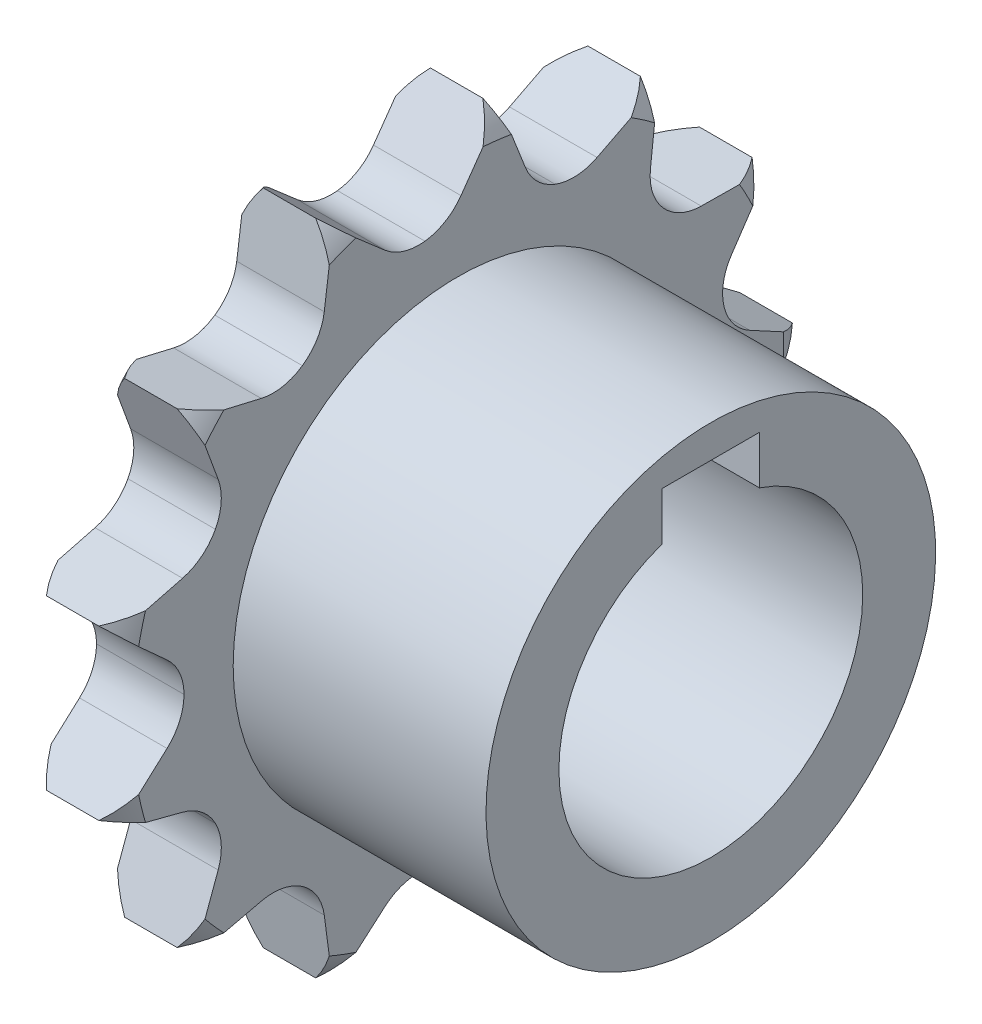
ISO-10303-21;
HEADER;
FILE_DESCRIPTION(('STEP AP214'),'2;1');
FILE_NAME('part.step','',(''),(''),'','','');
FILE_SCHEMA(('AUTOMOTIVE_DESIGN { 1 0 10303 214 1 1 1 1 }'));
ENDSEC;
DATA;
#1=APPLICATION_CONTEXT('core data for automotive mechanical design processes');
#2=APPLICATION_PROTOCOL_DEFINITION('international standard','automotive_design',2000,#1);
#3=PRODUCT_CONTEXT('',#1,'mechanical');
#4=PRODUCT('Part','Part','',(#3));
#5=PRODUCT_RELATED_PRODUCT_CATEGORY('part','',(#4));
#6=PRODUCT_DEFINITION_FORMATION('','',#4);
#7=PRODUCT_DEFINITION_CONTEXT('part definition',#1,'design');
#8=PRODUCT_DEFINITION('design','',#6,#7);
#9=PRODUCT_DEFINITION_SHAPE('','',#8);
#10=(LENGTH_UNIT() NAMED_UNIT(*) SI_UNIT(.MILLI.,.METRE.));
#11=(NAMED_UNIT(*) PLANE_ANGLE_UNIT() SI_UNIT($,.RADIAN.));
#12=(NAMED_UNIT(*) SI_UNIT($,.STERADIAN.) SOLID_ANGLE_UNIT());
#13=UNCERTAINTY_MEASURE_WITH_UNIT(LENGTH_MEASURE(1.E-05),#10,'distance_accuracy_value','');
#14=(GEOMETRIC_REPRESENTATION_CONTEXT(3) GLOBAL_UNCERTAINTY_ASSIGNED_CONTEXT((#13)) GLOBAL_UNIT_ASSIGNED_CONTEXT((#10,
#11,#12)) REPRESENTATION_CONTEXT('',''));
#15=CARTESIAN_POINT('',(0.,0.,0.));
#16=DIRECTION('',(0.,0.,1.));
#17=DIRECTION('',(1.,0.,0.));
#18=AXIS2_PLACEMENT_3D('',#15,#16,#17);
#19=CARTESIAN_POINT('',(0.,0.,0.));
#20=DIRECTION('',(1.,0.,0.));
#21=DIRECTION('',(0.,-1.,0.));
#22=AXIS2_PLACEMENT_3D('',#19,#20,#21);
#23=CYLINDRICAL_SURFACE('',#22,18.5);
#24=CARTESIAN_POINT('',(27.9999999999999,-2.22044604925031E-13,0.));
#25=DIRECTION('',(-1.,0.,0.));
#26=DIRECTION('',(0.,-1.,0.));
#27=AXIS2_PLACEMENT_3D('',#24,#25,#26);
#28=CIRCLE('',#27,18.5);
#29=CARTESIAN_POINT('',(27.9999999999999,-18.5000000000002,0.));
#30=VERTEX_POINT('',#29);
#31=EDGE_CURVE('E11',#30,#30,#28,.T.);
#32=ORIENTED_EDGE('',*,*,#31,.T.);
#33=EDGE_LOOP('',(#32));
#34=FACE_BOUND('',#33,.T.);
#35=CARTESIAN_POINT('',(7.19999999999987,-6.66133814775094E-13,0.));
#36=DIRECTION('',(-1.,0.,0.));
#37=DIRECTION('',(0.,0.,1.));
#38=AXIS2_PLACEMENT_3D('',#35,#36,#37);
#39=CIRCLE('',#38,18.5);
#40=CARTESIAN_POINT('',(7.19999999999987,-6.69214683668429E-13,18.5));
#41=VERTEX_POINT('',#40);
#42=EDGE_CURVE('E1886',#41,#41,#39,.F.);
#43=ORIENTED_EDGE('',*,*,#42,.T.);
#44=EDGE_LOOP('',(#43));
#45=FACE_BOUND('',#44,.T.);
#46=ADVANCED_FACE('F38',(#34,#45),#23,.T.);
#47=CARTESIAN_POINT('',(27.9999999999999,-2.22044604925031E-13,0.));
#48=DIRECTION('',(1.,0.,0.));
#49=DIRECTION('',(0.,0.,-1.));
#50=AXIS2_PLACEMENT_3D('',#47,#48,#49);
#51=PLANE('',#50);
#52=CARTESIAN_POINT('',(27.9999999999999,-2.22044604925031E-13,0.));
#53=DIRECTION('',(1.,0.,0.));
#54=DIRECTION('',(0.,0.,-1.));
#55=AXIS2_PLACEMENT_3D('',#52,#53,#54);
#56=CIRCLE('',#55,12.5);
#57=CARTESIAN_POINT('',(28.,11.8427192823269,4.));
#58=VERTEX_POINT('',#57);
#59=CARTESIAN_POINT('',(28.,11.8427192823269,-4.));
#60=VERTEX_POINT('',#59);
#61=EDGE_CURVE('E53',#58,#60,#56,.T.);
#62=ORIENTED_EDGE('',*,*,#61,.F.);
#63=DIRECTION('',(0.,-1.,0.));
#64=VECTOR('',#63,1.);
#65=CARTESIAN_POINT('',(28.,11.8427192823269,4.));
#66=LINE('',#65,#64);
#67=CARTESIAN_POINT('',(27.9999999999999,15.7999999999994,4.));
#68=VERTEX_POINT('',#67);
#69=EDGE_CURVE('E567',#68,#58,#66,.T.);
#70=ORIENTED_EDGE('',*,*,#69,.F.);
#71=DIRECTION('',(0.,0.,1.));
#72=VECTOR('',#71,1.);
#73=CARTESIAN_POINT('',(27.9999999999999,15.7999999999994,4.));
#74=LINE('',#73,#72);
#75=CARTESIAN_POINT('',(28.,15.7999999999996,-4.));
#76=VERTEX_POINT('',#75);
#77=EDGE_CURVE('E549',#76,#68,#74,.T.);
#78=ORIENTED_EDGE('',*,*,#77,.F.);
#79=DIRECTION('',(0.,1.,0.));
#80=VECTOR('',#79,1.);
#81=CARTESIAN_POINT('',(28.,11.8427192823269,-4.));
#82=LINE('',#81,#80);
#83=EDGE_CURVE('E559',#60,#76,#82,.T.);
#84=ORIENTED_EDGE('',*,*,#83,.F.);
#85=EDGE_LOOP('',(#62,#70,#78,#84));
#86=FACE_BOUND('',#85,.T.);
#87=ORIENTED_EDGE('',*,*,#31,.F.);
#88=EDGE_LOOP('',(#87));
#89=FACE_BOUND('',#88,.T.);
#90=ADVANCED_FACE('F564',(#86,#89),#51,.T.);
#91=CARTESIAN_POINT('',(0.,0.,0.));
#92=DIRECTION('',(-1.,0.,0.));
#93=DIRECTION('',(0.,0.,1.));
#94=AXIS2_PLACEMENT_3D('',#91,#92,#93);
#95=PLANE('',#94);
#96=CARTESIAN_POINT('',(0.,0.,0.));
#97=DIRECTION('',(1.,0.,0.));
#98=DIRECTION('',(0.,0.,-1.));
#99=AXIS2_PLACEMENT_3D('',#96,#97,#98);
#100=CIRCLE('',#99,12.5);
#101=CARTESIAN_POINT('',(-2.22044604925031E-13,11.8427192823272,4.));
#102=VERTEX_POINT('',#101);
#103=CARTESIAN_POINT('',(-1.66533453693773E-13,11.8427192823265,-4.));
#104=VERTEX_POINT('',#103);
#105=EDGE_CURVE('E573',#102,#104,#100,.T.);
#106=ORIENTED_EDGE('',*,*,#105,.T.);
#107=DIRECTION('',(0.,1.,0.));
#108=VECTOR('',#107,1.);
#109=CARTESIAN_POINT('',(-1.66533453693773E-13,11.8427192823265,-4.));
#110=LINE('',#109,#108);
#111=CARTESIAN_POINT('',(1.11022302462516E-13,15.7999999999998,-4.));
#112=VERTEX_POINT('',#111);
#113=EDGE_CURVE('E580',#104,#112,#110,.T.);
#114=ORIENTED_EDGE('',*,*,#113,.T.);
#115=DIRECTION('',(0.,0.,1.));
#116=VECTOR('',#115,1.);
#117=CARTESIAN_POINT('',(-1.66533453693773E-13,15.7999999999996,3.99999999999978));
#118=LINE('',#117,#116);
#119=CARTESIAN_POINT('',(-1.66533453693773E-13,15.7999999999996,3.99999999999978));
#120=VERTEX_POINT('',#119);
#121=EDGE_CURVE('E61',#112,#120,#118,.T.);
#122=ORIENTED_EDGE('',*,*,#121,.T.);
#123=DIRECTION('',(0.,-1.,0.));
#124=VECTOR('',#123,1.);
#125=CARTESIAN_POINT('',(-2.22044604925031E-13,11.8427192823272,4.));
#126=LINE('',#125,#124);
#127=EDGE_CURVE('E585',#120,#102,#126,.T.);
#128=ORIENTED_EDGE('',*,*,#127,.T.);
#129=EDGE_LOOP('',(#106,#114,#122,#128));
#130=FACE_BOUND('',#129,.T.);
#131=CARTESIAN_POINT('',(0.,0.,0.));
#132=DIRECTION('',(1.,0.,0.));
#133=DIRECTION('',(0.,-1.,0.));
#134=AXIS2_PLACEMENT_3D('',#131,#132,#133);
#135=CIRCLE('',#134,18.5);
#136=CARTESIAN_POINT('',(0.,-18.5,0.));
#137=VERTEX_POINT('',#136);
#138=EDGE_CURVE('E46',#137,#137,#135,.T.);
#139=ORIENTED_EDGE('',*,*,#138,.F.);
#140=EDGE_LOOP('',(#139));
#141=FACE_BOUND('',#140,.T.);
#142=ADVANCED_FACE('F1881',(#130,#141),#95,.T.);
#143=CARTESIAN_POINT('',(7.19999999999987,-2.22044604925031E-13,-28.95));
#144=DIRECTION('',(0.,-0.880174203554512,0.474650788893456));
#145=DIRECTION('',(0.,-0.474650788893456,-0.880174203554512));
#146=AXIS2_PLACEMENT_3D('',#143,#144,#145);
#147=PLANE('',#146);
#148=CARTESIAN_POINT('',(5.75999981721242,-1.0785439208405E-07,-28.9500002));
#149=CARTESIAN_POINT('',(5.91041132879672,0.0887360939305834,-28.7854511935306));
#150=CARTESIAN_POINT('',(6.05344123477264,0.180261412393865,-28.6157301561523));
#151=CARTESIAN_POINT('',(6.323744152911,0.367696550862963,-28.2681576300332));
#152=CARTESIAN_POINT('',(6.45109743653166,0.463580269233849,-28.0903545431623));
#153=CARTESIAN_POINT('',(6.69065008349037,0.659487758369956,-27.7270712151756));
#154=CARTESIAN_POINT('',(6.80285190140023,0.759510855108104,-27.5415922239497));
#155=CARTESIAN_POINT('',(7.01265185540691,0.963620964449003,-27.163098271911));
#156=CARTESIAN_POINT('',(7.11016813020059,1.06772695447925,-26.970048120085));
#157=CARTESIAN_POINT('',(7.20000019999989,1.17328547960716,-26.7743044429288));
#158=B_SPLINE_CURVE_WITH_KNOTS('',3,(#148,#149,#150,#151,#152,#153,#154,#155,#156,#157),
.UNSPECIFIED.,.F.,.F.,(4,2,2,2,4),(0.,0.719583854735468,1.43531459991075,2.15092925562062,
2.87039599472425),.UNSPECIFIED.);
#159=CARTESIAN_POINT('',(5.75999999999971,-6.66133814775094E-13,-28.95));
#160=VERTEX_POINT('',#159);
#161=CARTESIAN_POINT('',(7.19999999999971,1.17328524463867,-26.7743048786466));
#162=VERTEX_POINT('',#161);
#163=EDGE_CURVE('E1412',#160,#162,#158,.T.);
#164=ORIENTED_EDGE('',*,*,#163,.F.);
#165=DIRECTION('',(-1.,0.,0.));
#166=VECTOR('',#165,1.);
#167=CARTESIAN_POINT('',(7.19999999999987,-2.22044604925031E-13,-28.95));
#168=LINE('',#167,#166);
#169=CARTESIAN_POINT('',(1.43999999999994,-6.66133814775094E-13,-28.9500000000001));
#170=VERTEX_POINT('',#169);
#171=EDGE_CURVE('E1156',#160,#170,#168,.T.);
#172=ORIENTED_EDGE('',*,*,#171,.T.);
#173=CARTESIAN_POINT('',(-2.00000127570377E-07,1.17328547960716,-26.7743044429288));
#174=CARTESIAN_POINT('',(0.0898318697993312,1.06772695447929,-26.9700481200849));
#175=CARTESIAN_POINT('',(0.187348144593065,0.963620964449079,-27.1630982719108));
#176=CARTESIAN_POINT('',(0.39714809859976,0.75951085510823,-27.5415922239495));
#177=CARTESIAN_POINT('',(0.509349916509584,0.659487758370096,-27.7270712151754));
#178=CARTESIAN_POINT('',(0.748902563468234,0.463580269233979,-28.0903545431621));
#179=CARTESIAN_POINT('',(0.876255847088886,0.36769655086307,-28.2681576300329));
#180=CARTESIAN_POINT('',(1.14655876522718,0.180261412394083,-28.6157301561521));
#181=CARTESIAN_POINT('',(1.28958867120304,0.0887360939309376,-28.7854511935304));
#182=CARTESIAN_POINT('',(1.44000018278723,-1.07853725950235E-07,-28.9500002));
#183=B_SPLINE_CURVE_WITH_KNOTS('',3,(#173,#174,#175,#176,#177,#178,#179,#180,#181,#182),
.UNSPECIFIED.,.F.,.F.,(4,2,2,2,4),(0.,0.719466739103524,1.4350813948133,2.1508121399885,
2.87039599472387),.UNSPECIFIED.);
#184=CARTESIAN_POINT('',(0.,1.173285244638,-26.7743048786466));
#185=VERTEX_POINT('',#184);
#186=EDGE_CURVE('E1387',#185,#170,#183,.T.);
#187=ORIENTED_EDGE('',*,*,#186,.F.);
#188=DIRECTION('',(0.,0.474650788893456,0.880174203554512));
#189=VECTOR('',#188,1.);
#190=CARTESIAN_POINT('',(0.,0.,-28.95));
#191=LINE('',#190,#189);
#192=CARTESIAN_POINT('',(-1.66533453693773E-13,2.66851856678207,-24.0016016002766));
#193=VERTEX_POINT('',#192);
#194=EDGE_CURVE('E1126',#185,#193,#191,.T.);
#195=ORIENTED_EDGE('',*,*,#194,.T.);
#196=DIRECTION('',(-1.,0.,0.));
#197=VECTOR('',#196,1.);
#198=CARTESIAN_POINT('',(7.19999999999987,2.66851856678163,-24.0016016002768));
#199=LINE('',#198,#197);
#200=CARTESIAN_POINT('',(7.19999999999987,2.66851856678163,-24.0016016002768));
#201=VERTEX_POINT('',#200);
#202=EDGE_CURVE('E1152',#201,#193,#199,.T.);
#203=ORIENTED_EDGE('',*,*,#202,.F.);
#204=DIRECTION('',(0.,0.474650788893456,0.880174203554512));
#205=VECTOR('',#204,1.);
#206=CARTESIAN_POINT('',(7.19999999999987,-2.22044604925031E-13,-28.95));
#207=LINE('',#206,#205);
#208=EDGE_CURVE('E1141',#162,#201,#207,.T.);
#209=ORIENTED_EDGE('',*,*,#208,.F.);
#210=EDGE_LOOP('',(#164,#172,#187,#195,#203,#209));
#211=FACE_BOUND('',#210,.T.);
#212=ADVANCED_FACE('F1397',(#211),#147,.F.);
#213=CARTESIAN_POINT('',(7.19999999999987,-2.22044604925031E-13,-28.95));
#214=DIRECTION('',(0.,-0.880174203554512,-0.474650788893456));
#215=DIRECTION('',(0.,0.474650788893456,-0.880174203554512));
#216=AXIS2_PLACEMENT_3D('',#213,#214,#215);
#217=PLANE('',#216);
#218=ORIENTED_EDGE('',*,*,#171,.F.);
#219=CARTESIAN_POINT('',(5.75999981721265,1.0785394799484E-07,-28.9500002));
#220=CARTESIAN_POINT('',(5.91041132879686,-0.08873609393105,-28.7854511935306));
#221=CARTESIAN_POINT('',(6.05344123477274,-0.180261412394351,-28.6157301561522));
#222=CARTESIAN_POINT('',(6.32374415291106,-0.367696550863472,-28.2681576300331));
#223=CARTESIAN_POINT('',(6.45109743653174,-0.463580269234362,-28.0903545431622));
#224=CARTESIAN_POINT('',(6.69065008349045,-0.659487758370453,-27.7270712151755));
#225=CARTESIAN_POINT('',(6.80285190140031,-0.75951085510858,-27.5415922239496));
#226=CARTESIAN_POINT('',(7.01265185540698,-0.963620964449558,-27.1630982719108));
#227=CARTESIAN_POINT('',(7.11016813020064,-1.06772695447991,-26.9700481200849));
#228=CARTESIAN_POINT('',(7.20000019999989,-1.17328547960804,-26.7743044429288));
#229=B_SPLINE_CURVE_WITH_KNOTS('',3,(#219,#220,#221,#222,#223,#224,#225,#226,#227,#228),
.UNSPECIFIED.,.F.,.F.,(4,2,2,2,4),(0.,0.719583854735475,1.43531459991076,2.15092925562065,
2.87039599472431),.UNSPECIFIED.);
#230=CARTESIAN_POINT('',(7.19999999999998,-1.17328524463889,-26.7743048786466));
#231=VERTEX_POINT('',#230);
#232=EDGE_CURVE('E1404',#160,#231,#229,.T.);
#233=ORIENTED_EDGE('',*,*,#232,.T.);
#234=DIRECTION('',(0.,-0.474650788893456,0.880174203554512));
#235=VECTOR('',#234,1.);
#236=CARTESIAN_POINT('',(7.19999999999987,-2.22044604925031E-13,-28.95));
#237=LINE('',#236,#235);
#238=CARTESIAN_POINT('',(7.19999999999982,-2.6685185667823,-24.0016016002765));
#239=VERTEX_POINT('',#238);
#240=EDGE_CURVE('E1137',#231,#239,#237,.T.);
#241=ORIENTED_EDGE('',*,*,#240,.T.);
#242=DIRECTION('',(-1.,0.,0.));
#243=VECTOR('',#242,1.);
#244=CARTESIAN_POINT('',(7.19999999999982,-2.6685185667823,-24.0016016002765));
#245=LINE('',#244,#243);
#246=CARTESIAN_POINT('',(0.,-2.66851856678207,-24.0016016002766));
#247=VERTEX_POINT('',#246);
#248=EDGE_CURVE('E1160',#239,#247,#245,.T.);
#249=ORIENTED_EDGE('',*,*,#248,.T.);
#250=DIRECTION('',(0.,-0.474650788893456,0.880174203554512));
#251=VECTOR('',#250,1.);
#252=CARTESIAN_POINT('',(0.,0.,-28.95));
#253=LINE('',#252,#251);
#254=CARTESIAN_POINT('',(0.,-1.17328524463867,-26.7743048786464));
#255=VERTEX_POINT('',#254);
#256=EDGE_CURVE('E1123',#255,#247,#253,.T.);
#257=ORIENTED_EDGE('',*,*,#256,.F.);
#258=CARTESIAN_POINT('',(-2.00000127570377E-07,-1.17328547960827,-26.7743044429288));
#259=CARTESIAN_POINT('',(0.089831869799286,-1.06772695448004,-26.9700481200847));
#260=CARTESIAN_POINT('',(0.187348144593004,-0.963620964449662,-27.1630982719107));
#261=CARTESIAN_POINT('',(0.397148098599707,-0.759510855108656,-27.5415922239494));
#262=CARTESIAN_POINT('',(0.509349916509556,-0.659487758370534,-27.7270712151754));
#263=CARTESIAN_POINT('',(0.748902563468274,-0.463580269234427,-28.0903545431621));
#264=CARTESIAN_POINT('',(0.876255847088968,-0.367696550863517,-28.268157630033));
#265=CARTESIAN_POINT('',(1.14655876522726,-0.180261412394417,-28.6157301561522));
#266=CARTESIAN_POINT('',(1.28958867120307,-0.0887360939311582,-28.7854511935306));
#267=CARTESIAN_POINT('',(1.44000018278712,1.07853725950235E-07,-28.9500002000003));
#268=B_SPLINE_CURVE_WITH_KNOTS('',3,(#258,#259,#260,#261,#262,#263,#264,#265,#266,#267),
.UNSPECIFIED.,.F.,.F.,(4,2,2,2,4),(0.,0.719466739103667,1.4350813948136,2.15081213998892,
2.87039599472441),.UNSPECIFIED.);
#269=EDGE_CURVE('E1380',#255,#170,#268,.T.);
#270=ORIENTED_EDGE('',*,*,#269,.T.);
#271=EDGE_LOOP('',(#218,#233,#241,#249,#257,#270));
#272=FACE_BOUND('',#271,.T.);
#273=ADVANCED_FACE('F1392',(#272),#217,.T.);
#274=CARTESIAN_POINT('',(7.20000000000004,13.4537358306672,-25.6339519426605));
#275=DIRECTION('',(0.,-0.999936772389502,0.0112450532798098));
#276=DIRECTION('',(0.,-0.0112450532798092,-0.999936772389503));
#277=AXIS2_PLACEMENT_3D('',#274,#275,#276);
#278=PLANE('',#277);
#279=CARTESIAN_POINT('',(5.75999983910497,13.4537358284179,-25.6339521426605));
#280=CARTESIAN_POINT('',(5.9104113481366,13.4558380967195,-25.4470134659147));
#281=CARTESIAN_POINT('',(6.05344125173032,13.4580064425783,-25.2541990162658));
#282=CARTESIAN_POINT('',(6.3237441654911,13.4624470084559,-24.85933338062));
#283=CARTESIAN_POINT('',(6.4510974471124,13.4647186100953,-24.657337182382));
#284=CARTESIAN_POINT('',(6.69065009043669,13.4693598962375,-24.2446230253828));
#285=CARTESIAN_POINT('',(6.80285190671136,13.4717295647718,-24.0339064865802));
#286=CARTESIAN_POINT('',(7.0126518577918,13.4765651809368,-23.6039120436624));
#287=CARTESIAN_POINT('',(7.11016813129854,13.4790315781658,-23.3845941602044));
#288=CARTESIAN_POINT('',(7.20000020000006,13.4815323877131,-23.1622162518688));
#289=B_SPLINE_CURVE_WITH_KNOTS('',3,(#279,#280,#281,#282,#283,#284,#285,#286,#287,#288),
.UNSPECIFIED.,.F.,.F.,(4,2,2,2,4),(0.,0.719583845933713,1.43531458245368,2.15092922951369,
2.8703959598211),.UNSPECIFIED.);
#290=CARTESIAN_POINT('',(5.75999999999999,13.453735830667,-25.6339519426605));
#291=VERTEX_POINT('',#290);
#292=CARTESIAN_POINT('',(7.19999999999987,13.4815323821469,-23.1622167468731));
#293=VERTEX_POINT('',#292);
#294=EDGE_CURVE('E1413',#291,#293,#289,.T.);
#295=ORIENTED_EDGE('',*,*,#294,.F.);
#296=DIRECTION('',(-1.,0.,0.));
#297=VECTOR('',#296,1.);
#298=CARTESIAN_POINT('',(7.20000000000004,13.4537358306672,-25.6339519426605));
#299=LINE('',#298,#297);
#300=CARTESIAN_POINT('',(1.43999999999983,13.453735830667,-25.6339519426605));
#301=VERTEX_POINT('',#300);
#302=EDGE_CURVE('E1113',#291,#301,#299,.T.);
#303=ORIENTED_EDGE('',*,*,#302,.T.);
#304=CARTESIAN_POINT('',(-2.00000238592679E-07,13.4815323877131,-23.1622162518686));
#305=CARTESIAN_POINT('',(0.0898318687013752,13.4790315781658,-23.3845941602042));
#306=CARTESIAN_POINT('',(0.187348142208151,13.4765651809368,-23.6039120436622));
#307=CARTESIAN_POINT('',(0.397148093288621,13.4717295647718,-24.0339064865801));
#308=CARTESIAN_POINT('',(0.509349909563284,13.4693598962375,-24.2446230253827));
#309=CARTESIAN_POINT('',(0.748902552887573,13.4647186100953,-24.6573371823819));
#310=CARTESIAN_POINT('',(0.876255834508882,13.4624470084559,-24.85933338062));
#311=CARTESIAN_POINT('',(1.14655874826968,13.4580064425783,-25.2541990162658));
#312=CARTESIAN_POINT('',(1.28958865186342,13.4558380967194,-25.4470134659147));
#313=CARTESIAN_POINT('',(1.44000016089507,13.4537358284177,-25.6339521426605));
#314=B_SPLINE_CURVE_WITH_KNOTS('',3,(#304,#305,#306,#307,#308,#309,#310,#311,#312,#313),
.UNSPECIFIED.,.F.,.F.,(4,2,2,2,4),(0.,0.719466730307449,1.43508137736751,2.15081211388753,
2.87039595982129),.UNSPECIFIED.);
#315=CARTESIAN_POINT('',(-1.11022302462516E-13,13.4815323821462,-23.1622167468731));
#316=VERTEX_POINT('',#315);
#317=EDGE_CURVE('E1374',#316,#301,#314,.T.);
#318=ORIENTED_EDGE('',*,*,#317,.F.);
#319=DIRECTION('',(0.,0.0112450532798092,0.999936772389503));
#320=VECTOR('',#319,1.);
#321=CARTESIAN_POINT('',(0.,13.4537358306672,-25.6339519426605));
#322=LINE('',#321,#320);
#323=CARTESIAN_POINT('',(-1.66533453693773E-13,13.516956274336,-20.01224034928));
#324=VERTEX_POINT('',#323);
#325=EDGE_CURVE('E1083',#316,#324,#322,.T.);
#326=ORIENTED_EDGE('',*,*,#325,.T.);
#327=DIRECTION('',(-1.,0.,0.));
#328=VECTOR('',#327,1.);
#329=CARTESIAN_POINT('',(7.19999999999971,13.516956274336,-20.0122403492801));
#330=LINE('',#329,#328);
#331=CARTESIAN_POINT('',(7.19999999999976,13.516956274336,-20.0122403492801));
#332=VERTEX_POINT('',#331);
#333=EDGE_CURVE('E1109',#332,#324,#330,.T.);
#334=ORIENTED_EDGE('',*,*,#333,.F.);
#335=DIRECTION('',(0.,0.0112450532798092,0.999936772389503));
#336=VECTOR('',#335,1.);
#337=CARTESIAN_POINT('',(7.20000000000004,13.4537358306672,-25.6339519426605));
#338=LINE('',#337,#336);
#339=EDGE_CURVE('E1098',#293,#332,#338,.T.);
#340=ORIENTED_EDGE('',*,*,#339,.F.);
#341=EDGE_LOOP('',(#295,#303,#318,#326,#334,#340));
#342=FACE_BOUND('',#341,.T.);
#343=ADVANCED_FACE('F1396',(#342),#278,.F.);
#344=CARTESIAN_POINT('',(7.20000000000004,13.4537358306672,-25.6339519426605));
#345=DIRECTION('',(0.,-0.558774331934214,-0.829319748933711));
#346=DIRECTION('',(0.,0.829319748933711,-0.558774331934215));
#347=AXIS2_PLACEMENT_3D('',#344,#345,#346);
#348=PLANE('',#347);
#349=ORIENTED_EDGE('',*,*,#302,.F.);
#350=CARTESIAN_POINT('',(5.75999979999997,13.4537360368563,-25.6339520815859));
#351=CARTESIAN_POINT('',(5.9104113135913,13.2986942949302,-25.5294889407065));
#352=CARTESIAN_POINT('',(6.05344122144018,13.1387793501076,-25.421742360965));
#353=CARTESIAN_POINT('',(6.32374414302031,12.8112887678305,-25.2010876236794));
#354=CARTESIAN_POINT('',(6.45109742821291,12.6437587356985,-25.0882101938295));
#355=CARTESIAN_POINT('',(6.69065007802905,12.3014650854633,-24.8575815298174));
#356=CARTESIAN_POINT('',(6.80285189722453,12.1267026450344,-24.7398310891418));
#357=CARTESIAN_POINT('',(7.0126518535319,11.7700772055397,-24.4995460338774));
#358=CARTESIAN_POINT('',(7.11016812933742,11.5881810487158,-24.3769890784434));
#359=CARTESIAN_POINT('',(7.20000019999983,11.4037469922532,-24.2527221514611));
#360=B_SPLINE_CURVE_WITH_KNOTS('',3,(#350,#351,#352,#353,#354,#355,#356,#357,#358,#359),
.UNSPECIFIED.,.F.,.F.,(4,2,2,2,4),(0.,0.719583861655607,1.43531461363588,2.15092927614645,
2.87039602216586),.UNSPECIFIED.);
#361=CARTESIAN_POINT('',(7.2000000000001,11.4037474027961,-24.2527224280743));
#362=VERTEX_POINT('',#361);
#363=EDGE_CURVE('E1849',#291,#362,#360,.T.);
#364=ORIENTED_EDGE('',*,*,#363,.T.);
#365=DIRECTION('',(0.,-0.829319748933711,0.558774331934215));
#366=VECTOR('',#365,1.);
#367=CARTESIAN_POINT('',(7.20000000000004,13.4537358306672,-25.6339519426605));
#368=LINE('',#367,#366);
#369=CARTESIAN_POINT('',(7.19999999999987,8.79124458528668,-22.4924851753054));
#370=VERTEX_POINT('',#369);
#371=EDGE_CURVE('E1094',#362,#370,#368,.T.);
#372=ORIENTED_EDGE('',*,*,#371,.T.);
#373=DIRECTION('',(-1.,0.,0.));
#374=VECTOR('',#373,1.);
#375=CARTESIAN_POINT('',(7.19999999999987,8.79124458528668,-22.4924851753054));
#376=LINE('',#375,#374);
#377=CARTESIAN_POINT('',(0.,8.79124458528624,-22.4924851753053));
#378=VERTEX_POINT('',#377);
#379=EDGE_CURVE('E1093',#370,#378,#376,.T.);
#380=ORIENTED_EDGE('',*,*,#379,.T.);
#381=DIRECTION('',(0.,-0.829319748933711,0.558774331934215));
#382=VECTOR('',#381,1.);
#383=CARTESIAN_POINT('',(0.,13.4537358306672,-25.6339519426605));
#384=LINE('',#383,#382);
#385=CARTESIAN_POINT('',(1.66533453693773E-13,11.4037474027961,-24.2527224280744));
#386=VERTEX_POINT('',#385);
#387=EDGE_CURVE('E1080',#386,#378,#384,.T.);
#388=ORIENTED_EDGE('',*,*,#387,.F.);
#389=CARTESIAN_POINT('',(-1.99999850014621E-07,11.4037469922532,-24.252722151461));
#390=CARTESIAN_POINT('',(0.0898318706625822,11.5881810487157,-24.3769890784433));
#391=CARTESIAN_POINT('',(0.187348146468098,11.7700772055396,-24.4995460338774));
#392=CARTESIAN_POINT('',(0.397148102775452,12.1267026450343,-24.7398310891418));
#393=CARTESIAN_POINT('',(0.509349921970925,12.3014650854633,-24.8575815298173));
#394=CARTESIAN_POINT('',(0.74890257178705,12.6437587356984,-25.0882101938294));
#395=CARTESIAN_POINT('',(0.876255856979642,12.8112887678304,-25.2010876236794));
#396=CARTESIAN_POINT('',(1.14655877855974,13.1387793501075,-25.4217423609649));
#397=CARTESIAN_POINT('',(1.28958868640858,13.2986942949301,-25.5294889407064));
#398=CARTESIAN_POINT('',(1.44000019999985,13.4537360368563,-25.6339520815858));
#399=B_SPLINE_CURVE_WITH_KNOTS('',3,(#389,#390,#391,#392,#393,#394,#395,#396,#397,#398),
.UNSPECIFIED.,.F.,.F.,(4,2,2,2,4),(0.,0.719466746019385,1.43508140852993,2.15081216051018,
2.87039602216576),.UNSPECIFIED.);
#400=EDGE_CURVE('E1368',#386,#301,#399,.T.);
#401=ORIENTED_EDGE('',*,*,#400,.T.);
#402=EDGE_LOOP('',(#349,#364,#372,#380,#388,#401));
#403=FACE_BOUND('',#402,.T.);
#404=ADVANCED_FACE('F1855',(#403),#348,.T.);
#405=CARTESIAN_POINT('',(7.19999999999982,23.8253829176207,-16.445474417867));
#406=DIRECTION('',(0.,-0.890625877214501,-0.454736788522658));
#407=DIRECTION('',(0.,0.454736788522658,-0.890625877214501));
#408=AXIS2_PLACEMENT_3D('',#405,#406,#407);
#409=PLANE('',#408);
#410=CARTESIAN_POINT('',(5.75999981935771,23.8253830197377,-16.445474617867));
#411=CARTESIAN_POINT('',(5.91041133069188,23.7403697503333,-16.2789716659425));
#412=CARTESIAN_POINT('',(6.05344123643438,23.6526843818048,-16.1072352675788));
#413=CARTESIAN_POINT('',(6.32374415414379,23.4731130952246,-15.7555354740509));
#414=CARTESIAN_POINT('',(6.45109743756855,23.3812521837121,-15.5756210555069));
#415=CARTESIAN_POINT('',(6.69065008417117,23.1935640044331,-15.2080239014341));
#416=CARTESIAN_POINT('',(6.80285190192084,23.0977373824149,-15.020342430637));
#417=CARTESIAN_POINT('',(7.01265185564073,22.9021907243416,-14.6373540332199));
#418=CARTESIAN_POINT('',(7.1101681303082,22.802452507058,-14.4420114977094));
#419=CARTESIAN_POINT('',(7.20000019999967,22.7013226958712,-14.2439434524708));
#420=B_SPLINE_CURVE_WITH_KNOTS('',3,(#410,#411,#412,#413,#414,#415,#416,#417,#418,#419),
.UNSPECIFIED.,.F.,.F.,(4,2,2,2,4),(0.,0.719583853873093,1.43531459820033,2.15092925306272,
2.87039599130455),.UNSPECIFIED.);
#421=CARTESIAN_POINT('',(5.75999999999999,23.8253829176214,-16.445474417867));
#422=VERTEX_POINT('',#421);
#423=CARTESIAN_POINT('',(7.19999999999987,22.7013229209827,-14.2439438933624));
#424=VERTEX_POINT('',#423);
#425=EDGE_CURVE('E1844',#422,#424,#420,.T.);
#426=ORIENTED_EDGE('',*,*,#425,.F.);
#427=DIRECTION('',(-1.,0.,0.));
#428=VECTOR('',#427,1.);
#429=CARTESIAN_POINT('',(7.19999999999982,23.8253829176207,-16.445474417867));
#430=LINE('',#429,#428);
#431=CARTESIAN_POINT('',(1.44000000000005,23.8253829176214,-16.445474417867));
#432=VERTEX_POINT('',#431);
#433=EDGE_CURVE('E1069',#422,#432,#430,.T.);
#434=ORIENTED_EDGE('',*,*,#433,.T.);
#435=CARTESIAN_POINT('',(-2.00000127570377E-07,22.7013226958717,-14.2439434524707));
#436=CARTESIAN_POINT('',(0.0898318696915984,22.8024525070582,-14.4420114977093));
#437=CARTESIAN_POINT('',(0.187348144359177,22.9021907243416,-14.6373540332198));
#438=CARTESIAN_POINT('',(0.39714809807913,23.0977373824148,-15.0203424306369));
#439=CARTESIAN_POINT('',(0.509349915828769,23.1935640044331,-15.208023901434));
#440=CARTESIAN_POINT('',(0.748902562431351,23.3812521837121,-15.5756210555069));
#441=CARTESIAN_POINT('',(0.876255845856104,23.4731130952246,-15.7555354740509));
#442=CARTESIAN_POINT('',(1.14655876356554,23.6526843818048,-16.1072352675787));
#443=CARTESIAN_POINT('',(1.28958866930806,23.7403697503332,-16.2789716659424));
#444=CARTESIAN_POINT('',(1.44000018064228,23.8253830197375,-16.445474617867));
#445=B_SPLINE_CURVE_WITH_KNOTS('',3,(#435,#436,#437,#438,#439,#440,#441,#442,#443,#444),
.UNSPECIFIED.,.F.,.F.,(4,2,2,2,4),(0.,0.719466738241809,1.43508139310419,2.15081213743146,
2.87039599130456),.UNSPECIFIED.);
#446=CARTESIAN_POINT('',(-2.77555756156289E-13,22.7013229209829,-14.2439438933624));
#447=VERTEX_POINT('',#446);
#448=EDGE_CURVE('E1361',#447,#432,#445,.T.);
#449=ORIENTED_EDGE('',*,*,#448,.F.);
#450=DIRECTION('',(0.,-0.454736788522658,0.890625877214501));
#451=VECTOR('',#450,1.);
#452=CARTESIAN_POINT('',(-1.11022302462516E-13,23.8253829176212,-16.445474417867));
#453=LINE('',#452,#451);
#454=CARTESIAN_POINT('',(-2.22044604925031E-13,21.2688221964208,-11.4383160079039));
#455=VERTEX_POINT('',#454);
#456=EDGE_CURVE('E1039',#447,#455,#453,.T.);
#457=ORIENTED_EDGE('',*,*,#456,.T.);
#458=DIRECTION('',(-1.,0.,0.));
#459=VECTOR('',#458,1.);
#460=CARTESIAN_POINT('',(7.19999999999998,21.2688221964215,-11.4383160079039));
#461=LINE('',#460,#459);
#462=CARTESIAN_POINT('',(7.19999999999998,21.2688221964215,-11.4383160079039));
#463=VERTEX_POINT('',#462);
#464=EDGE_CURVE('E1065',#463,#455,#461,.T.);
#465=ORIENTED_EDGE('',*,*,#464,.F.);
#466=DIRECTION('',(0.,-0.454736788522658,0.890625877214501));
#467=VECTOR('',#466,1.);
#468=CARTESIAN_POINT('',(7.19999999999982,23.8253829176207,-16.445474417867));
#469=LINE('',#468,#467);
#470=EDGE_CURVE('E1054',#424,#463,#469,.T.);
#471=ORIENTED_EDGE('',*,*,#470,.F.);
#472=EDGE_LOOP('',(#426,#434,#449,#457,#465,#471));
#473=FACE_BOUND('',#472,.T.);
#474=ADVANCED_FACE('F1833',(#473),#409,.F.);
#475=CARTESIAN_POINT('',(7.19999999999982,23.8253829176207,-16.445474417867));
#476=DIRECTION('',(0.,-0.109365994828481,-0.994001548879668));
#477=DIRECTION('',(0.,0.994001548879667,-0.109365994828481));
#478=AXIS2_PLACEMENT_3D('',#475,#476,#477);
#479=PLANE('',#478);
#480=ORIENTED_EDGE('',*,*,#433,.F.);
#481=CARTESIAN_POINT('',(5.7599998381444,23.8253831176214,-16.4454744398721));
#482=CARTESIAN_POINT('',(5.910411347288,23.6395540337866,-16.4250284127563));
#483=CARTESIAN_POINT('',(6.05344125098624,23.4478840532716,-16.4039397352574));
#484=CARTESIAN_POINT('',(6.3237441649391,23.0553621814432,-16.360752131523));
#485=CARTESIAN_POINT('',(6.45109744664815,22.8545649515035,-16.3386592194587));
#486=CARTESIAN_POINT('',(6.69065009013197,22.4443004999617,-16.2935194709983));
#487=CARTESIAN_POINT('',(6.80285190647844,22.2348346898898,-16.2704727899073));
#488=CARTESIAN_POINT('',(7.01265185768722,21.8073925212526,-16.2234430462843));
#489=CARTESIAN_POINT('',(7.11016813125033,21.5893764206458,-16.1994556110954));
#490=CARTESIAN_POINT('',(7.20000019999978,21.3683184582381,-16.1751334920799));
#491=B_SPLINE_CURVE_WITH_KNOTS('',3,(#481,#482,#483,#484,#485,#486,#487,#488,#489,#490),
.UNSPECIFIED.,.F.,.F.,(4,2,2,2,4),(0.,0.719583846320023,1.43531458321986,2.15092923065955,
2.87039596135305),.UNSPECIFIED.);
#492=CARTESIAN_POINT('',(7.19999999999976,21.3683189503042,-16.1751335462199));
#493=VERTEX_POINT('',#492);
#494=EDGE_CURVE('E1526',#422,#493,#491,.T.);
#495=ORIENTED_EDGE('',*,*,#494,.T.);
#496=DIRECTION('',(0.,-0.994001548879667,0.109365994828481));
#497=VECTOR('',#496,1.);
#498=CARTESIAN_POINT('',(7.19999999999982,23.8253829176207,-16.445474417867));
#499=LINE('',#498,#497);
#500=CARTESIAN_POINT('',(7.19999999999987,18.2370395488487,-15.8306114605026));
#501=VERTEX_POINT('',#500);
#502=EDGE_CURVE('E1050',#493,#501,#499,.T.);
#503=ORIENTED_EDGE('',*,*,#502,.T.);
#504=DIRECTION('',(-1.,0.,0.));
#505=VECTOR('',#504,1.);
#506=CARTESIAN_POINT('',(7.19999999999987,18.2370395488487,-15.8306114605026));
#507=LINE('',#506,#505);
#508=CARTESIAN_POINT('',(-1.66533453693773E-13,18.2370395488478,-15.8306114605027));
#509=VERTEX_POINT('',#508);
#510=EDGE_CURVE('E1049',#501,#509,#507,.T.);
#511=ORIENTED_EDGE('',*,*,#510,.T.);
#512=DIRECTION('',(0.,-0.994001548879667,0.109365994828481));
#513=VECTOR('',#512,1.);
#514=CARTESIAN_POINT('',(-1.11022302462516E-13,23.8253829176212,-16.445474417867));
#515=LINE('',#514,#513);
#516=CARTESIAN_POINT('',(-1.11022302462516E-13,21.3683189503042,-16.1751335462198));
#517=VERTEX_POINT('',#516);
#518=EDGE_CURVE('E1036',#517,#509,#515,.T.);
#519=ORIENTED_EDGE('',*,*,#518,.F.);
#520=CARTESIAN_POINT('',(-2.00000127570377E-07,21.3683184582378,-16.1751334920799));
#521=CARTESIAN_POINT('',(0.0898318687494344,21.5893764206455,-16.1994556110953));
#522=CARTESIAN_POINT('',(0.187348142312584,21.8073925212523,-16.2234430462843));
#523=CARTESIAN_POINT('',(0.397148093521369,22.2348346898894,-16.2704727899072));
#524=CARTESIAN_POINT('',(0.50934990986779,22.4443004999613,-16.2935194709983));
#525=CARTESIAN_POINT('',(0.748902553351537,22.8545649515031,-16.3386592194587));
#526=CARTESIAN_POINT('',(0.876255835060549,23.0553621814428,-16.3607521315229));
#527=CARTESIAN_POINT('',(1.14655874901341,23.4478840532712,-16.4039397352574));
#528=CARTESIAN_POINT('',(1.28958865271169,23.6395540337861,-16.4250284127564));
#529=CARTESIAN_POINT('',(1.44000016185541,23.8253831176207,-16.4454744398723));
#530=B_SPLINE_CURVE_WITH_KNOTS('',3,(#520,#521,#522,#523,#524,#525,#526,#527,#528,#529),
.UNSPECIFIED.,.F.,.F.,(4,2,2,2,4),(0.,0.719466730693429,1.43508137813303,2.15081211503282,
2.87039596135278),.UNSPECIFIED.);
#531=EDGE_CURVE('E1354',#517,#432,#530,.T.);
#532=ORIENTED_EDGE('',*,*,#531,.T.);
#533=EDGE_LOOP('',(#480,#495,#503,#511,#519,#532));
#534=FACE_BOUND('',#533,.T.);
#535=ADVANCED_FACE('F1823',(#534),#479,.T.);
#536=CARTESIAN_POINT('',(7.19999999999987,28.7389219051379,-3.4895368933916));
#537=DIRECTION('',(0.,-0.577283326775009,-0.816543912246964));
#538=DIRECTION('',(0.,0.816543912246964,-0.57728332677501));
#539=AXIS2_PLACEMENT_3D('',#536,#537,#538);
#540=PLANE('',#539);
#541=CARTESIAN_POINT('',(5.75999979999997,28.738922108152,-3.48953703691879));
#542=CARTESIAN_POINT('',(5.91041131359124,28.5862688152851,-3.38161363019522));
#543=CARTESIAN_POINT('',(6.0534412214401,28.4288173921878,-3.27029802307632));
#544=CARTESIAN_POINT('',(6.32374414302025,28.1063718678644,-3.04233425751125));
#545=CARTESIAN_POINT('',(6.45109742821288,27.9414226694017,-2.92571784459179));
#546=CARTESIAN_POINT('',(6.69065007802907,27.6044021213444,-2.68744977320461));
#547=CARTESIAN_POINT('',(6.80285189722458,27.4323319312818,-2.56579893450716));
#548=CARTESIAN_POINT('',(7.01265185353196,27.0812003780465,-2.31755461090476));
#549=CARTESIAN_POINT('',(7.11016812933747,26.9021063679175,-2.19093804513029));
#550=CARTESIAN_POINT('',(7.20000019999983,26.7205135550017,-2.06255486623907));
#551=B_SPLINE_CURVE_WITH_KNOTS('',3,(#541,#542,#543,#544,#545,#546,#547,#548,#549,#550),
.UNSPECIFIED.,.F.,.F.,(4,2,2,2,4),(0.,0.719583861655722,1.43531461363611,2.15092927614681,
2.87039602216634),.UNSPECIFIED.);
#552=CARTESIAN_POINT('',(5.7600000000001,28.7389219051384,-3.48953689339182));
#553=VERTEX_POINT('',#552);
#554=CARTESIAN_POINT('',(7.20000000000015,26.7205139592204,-2.06255515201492));
#555=VERTEX_POINT('',#554);
#556=EDGE_CURVE('E1522',#553,#555,#551,.T.);
#557=ORIENTED_EDGE('',*,*,#556,.F.);
#558=DIRECTION('',(-1.,0.,0.));
#559=VECTOR('',#558,1.);
#560=CARTESIAN_POINT('',(7.19999999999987,28.7389219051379,-3.4895368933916));
#561=LINE('',#560,#559);
#562=CARTESIAN_POINT('',(1.44,28.7389219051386,-3.4895368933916));
#563=VERTEX_POINT('',#562);
#564=EDGE_CURVE('E1025',#553,#563,#561,.T.);
#565=ORIENTED_EDGE('',*,*,#564,.T.);
#566=CARTESIAN_POINT('',(-2.00000127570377E-07,26.7205135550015,-2.06255486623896));
#567=CARTESIAN_POINT('',(0.0898318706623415,26.9021063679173,-2.19093804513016));
#568=CARTESIAN_POINT('',(0.187348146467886,27.0812003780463,-2.31755461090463));
#569=CARTESIAN_POINT('',(0.397148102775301,27.4323319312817,-2.56579893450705));
#570=CARTESIAN_POINT('',(0.509349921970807,27.6044021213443,-2.68744977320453));
#571=CARTESIAN_POINT('',(0.748902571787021,27.9414226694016,-2.92571784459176));
#572=CARTESIAN_POINT('',(0.876255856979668,28.1063718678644,-3.04233425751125));
#573=CARTESIAN_POINT('',(1.14655877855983,28.4288173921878,-3.27029802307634));
#574=CARTESIAN_POINT('',(1.28958868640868,28.5862688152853,-3.38161363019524));
#575=CARTESIAN_POINT('',(1.4400001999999,28.7389221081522,-3.48953703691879));
#576=B_SPLINE_CURVE_WITH_KNOTS('',3,(#566,#567,#568,#569,#570,#571,#572,#573,#574,#575),
.UNSPECIFIED.,.F.,.F.,(4,2,2,2,4),(0.,0.719466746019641,1.43508140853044,2.15081216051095,
2.87039602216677),.UNSPECIFIED.);
#577=CARTESIAN_POINT('',(-1.11022302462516E-13,26.7205139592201,-2.06255515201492));
#578=VERTEX_POINT('',#577);
#579=EDGE_CURVE('E1347',#578,#563,#576,.T.);
#580=ORIENTED_EDGE('',*,*,#579,.F.);
#581=DIRECTION('',(0.,-0.816543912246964,0.57728332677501));
#582=VECTOR('',#581,1.);
#583=CARTESIAN_POINT('',(-2.22044604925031E-13,28.7389219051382,-3.48953689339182));
#584=LINE('',#583,#582);
#585=CARTESIAN_POINT('',(0.,24.1482572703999,-0.244011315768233));
#586=VERTEX_POINT('',#585);
#587=EDGE_CURVE('E995',#578,#586,#584,.T.);
#588=ORIENTED_EDGE('',*,*,#587,.T.);
#589=DIRECTION('',(-1.,0.,0.));
#590=VECTOR('',#589,1.);
#591=CARTESIAN_POINT('',(7.19999999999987,24.1482572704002,-0.244011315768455));
#592=LINE('',#591,#590);
#593=CARTESIAN_POINT('',(7.19999999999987,24.1482572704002,-0.244011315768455));
#594=VERTEX_POINT('',#593);
#595=EDGE_CURVE('E1021',#594,#586,#592,.T.);
#596=ORIENTED_EDGE('',*,*,#595,.F.);
#597=DIRECTION('',(0.,-0.816543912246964,0.57728332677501));
#598=VECTOR('',#597,1.);
#599=CARTESIAN_POINT('',(7.19999999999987,28.7389219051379,-3.4895368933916));
#600=LINE('',#599,#598);
#601=EDGE_CURVE('E1010',#555,#594,#600,.T.);
#602=ORIENTED_EDGE('',*,*,#601,.F.);
#603=EDGE_LOOP('',(#557,#565,#580,#588,#596,#602));
#604=FACE_BOUND('',#603,.T.);
#605=ADVANCED_FACE('F1513',(#604),#540,.F.);
#606=CARTESIAN_POINT('',(7.19999999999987,28.7389219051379,-3.4895368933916));
#607=DIRECTION('',(0.,0.365096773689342,-0.93096957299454));
#608=DIRECTION('',(0.,0.930969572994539,0.365096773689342));
#609=AXIS2_PLACEMENT_3D('',#606,#607,#608);
#610=PLANE('',#609);
#611=ORIENTED_EDGE('',*,*,#564,.F.);
#612=CARTESIAN_POINT('',(5.75999982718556,28.738922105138,-3.48953681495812));
#613=CARTESIAN_POINT('',(5.9104113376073,28.5648768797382,-3.55779183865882));
#614=CARTESIAN_POINT('',(6.05344124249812,28.3853611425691,-3.62819222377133));
#615=CARTESIAN_POINT('',(6.32374415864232,28.0177300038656,-3.7723655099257));
#616=CARTESIAN_POINT('',(6.45109744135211,27.8296657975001,-3.84611833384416));
#617=CARTESIAN_POINT('',(6.6906500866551,27.4454171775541,-3.996808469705));
#618=CARTESIAN_POINT('',(6.80285190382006,27.2492340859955,-4.07374526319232));
#619=CARTESIAN_POINT('',(7.0126518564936,26.8488970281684,-4.23074477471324));
#620=CARTESIAN_POINT('',(7.11016813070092,26.6447058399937,-4.31082208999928));
#621=CARTESIAN_POINT('',(7.20000019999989,26.4376656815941,-4.39201668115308));
#622=B_SPLINE_CURVE_WITH_KNOTS('',3,(#612,#613,#614,#615,#616,#617,#618,#619,#620,#621),
.UNSPECIFIED.,.F.,.F.,(4,2,2,2,4),(0.,0.71958385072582,1.43531459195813,2.15092924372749,
2.87039597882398),.UNSPECIFIED.);
#623=CARTESIAN_POINT('',(7.19999999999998,26.4376661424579,-4.39201650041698));
#624=VERTEX_POINT('',#623);
#625=EDGE_CURVE('E1527',#553,#624,#622,.T.);
#626=ORIENTED_EDGE('',*,*,#625,.T.);
#627=DIRECTION('',(0.,-0.930969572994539,-0.365096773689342));
#628=VECTOR('',#627,1.);
#629=CARTESIAN_POINT('',(7.19999999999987,28.7389219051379,-3.4895368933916));
#630=LINE('',#629,#628);
#631=CARTESIAN_POINT('',(7.19999999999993,23.504948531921,-5.54213543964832));
#632=VERTEX_POINT('',#631);
#633=EDGE_CURVE('E1006',#624,#632,#630,.T.);
#634=ORIENTED_EDGE('',*,*,#633,.T.);
#635=DIRECTION('',(-1.,0.,0.));
#636=VECTOR('',#635,1.);
#637=CARTESIAN_POINT('',(7.19999999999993,23.504948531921,-5.54213543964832));
#638=LINE('',#637,#636);
#639=CARTESIAN_POINT('',(-2.22044604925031E-13,23.5049485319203,-5.54213543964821));
#640=VERTEX_POINT('',#639);
#641=EDGE_CURVE('E1005',#632,#640,#638,.T.);
#642=ORIENTED_EDGE('',*,*,#641,.T.);
#643=DIRECTION('',(0.,-0.930969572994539,-0.365096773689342));
#644=VECTOR('',#643,1.);
#645=CARTESIAN_POINT('',(-2.22044604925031E-13,28.7389219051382,-3.48953689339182));
#646=LINE('',#645,#644);
#647=CARTESIAN_POINT('',(1.66533453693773E-13,26.4376661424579,-4.39201650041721));
#648=VERTEX_POINT('',#647);
#649=EDGE_CURVE('E992',#648,#640,#646,.T.);
#650=ORIENTED_EDGE('',*,*,#649,.F.);
#651=CARTESIAN_POINT('',(-2.00000127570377E-07,26.4376656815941,-4.39201668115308));
#652=CARTESIAN_POINT('',(0.089831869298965,26.6447058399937,-4.31082208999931));
#653=CARTESIAN_POINT('',(0.18734814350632,26.8488970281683,-4.23074477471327));
#654=CARTESIAN_POINT('',(0.397148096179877,27.2492340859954,-4.07374526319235));
#655=CARTESIAN_POINT('',(0.509349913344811,27.4454171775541,-3.99680846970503));
#656=CARTESIAN_POINT('',(0.7489025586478,27.8296657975,-3.84611833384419));
#657=CARTESIAN_POINT('',(0.876255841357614,28.0177300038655,-3.77236550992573));
#658=CARTESIAN_POINT('',(1.14655875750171,28.3853611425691,-3.62819222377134));
#659=CARTESIAN_POINT('',(1.28958866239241,28.5648768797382,-3.55779183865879));
#660=CARTESIAN_POINT('',(1.44000017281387,28.7389221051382,-3.48953681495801));
#661=B_SPLINE_CURVE_WITH_KNOTS('',3,(#651,#652,#653,#654,#655,#656,#657,#658,#659,#660),
.UNSPECIFIED.,.F.,.F.,(4,2,2,2,4),(0.,0.719466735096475,1.43508138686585,2.15081212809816,
2.87039597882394),.UNSPECIFIED.);
#662=EDGE_CURVE('E1340',#648,#563,#661,.T.);
#663=ORIENTED_EDGE('',*,*,#662,.T.);
#664=EDGE_LOOP('',(#611,#626,#634,#642,#650,#663));
#665=FACE_BOUND('',#664,.T.);
#666=ADVANCED_FACE('F1532',(#665),#610,.T.);
#667=CARTESIAN_POINT('',(7.19999999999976,27.0687202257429,10.2658114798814));
#668=DIRECTION('',(0.,-0.131692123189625,-0.991290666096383));
#669=DIRECTION('',(0.,0.991290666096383,-0.131692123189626));
#670=AXIS2_PLACEMENT_3D('',#667,#668,#669);
#671=PLANE('',#670);
#672=CARTESIAN_POINT('',(5.75999983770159,27.0687204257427,10.2658114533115));
#673=CARTESIAN_POINT('',(5.91041134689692,26.883398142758,10.2904313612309));
#674=CARTESIAN_POINT('',(6.05344125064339,26.6922508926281,10.315825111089));
#675=CARTESIAN_POINT('',(6.32374416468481,26.3007995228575,10.3678290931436));
#676=CARTESIAN_POINT('',(6.45109744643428,26.1005499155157,10.3944320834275));
#677=CARTESIAN_POINT('',(6.69065008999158,25.6914043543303,10.4487867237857));
#678=CARTESIAN_POINT('',(6.80285190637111,25.4825098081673,10.4765381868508));
#679=CARTESIAN_POINT('',(7.01265185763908,25.0562333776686,10.5331686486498));
#680=CARTESIAN_POINT('',(7.11016813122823,24.8388118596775,10.5620529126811));
#681=CARTESIAN_POINT('',(7.20000019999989,24.6183567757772,10.5913401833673));
#682=B_SPLINE_CURVE_WITH_KNOTS('',3,(#672,#673,#674,#675,#676,#677,#678,#679,#680,#681),
.UNSPECIFIED.,.F.,.F.,(4,2,2,2,4),(0.,0.71958384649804,1.43531458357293,2.15092923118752,
2.87039596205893),.UNSPECIFIED.);
#683=CARTESIAN_POINT('',(5.7600000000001,27.0687202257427,10.2658114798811));
#684=VERTEX_POINT('',#683);
#685=CARTESIAN_POINT('',(7.19999999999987,24.6183572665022,10.591340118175));
#686=VERTEX_POINT('',#685);
#687=EDGE_CURVE('E1801',#684,#686,#682,.T.);
#688=ORIENTED_EDGE('',*,*,#687,.F.);
#689=DIRECTION('',(-1.,0.,0.));
#690=VECTOR('',#689,1.);
#691=CARTESIAN_POINT('',(7.19999999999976,27.0687202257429,10.2658114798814));
#692=LINE('',#691,#690);
#693=CARTESIAN_POINT('',(1.43999999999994,27.0687202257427,10.2658114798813));
#694=VERTEX_POINT('',#693);
#695=EDGE_CURVE('E981',#684,#694,#692,.T.);
#696=ORIENTED_EDGE('',*,*,#695,.T.);
#697=CARTESIAN_POINT('',(-2.00000238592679E-07,24.6183567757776,10.5913401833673));
#698=CARTESIAN_POINT('',(0.0898318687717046,24.8388118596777,10.5620529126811));
#699=CARTESIAN_POINT('',(0.187348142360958,25.0562333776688,10.5331686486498));
#700=CARTESIAN_POINT('',(0.397148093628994,25.4825098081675,10.4765381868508));
#701=CARTESIAN_POINT('',(0.509349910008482,25.6914043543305,10.4487867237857));
#702=CARTESIAN_POINT('',(0.748902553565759,26.1005499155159,10.3944320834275));
#703=CARTESIAN_POINT('',(0.876255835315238,26.3007995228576,10.3678290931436));
#704=CARTESIAN_POINT('',(1.14655874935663,26.6922508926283,10.3158251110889));
#705=CARTESIAN_POINT('',(1.28958865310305,26.8833981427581,10.2904313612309));
#706=CARTESIAN_POINT('',(1.44000016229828,27.0687204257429,10.2658114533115));
#707=B_SPLINE_CURVE_WITH_KNOTS('',3,(#697,#698,#699,#700,#701,#702,#703,#704,#705,#706),
.UNSPECIFIED.,.F.,.F.,(4,2,2,2,4),(0.,0.719466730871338,1.43508137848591,2.15081211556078,
2.87039596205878),.UNSPECIFIED.);
#708=CARTESIAN_POINT('',(-1.11022302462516E-13,24.618357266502,10.5913401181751));
#709=VERTEX_POINT('',#708);
#710=EDGE_CURVE('E1333',#709,#694,#707,.T.);
#711=ORIENTED_EDGE('',*,*,#710,.F.);
#712=DIRECTION('',(0.,-0.991290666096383,0.131692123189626));
#713=VECTOR('',#712,1.);
#714=CARTESIAN_POINT('',(-1.11022302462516E-13,27.068720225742,10.2658114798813));
#715=LINE('',#714,#713);
#716=CARTESIAN_POINT('',(0.,21.4956176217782,11.0061934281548));
#717=VERTEX_POINT('',#716);
#718=EDGE_CURVE('E951',#709,#717,#715,.T.);
#719=ORIENTED_EDGE('',*,*,#718,.T.);
#720=DIRECTION('',(-1.,0.,0.));
#721=VECTOR('',#720,1.);
#722=CARTESIAN_POINT('',(7.19999999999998,21.4956176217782,11.0061934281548));
#723=LINE('',#722,#721);
#724=CARTESIAN_POINT('',(7.19999999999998,21.4956176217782,11.0061934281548));
#725=VERTEX_POINT('',#724);
#726=EDGE_CURVE('E977',#725,#717,#723,.T.);
#727=ORIENTED_EDGE('',*,*,#726,.F.);
#728=DIRECTION('',(0.,-0.991290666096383,0.131692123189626));
#729=VECTOR('',#728,1.);
#730=CARTESIAN_POINT('',(7.19999999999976,27.0687202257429,10.2658114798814));
#731=LINE('',#730,#729);
#732=EDGE_CURVE('E966',#686,#725,#731,.T.);
#733=ORIENTED_EDGE('',*,*,#732,.F.);
#734=EDGE_LOOP('',(#688,#696,#711,#719,#727,#733));
#735=FACE_BOUND('',#734,.T.);
#736=ADVANCED_FACE('F1791',(#735),#671,.F.);
#737=CARTESIAN_POINT('',(7.19999999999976,27.0687202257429,10.2658114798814));
#738=DIRECTION('',(0.,0.75592027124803,-0.654663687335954));
#739=DIRECTION('',(0.,0.654663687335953,0.75592027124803));
#740=AXIS2_PLACEMENT_3D('',#737,#738,#739);
#741=PLANE('',#740);
#742=ORIENTED_EDGE('',*,*,#695,.F.);
#743=CARTESIAN_POINT('',(5.75999979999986,27.068720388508,10.2658116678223));
#744=CARTESIAN_POINT('',(5.91041131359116,26.9463306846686,10.1244919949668));
#745=CARTESIAN_POINT('',(6.05344122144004,26.8200940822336,9.97873042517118));
#746=CARTESIAN_POINT('',(6.32374414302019,26.561573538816,9.68022460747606));
#747=CARTESIAN_POINT('',(6.4510974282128,26.4293255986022,9.52752192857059));
#748=CARTESIAN_POINT('',(6.69065007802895,26.1591195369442,9.21552319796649));
#749=CARTESIAN_POINT('',(6.80285189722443,26.021162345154,9.05622821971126));
#750=CARTESIAN_POINT('',(7.01265185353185,25.7396427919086,8.73116614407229));
#751=CARTESIAN_POINT('',(7.11016812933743,25.596054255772,8.56536882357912));
#752=CARTESIAN_POINT('',(7.2000002,25.4504623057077,8.39725822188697));
#753=B_SPLINE_CURVE_WITH_KNOTS('',3,(#743,#744,#745,#746,#747,#748,#749,#750,#751,#752),
.UNSPECIFIED.,.F.,.F.,(4,2,2,2,4),(0.,0.719583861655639,1.43531461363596,2.15092927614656,
2.87039602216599),.UNSPECIFIED.);
#754=CARTESIAN_POINT('',(7.19999999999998,25.4504626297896,8.39725859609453));
#755=VERTEX_POINT('',#754);
#756=EDGE_CURVE('E1795',#684,#755,#753,.T.);
#757=ORIENTED_EDGE('',*,*,#756,.T.);
#758=DIRECTION('',(0.,-0.654663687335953,-0.75592027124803));
#759=VECTOR('',#758,1.);
#760=CARTESIAN_POINT('',(7.19999999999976,27.0687202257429,10.2658114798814));
#761=LINE('',#760,#759);
#762=CARTESIAN_POINT('',(7.20000000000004,23.3881570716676,6.01597702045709));
#763=VERTEX_POINT('',#762);
#764=EDGE_CURVE('E962',#755,#763,#761,.T.);
#765=ORIENTED_EDGE('',*,*,#764,.T.);
#766=DIRECTION('',(-1.,0.,0.));
#767=VECTOR('',#766,1.);
#768=CARTESIAN_POINT('',(7.20000000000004,23.3881570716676,6.01597702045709));
#769=LINE('',#768,#767);
#770=CARTESIAN_POINT('',(-1.66533453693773E-13,23.3881570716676,6.01597702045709));
#771=VERTEX_POINT('',#770);
#772=EDGE_CURVE('E961',#763,#771,#769,.T.);
#773=ORIENTED_EDGE('',*,*,#772,.T.);
#774=DIRECTION('',(0.,-0.654663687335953,-0.75592027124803));
#775=VECTOR('',#774,1.);
#776=CARTESIAN_POINT('',(-1.11022302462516E-13,27.068720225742,10.2658114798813));
#777=LINE('',#776,#775);
#778=CARTESIAN_POINT('',(0.,25.4504626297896,8.39725859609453));
#779=VERTEX_POINT('',#778);
#780=EDGE_CURVE('E948',#779,#771,#777,.T.);
#781=ORIENTED_EDGE('',*,*,#780,.F.);
#782=CARTESIAN_POINT('',(-2.00000127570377E-07,25.4504623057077,8.39725822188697));
#783=CARTESIAN_POINT('',(0.0898318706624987,25.5960542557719,8.56536882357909));
#784=CARTESIAN_POINT('',(0.187348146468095,25.7396427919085,8.73116614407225));
#785=CARTESIAN_POINT('',(0.397148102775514,26.0211623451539,9.0562282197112));
#786=CARTESIAN_POINT('',(0.509349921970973,26.1591195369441,9.21552319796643));
#787=CARTESIAN_POINT('',(0.748902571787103,26.4293255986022,9.52752192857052));
#788=CARTESIAN_POINT('',(0.876255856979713,26.5615735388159,9.68022460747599));
#789=CARTESIAN_POINT('',(1.14655877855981,26.8200940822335,9.97873042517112));
#790=CARTESIAN_POINT('',(1.28958868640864,26.9463306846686,10.1244919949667));
#791=CARTESIAN_POINT('',(1.44000019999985,27.068720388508,10.2658116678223));
#792=B_SPLINE_CURVE_WITH_KNOTS('',3,(#782,#783,#784,#785,#786,#787,#788,#789,#790,#791),
.UNSPECIFIED.,.F.,.F.,(4,2,2,2,4),(0.,0.719466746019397,1.43508140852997,2.15081216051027,
2.87039602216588),.UNSPECIFIED.);
#793=EDGE_CURVE('E1326',#779,#694,#792,.T.);
#794=ORIENTED_EDGE('',*,*,#793,.T.);
#795=EDGE_LOOP('',(#742,#757,#765,#773,#781,#794));
#796=FACE_BOUND('',#795,.T.);
#797=ADVANCED_FACE('F1500',(#796),#741,.T.);
#798=CARTESIAN_POINT('',(7.19999999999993,19.1974009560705,21.6693861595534));
#799=DIRECTION('',(0.,0.344068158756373,-0.938944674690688));
#800=DIRECTION('',(0.,0.938944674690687,0.344068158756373));
#801=AXIS2_PLACEMENT_3D('',#798,#799,#800);
#802=PLANE('',#801);
#803=CARTESIAN_POINT('',(5.75999982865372,19.1974011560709,21.6693862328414));
#804=CARTESIAN_POINT('',(5.91041133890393,19.0218649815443,21.6050625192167));
#805=CARTESIAN_POINT('',(6.05344124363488,18.8408114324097,21.5387170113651));
#806=CARTESIAN_POINT('',(6.32374415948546,18.4700310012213,21.4028477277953));
#807=CARTESIAN_POINT('',(6.45109744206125,18.2803557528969,21.333342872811));
#808=CARTESIAN_POINT('',(6.69065008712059,17.8928154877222,21.1913320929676));
#809=CARTESIAN_POINT('',(6.80285190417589,17.6949518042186,21.1188266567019));
#810=CARTESIAN_POINT('',(7.0126518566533,17.2911852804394,20.9708699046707));
#811=CARTESIAN_POINT('',(7.11016813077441,17.0852448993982,20.8954048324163));
#812=CARTESIAN_POINT('',(7.2000002,16.8764311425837,20.8188868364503));
#813=B_SPLINE_CURVE_WITH_KNOTS('',3,(#803,#804,#805,#806,#807,#808,#809,#810,#811,#812),
.UNSPECIFIED.,.F.,.F.,(4,2,2,2,4),(0.,0.719583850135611,1.43531459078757,2.15092924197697,
2.87039597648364),.UNSPECIFIED.);
#814=CARTESIAN_POINT('',(5.75999999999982,19.1974009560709,21.6693861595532));
#815=VERTEX_POINT('',#814);
#816=CARTESIAN_POINT('',(7.19999999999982,16.8764316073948,20.8188870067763));
#817=VERTEX_POINT('',#816);
#818=EDGE_CURVE('E1766',#815,#817,#813,.T.);
#819=ORIENTED_EDGE('',*,*,#818,.F.);
#820=DIRECTION('',(-1.,0.,0.));
#821=VECTOR('',#820,1.);
#822=CARTESIAN_POINT('',(7.19999999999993,19.1974009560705,21.6693861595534));
#823=LINE('',#822,#821);
#824=CARTESIAN_POINT('',(1.43999999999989,19.1974009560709,21.6693861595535));
#825=VERTEX_POINT('',#824);
#826=EDGE_CURVE('E937',#815,#825,#823,.T.);
#827=ORIENTED_EDGE('',*,*,#826,.T.);
#828=CARTESIAN_POINT('',(-2.00000238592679E-07,16.8764311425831,20.8188868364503));
#829=CARTESIAN_POINT('',(0.0898318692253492,17.0852448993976,20.8954048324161));
#830=CARTESIAN_POINT('',(0.187348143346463,17.2911852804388,20.9708699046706));
#831=CARTESIAN_POINT('',(0.397148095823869,17.6949518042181,21.1188266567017));
#832=CARTESIAN_POINT('',(0.509349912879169,17.8928154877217,21.1913320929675));
#833=CARTESIAN_POINT('',(0.748902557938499,18.2803557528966,21.3333428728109));
#834=CARTESIAN_POINT('',(0.87625584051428,18.470031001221,21.4028477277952));
#835=CARTESIAN_POINT('',(1.14655875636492,18.8408114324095,21.538717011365));
#836=CARTESIAN_POINT('',(1.28958866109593,19.021864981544,21.6050625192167));
#837=CARTESIAN_POINT('',(1.44000017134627,19.1974011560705,21.6693862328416));
#838=B_SPLINE_CURVE_WITH_KNOTS('',3,(#828,#829,#830,#831,#832,#833,#834,#835,#836,#837),
.UNSPECIFIED.,.F.,.F.,(4,2,2,2,4),(0.,0.719466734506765,1.43508138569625,2.15081212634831,
2.87039597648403),.UNSPECIFIED.);
#839=CARTESIAN_POINT('',(-1.11022302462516E-13,16.876431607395,20.8188870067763));
#840=VERTEX_POINT('',#839);
#841=EDGE_CURVE('E1319',#840,#825,#838,.T.);
#842=ORIENTED_EDGE('',*,*,#841,.F.);
#843=DIRECTION('',(0.,-0.938944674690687,-0.344068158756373));
#844=VECTOR('',#843,1.);
#845=CARTESIAN_POINT('',(0.,19.1974009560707,21.6693861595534));
#846=LINE('',#845,#844);
#847=CARTESIAN_POINT('',(0.,13.9185910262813,19.7350118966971));
#848=VERTEX_POINT('',#847);
#849=EDGE_CURVE('E907',#840,#848,#846,.T.);
#850=ORIENTED_EDGE('',*,*,#849,.T.);
#851=DIRECTION('',(-1.,0.,0.));
#852=VECTOR('',#851,1.);
#853=CARTESIAN_POINT('',(7.19999999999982,13.9185910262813,19.7350118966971));
#854=LINE('',#853,#852);
#855=CARTESIAN_POINT('',(7.19999999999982,13.9185910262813,19.7350118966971));
#856=VERTEX_POINT('',#855);
#857=EDGE_CURVE('E933',#856,#848,#854,.T.);
#858=ORIENTED_EDGE('',*,*,#857,.F.);
#859=DIRECTION('',(0.,-0.938944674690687,-0.344068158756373));
#860=VECTOR('',#859,1.);
#861=CARTESIAN_POINT('',(7.19999999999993,19.1974009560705,21.6693861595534));
#862=LINE('',#861,#860);
#863=EDGE_CURVE('E922',#817,#856,#862,.T.);
#864=ORIENTED_EDGE('',*,*,#863,.F.);
#865=EDGE_LOOP('',(#819,#827,#842,#850,#858,#864));
#866=FACE_BOUND('',#865,.T.);
#867=ADVANCED_FACE('F1775',(#866),#802,.F.);
#868=CARTESIAN_POINT('',(7.19999999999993,19.1974009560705,21.6693861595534));
#869=DIRECTION('',(0.,0.97357154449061,-0.228382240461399));
#870=DIRECTION('',(0.,0.228382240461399,0.97357154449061));
#871=AXIS2_PLACEMENT_3D('',#868,#869,#870);
#872=PLANE('',#871);
#873=ORIENTED_EDGE('',*,*,#826,.F.);
#874=CARTESIAN_POINT('',(5.75999983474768,19.1974010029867,21.6693863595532));
#875=CARTESIAN_POINT('',(5.91041134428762,19.1547048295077,21.4873766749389));
#876=CARTESIAN_POINT('',(6.05344124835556,19.1106666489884,21.2996461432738));
#877=CARTESIAN_POINT('',(6.32374416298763,19.0204806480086,20.9151918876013));
#878=CARTESIAN_POINT('',(6.45109744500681,18.9743453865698,20.718521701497));
#879=CARTESIAN_POINT('',(6.69065008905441,18.8800828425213,20.316689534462));
#880=CARTESIAN_POINT('',(6.80285190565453,18.8319558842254,20.11152893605));
#881=CARTESIAN_POINT('',(7.0126518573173,18.7337465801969,19.6928721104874));
#882=CARTESIAN_POINT('',(7.11016813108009,18.683655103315,19.4793369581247));
#883=CARTESIAN_POINT('',(7.20000019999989,18.6328647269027,19.2628224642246));
#884=B_SPLINE_CURVE_WITH_KNOTS('',3,(#874,#875,#876,#877,#878,#879,#880,#881,#882,#883),
.UNSPECIFIED.,.F.,.F.,(4,2,2,2,4),(0.,0.719583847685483,1.43531458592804,2.15092923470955,
2.87039596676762),.UNSPECIFIED.);
#885=CARTESIAN_POINT('',(7.19999999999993,18.6328648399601,19.2628229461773));
#886=VERTEX_POINT('',#885);
#887=EDGE_CURVE('E1759',#815,#886,#884,.T.);
#888=ORIENTED_EDGE('',*,*,#887,.T.);
#889=DIRECTION('',(0.,-0.228382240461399,-0.97357154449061));
#890=VECTOR('',#889,1.);
#891=CARTESIAN_POINT('',(7.19999999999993,19.1974009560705,21.6693861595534));
#892=LINE('',#891,#890);
#893=CARTESIAN_POINT('',(7.19999999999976,17.9134206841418,16.1959016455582));
#894=VERTEX_POINT('',#893);
#895=EDGE_CURVE('E918',#886,#894,#892,.T.);
#896=ORIENTED_EDGE('',*,*,#895,.T.);
#897=DIRECTION('',(-1.,0.,0.));
#898=VECTOR('',#897,1.);
#899=CARTESIAN_POINT('',(7.19999999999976,17.9134206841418,16.1959016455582));
#900=LINE('',#899,#898);
#901=CARTESIAN_POINT('',(-1.66533453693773E-13,17.9134206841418,16.1959016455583));
#902=VERTEX_POINT('',#901);
#903=EDGE_CURVE('E917',#894,#902,#900,.T.);
#904=ORIENTED_EDGE('',*,*,#903,.T.);
#905=DIRECTION('',(0.,-0.228382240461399,-0.97357154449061));
#906=VECTOR('',#905,1.);
#907=CARTESIAN_POINT('',(0.,19.1974009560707,21.6693861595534));
#908=LINE('',#907,#906);
#909=CARTESIAN_POINT('',(-2.22044604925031E-13,18.6328648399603,19.2628229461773));
#910=VERTEX_POINT('',#909);
#911=EDGE_CURVE('E904',#910,#902,#908,.T.);
#912=ORIENTED_EDGE('',*,*,#911,.F.);
#913=CARTESIAN_POINT('',(-1.99999905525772E-07,18.6328647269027,19.2628224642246));
#914=CARTESIAN_POINT('',(0.0898318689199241,18.683655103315,19.4793369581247));
#915=CARTESIAN_POINT('',(0.187348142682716,18.7337465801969,19.6928721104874));
#916=CARTESIAN_POINT('',(0.397148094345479,18.8319558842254,20.11152893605));
#917=CARTESIAN_POINT('',(0.5093499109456,18.8800828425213,20.316689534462));
#918=CARTESIAN_POINT('',(0.74890255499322,18.9743453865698,20.718521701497));
#919=CARTESIAN_POINT('',(0.876255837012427,19.0204806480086,20.9151918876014));
#920=CARTESIAN_POINT('',(1.14655875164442,19.1106666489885,21.2996461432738));
#921=CARTESIAN_POINT('',(1.28958865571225,19.1547048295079,21.487376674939));
#922=CARTESIAN_POINT('',(1.44000016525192,19.1974010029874,21.6693863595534));
#923=B_SPLINE_CURVE_WITH_KNOTS('',3,(#913,#914,#915,#916,#917,#918,#919,#920,#921,#922),
.UNSPECIFIED.,.F.,.F.,(4,2,2,2,4),(0.,0.719466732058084,1.43508138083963,2.1508121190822,
2.87039596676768),.UNSPECIFIED.);
#924=EDGE_CURVE('E1312',#910,#825,#923,.T.);
#925=ORIENTED_EDGE('',*,*,#924,.T.);
#926=EDGE_LOOP('',(#873,#888,#896,#904,#912,#925));
#927=FACE_BOUND('',#926,.T.);
#928=ADVANCED_FACE('F1771',(#927),#872,.T.);
#929=CARTESIAN_POINT('',(7.19999999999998,6.92818848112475,28.1087656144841));
#930=DIRECTION('',(0.,0.741006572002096,-0.671497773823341));
#931=DIRECTION('',(0.,0.671497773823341,0.741006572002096));
#932=AXIS2_PLACEMENT_3D('',#929,#930,#931);
#933=PLANE('',#932);
#934=CARTESIAN_POINT('',(5.75999979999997,6.92818864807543,28.1087657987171));
#935=CARTESIAN_POINT('',(5.91041131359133,6.80265180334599,27.9702342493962));
#936=CARTESIAN_POINT('',(6.05344122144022,6.6731691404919,27.8273484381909));
#937=CARTESIAN_POINT('',(6.32374414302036,6.40800097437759,27.5347319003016));
#938=CARTESIAN_POINT('',(6.45109742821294,6.27235239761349,27.3850419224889));
#939=CARTESIAN_POINT('',(6.69065007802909,5.99519823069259,27.079198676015));
#940=CARTESIAN_POINT('',(6.80285189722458,5.85369359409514,26.923046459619));
#941=CARTESIAN_POINT('',(7.01265185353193,5.56493501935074,26.6043975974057));
#942=CARTESIAN_POINT('',(7.11016812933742,5.41765423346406,26.4418713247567));
#943=CARTESIAN_POINT('',(7.20000019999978,5.26831851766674,26.277077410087));
#944=B_SPLINE_CURVE_WITH_KNOTS('',3,(#934,#935,#936,#937,#938,#939,#940,#941,#942,#943),
.UNSPECIFIED.,.F.,.F.,(4,2,2,2,4),(0.,0.719583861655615,1.43531461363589,2.15092927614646,
2.87039602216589),.UNSPECIFIED.);
#945=CARTESIAN_POINT('',(5.76000000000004,6.92818848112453,28.1087656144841));
#946=VERTEX_POINT('',#945);
#947=CARTESIAN_POINT('',(7.19999999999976,5.2683188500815,26.2770777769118));
#948=VERTEX_POINT('',#947);
#949=EDGE_CURVE('E1753',#946,#948,#944,.T.);
#950=ORIENTED_EDGE('',*,*,#949,.F.);
#951=DIRECTION('',(-1.,0.,0.));
#952=VECTOR('',#951,1.);
#953=CARTESIAN_POINT('',(7.19999999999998,6.92818848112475,28.1087656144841));
#954=LINE('',#953,#952);
#955=CARTESIAN_POINT('',(1.44,6.92818848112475,28.1087656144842));
#956=VERTEX_POINT('',#955);
#957=EDGE_CURVE('E893',#946,#956,#954,.T.);
#958=ORIENTED_EDGE('',*,*,#957,.T.);
#959=CARTESIAN_POINT('',(-1.99999905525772E-07,5.26831851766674,26.2770774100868));
#960=CARTESIAN_POINT('',(0.089831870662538,5.41765423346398,26.4418713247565));
#961=CARTESIAN_POINT('',(0.187348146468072,5.56493501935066,26.6043975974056));
#962=CARTESIAN_POINT('',(0.39714810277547,5.85369359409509,26.9230464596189));
#963=CARTESIAN_POINT('',(0.509349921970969,5.99519823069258,27.0791986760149));
#964=CARTESIAN_POINT('',(0.748902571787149,6.27235239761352,27.3850419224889));
#965=CARTESIAN_POINT('',(0.87625585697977,6.40800097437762,27.5347319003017));
#966=CARTESIAN_POINT('',(1.14655877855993,6.67316914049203,27.827348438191));
#967=CARTESIAN_POINT('',(1.28958868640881,6.80265180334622,27.9702342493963));
#968=CARTESIAN_POINT('',(1.44000020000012,6.92818864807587,28.1087657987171));
#969=B_SPLINE_CURVE_WITH_KNOTS('',3,(#959,#960,#961,#962,#963,#964,#965,#966,#967,#968),
.UNSPECIFIED.,.F.,.F.,(4,2,2,2,4),(0.,0.71946674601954,1.43508140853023,2.15081216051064,
2.87039602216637),.UNSPECIFIED.);
#970=CARTESIAN_POINT('',(-1.11022302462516E-13,5.26831885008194,26.2770777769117));
#971=VERTEX_POINT('',#970);
#972=EDGE_CURVE('E1305',#971,#956,#969,.T.);
#973=ORIENTED_EDGE('',*,*,#972,.F.);
#974=DIRECTION('',(0.,-0.671497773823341,-0.741006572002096));
#975=VECTOR('',#974,1.);
#976=CARTESIAN_POINT('',(-1.66533453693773E-13,6.92818848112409,28.1087656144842));
#977=LINE('',#976,#975);
#978=CARTESIAN_POINT('',(-1.11022302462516E-13,3.15298296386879,23.9427769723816));
#979=VERTEX_POINT('',#978);
#980=EDGE_CURVE('E863',#971,#979,#977,.T.);
#981=ORIENTED_EDGE('',*,*,#980,.T.);
#982=DIRECTION('',(-1.,0.,0.));
#983=VECTOR('',#982,1.);
#984=CARTESIAN_POINT('',(7.19999999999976,3.15298296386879,23.9427769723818));
#985=LINE('',#984,#983);
#986=CARTESIAN_POINT('',(7.19999999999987,3.15298296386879,23.9427769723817));
#987=VERTEX_POINT('',#986);
#988=EDGE_CURVE('E889',#987,#979,#985,.T.);
#989=ORIENTED_EDGE('',*,*,#988,.F.);
#990=DIRECTION('',(0.,-0.671497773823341,-0.741006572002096));
#991=VECTOR('',#990,1.);
#992=CARTESIAN_POINT('',(7.19999999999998,6.92818848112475,28.1087656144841));
#993=LINE('',#992,#991);
#994=EDGE_CURVE('E878',#948,#987,#993,.T.);
#995=ORIENTED_EDGE('',*,*,#994,.F.);
#996=EDGE_LOOP('',(#950,#958,#973,#981,#989,#995));
#997=FACE_BOUND('',#996,.T.);
#998=ADVANCED_FACE('F1743',(#997),#933,.F.);
#999=CARTESIAN_POINT('',(7.19999999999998,6.92818848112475,28.1087656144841));
#1000=DIRECTION('',(0.,0.968189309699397,0.250218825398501));
#1001=DIRECTION('',(0.,-0.250218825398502,0.968189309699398));
#1002=AXIS2_PLACEMENT_3D('',#999,#1000,#1001);
#1003=PLANE('',#1002);
#1004=ORIENTED_EDGE('',*,*,#957,.F.);
#1005=CARTESIAN_POINT('',(5.75999983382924,6.92818842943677,28.1087658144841));
#1006=CARTESIAN_POINT('',(5.9104113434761,6.97496696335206,27.9277623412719));
#1007=CARTESIAN_POINT('',(6.05344124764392,7.02321581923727,27.7410696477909));
#1008=CARTESIAN_POINT('',(6.32374416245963,7.12202488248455,27.3587407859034));
#1009=CARTESIAN_POINT('',(6.45109744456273,7.17257133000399,27.1631578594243));
#1010=CARTESIAN_POINT('',(6.69065008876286,7.27584671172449,26.7635471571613));
#1011=CARTESIAN_POINT('',(6.80285190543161,7.32857529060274,26.559520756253));
#1012=CARTESIAN_POINT('',(7.01265185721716,7.43617479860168,26.1431784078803));
#1013=CARTESIAN_POINT('',(7.11016813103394,7.49105573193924,25.9308237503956));
#1014=CARTESIAN_POINT('',(7.20000019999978,7.54670238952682,25.7155062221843));
#1015=B_SPLINE_CURVE_WITH_KNOTS('',3,(#1005,#1006,#1007,#1008,#1009,#1010,#1011,#1012,#1013,
#1014),.UNSPECIFIED.,.F.,.F.,(4,2,2,2,4),(0.,0.719583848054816,1.43531458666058,
2.15092923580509,2.87039596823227),.UNSPECIFIED.);
#1016=CARTESIAN_POINT('',(7.19999999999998,7.54670226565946,25.7155067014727));
#1017=VERTEX_POINT('',#1016);
#1018=EDGE_CURVE('E1747',#946,#1017,#1015,.T.);
#1019=ORIENTED_EDGE('',*,*,#1018,.T.);
#1020=DIRECTION('',(0.,0.250218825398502,-0.968189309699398));
#1021=VECTOR('',#1020,1.);
#1022=CARTESIAN_POINT('',(7.19999999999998,6.92818848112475,28.1087656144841));
#1023=LINE('',#1022,#1021);
#1024=CARTESIAN_POINT('',(7.19999999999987,8.33493549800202,22.6655403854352));
#1025=VERTEX_POINT('',#1024);
#1026=EDGE_CURVE('E874',#1017,#1025,#1023,.T.);
#1027=ORIENTED_EDGE('',*,*,#1026,.T.);
#1028=DIRECTION('',(-1.,0.,0.));
#1029=VECTOR('',#1028,1.);
#1030=CARTESIAN_POINT('',(7.19999999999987,8.33493549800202,22.6655403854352));
#1031=LINE('',#1030,#1029);
#1032=CARTESIAN_POINT('',(-1.11022302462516E-13,8.33493549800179,22.6655403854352));
#1033=VERTEX_POINT('',#1032);
#1034=EDGE_CURVE('E873',#1025,#1033,#1031,.T.);
#1035=ORIENTED_EDGE('',*,*,#1034,.T.);
#1036=DIRECTION('',(0.,0.250218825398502,-0.968189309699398));
#1037=VECTOR('',#1036,1.);
#1038=CARTESIAN_POINT('',(-1.66533453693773E-13,6.92818848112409,28.1087656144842));
#1039=LINE('',#1038,#1037);
#1040=CARTESIAN_POINT('',(0.,7.54670226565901,25.7155067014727));
#1041=VERTEX_POINT('',#1040);
#1042=EDGE_CURVE('E860',#1041,#1033,#1039,.T.);
#1043=ORIENTED_EDGE('',*,*,#1042,.F.);
#1044=CARTESIAN_POINT('',(-2.00000016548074E-07,7.54670238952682,25.7155062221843));
#1045=CARTESIAN_POINT('',(0.0898318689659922,7.49105573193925,25.9308237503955));
#1046=CARTESIAN_POINT('',(0.187348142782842,7.43617479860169,26.1431784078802));
#1047=CARTESIAN_POINT('',(0.397148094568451,7.32857529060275,26.5595207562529));
#1048=CARTESIAN_POINT('',(0.509349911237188,7.2758467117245,26.7635471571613));
#1049=CARTESIAN_POINT('',(0.748902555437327,7.17257133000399,27.1631578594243));
#1050=CARTESIAN_POINT('',(0.876255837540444,7.12202488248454,27.3587407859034));
#1051=CARTESIAN_POINT('',(1.14655875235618,7.02321581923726,27.7410696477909));
#1052=CARTESIAN_POINT('',(1.289588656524,6.97496696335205,27.9277623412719));
#1053=CARTESIAN_POINT('',(1.44000016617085,6.92818842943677,28.1087658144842));
#1054=B_SPLINE_CURVE_WITH_KNOTS('',3,(#1044,#1045,#1046,#1047,#1048,#1049,#1050,#1051,#1052,
#1053),.UNSPECIFIED.,.F.,.F.,(4,2,2,2,4),(0.,0.719466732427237,1.4350813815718,2.15081212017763,
2.8703959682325),.UNSPECIFIED.);
#1055=EDGE_CURVE('E1298',#1041,#956,#1054,.T.);
#1056=ORIENTED_EDGE('',*,*,#1055,.T.);
#1057=EDGE_LOOP('',(#1004,#1019,#1027,#1035,#1043,#1056));
#1058=FACE_BOUND('',#1057,.T.);
#1059=ADVANCED_FACE('F1730',(#1058),#1003,.T.);
#1060=CARTESIAN_POINT('',(7.19999999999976,-6.92818848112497,28.1087656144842));
#1061=DIRECTION('',(0.,0.968189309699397,-0.250218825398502));
#1062=DIRECTION('',(0.,0.250218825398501,0.968189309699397));
#1063=AXIS2_PLACEMENT_3D('',#1060,#1061,#1062);
#1064=PLANE('',#1063);
#1065=CARTESIAN_POINT('',(5.75999983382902,-6.92818842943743,28.1087658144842));
#1066=CARTESIAN_POINT('',(5.91041134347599,-6.97496696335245,27.927762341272));
#1067=CARTESIAN_POINT('',(6.05344124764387,-7.02321581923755,27.741069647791));
#1068=CARTESIAN_POINT('',(6.32374416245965,-7.12202488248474,27.3587407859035));
#1069=CARTESIAN_POINT('',(6.45109744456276,-7.17257133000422,27.1631578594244));
#1070=CARTESIAN_POINT('',(6.69065008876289,-7.27584671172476,26.7635471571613));
#1071=CARTESIAN_POINT('',(6.80285190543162,-7.32857529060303,26.559520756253));
#1072=CARTESIAN_POINT('',(7.01265185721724,-7.43617479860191,26.1431784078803));
#1073=CARTESIAN_POINT('',(7.11016813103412,-7.4910557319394,25.9308237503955));
#1074=CARTESIAN_POINT('',(7.20000020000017,-7.54670238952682,25.7155062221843));
#1075=B_SPLINE_CURVE_WITH_KNOTS('',3,(#1065,#1066,#1067,#1068,#1069,#1070,#1071,#1072,#1073,
#1074),.UNSPECIFIED.,.F.,.F.,(4,2,2,2,4),(0.,0.71958384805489,1.43531458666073,2.15092923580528,
2.87039596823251),.UNSPECIFIED.);
#1076=CARTESIAN_POINT('',(5.75999999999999,-6.92818848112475,28.1087656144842));
#1077=VERTEX_POINT('',#1076);
#1078=CARTESIAN_POINT('',(7.19999999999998,-7.54670226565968,25.7155067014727));
#1079=VERTEX_POINT('',#1078);
#1080=EDGE_CURVE('E1715',#1077,#1079,#1075,.T.);
#1081=ORIENTED_EDGE('',*,*,#1080,.F.);
#1082=DIRECTION('',(-1.,0.,0.));
#1083=VECTOR('',#1082,1.);
#1084=CARTESIAN_POINT('',(7.19999999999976,-6.92818848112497,28.1087656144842));
#1085=LINE('',#1084,#1083);
#1086=CARTESIAN_POINT('',(1.43999999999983,-6.9281884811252,28.1087656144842));
#1087=VERTEX_POINT('',#1086);
#1088=EDGE_CURVE('E849',#1077,#1087,#1085,.T.);
#1089=ORIENTED_EDGE('',*,*,#1088,.T.);
#1090=CARTESIAN_POINT('',(-1.99999905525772E-07,-7.54670238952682,25.7155062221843));
#1091=CARTESIAN_POINT('',(0.0898318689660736,-7.4910557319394,25.9308237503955));
#1092=CARTESIAN_POINT('',(0.1873481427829,-7.43617479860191,26.1431784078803));
#1093=CARTESIAN_POINT('',(0.397148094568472,-7.32857529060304,26.5595207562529));
#1094=CARTESIAN_POINT('',(0.509349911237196,-7.27584671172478,26.7635471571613));
#1095=CARTESIAN_POINT('',(0.748902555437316,-7.17257133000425,27.1631578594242));
#1096=CARTESIAN_POINT('',(0.876255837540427,-7.12202488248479,27.3587407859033));
#1097=CARTESIAN_POINT('',(1.14655875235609,-7.02321581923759,27.7410696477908));
#1098=CARTESIAN_POINT('',(1.28958865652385,-6.97496696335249,27.9277623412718));
#1099=CARTESIAN_POINT('',(1.44000016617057,-6.92818842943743,28.1087658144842));
#1100=B_SPLINE_CURVE_WITH_KNOTS('',3,(#1090,#1091,#1092,#1093,#1094,#1095,#1096,#1097,#1098,
#1099),.UNSPECIFIED.,.F.,.F.,(4,2,2,2,4),(0.,0.71946673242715,1.43508138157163,2.15081212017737,
2.87039596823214),.UNSPECIFIED.);
#1101=CARTESIAN_POINT('',(-1.11022302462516E-13,-7.54670226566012,25.7155067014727));
#1102=VERTEX_POINT('',#1101);
#1103=EDGE_CURVE('E1291',#1102,#1087,#1100,.T.);
#1104=ORIENTED_EDGE('',*,*,#1103,.F.);
#1105=DIRECTION('',(0.,-0.250218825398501,-0.968189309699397));
#1106=VECTOR('',#1105,1.);
#1107=CARTESIAN_POINT('',(-3.33066907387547E-13,-6.92818848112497,28.1087656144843));
#1108=LINE('',#1107,#1106);
#1109=CARTESIAN_POINT('',(0.,-8.33493549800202,22.6655403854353));
#1110=VERTEX_POINT('',#1109);
#1111=EDGE_CURVE('E819',#1102,#1110,#1108,.T.);
#1112=ORIENTED_EDGE('',*,*,#1111,.T.);
#1113=DIRECTION('',(-1.,0.,0.));
#1114=VECTOR('',#1113,1.);
#1115=CARTESIAN_POINT('',(7.19999999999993,-8.33493549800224,22.6655403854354));
#1116=LINE('',#1115,#1114);
#1117=CARTESIAN_POINT('',(7.19999999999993,-8.33493549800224,22.6655403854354));
#1118=VERTEX_POINT('',#1117);
#1119=EDGE_CURVE('E845',#1118,#1110,#1116,.T.);
#1120=ORIENTED_EDGE('',*,*,#1119,.F.);
#1121=DIRECTION('',(0.,-0.250218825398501,-0.968189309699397));
#1122=VECTOR('',#1121,1.);
#1123=CARTESIAN_POINT('',(7.19999999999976,-6.92818848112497,28.1087656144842));
#1124=LINE('',#1123,#1122);
#1125=EDGE_CURVE('E834',#1079,#1118,#1124,.T.);
#1126=ORIENTED_EDGE('',*,*,#1125,.F.);
#1127=EDGE_LOOP('',(#1081,#1089,#1104,#1112,#1120,#1126));
#1128=FACE_BOUND('',#1127,.T.);
#1129=ADVANCED_FACE('F1724',(#1128),#1064,.F.);
#1130=CARTESIAN_POINT('',(7.19999999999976,-6.92818848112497,28.1087656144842));
#1131=DIRECTION('',(0.,0.741006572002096,0.671497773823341));
#1132=DIRECTION('',(0.,-0.671497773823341,0.741006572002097));
#1133=AXIS2_PLACEMENT_3D('',#1130,#1131,#1132);
#1134=PLANE('',#1133);
#1135=ORIENTED_EDGE('',*,*,#1088,.F.);
#1136=CARTESIAN_POINT('',(5.75999980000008,-6.92818864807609,28.1087657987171));
#1137=CARTESIAN_POINT('',(5.91041131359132,-6.80265180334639,27.9702342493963));
#1138=CARTESIAN_POINT('',(6.05344122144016,-6.67316914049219,27.827348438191));
#1139=CARTESIAN_POINT('',(6.32374414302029,-6.40800097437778,27.5347319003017));
#1140=CARTESIAN_POINT('',(6.45109742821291,-6.2723523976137,27.385041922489));
#1141=CARTESIAN_POINT('',(6.69065007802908,-5.99519823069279,27.079198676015));
#1142=CARTESIAN_POINT('',(6.80285189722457,-5.85369359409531,26.923046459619));
#1143=CARTESIAN_POINT('',(7.01265185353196,-5.56493501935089,26.6043975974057));
#1144=CARTESIAN_POINT('',(7.11016812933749,-5.41765423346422,26.4418713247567));
#1145=CARTESIAN_POINT('',(7.20000019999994,-5.26831851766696,26.277077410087));
#1146=B_SPLINE_CURVE_WITH_KNOTS('',3,(#1136,#1137,#1138,#1139,#1140,#1141,#1142,#1143,#1144,
#1145),.UNSPECIFIED.,.F.,.F.,(4,2,2,2,4),(0.,0.719583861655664,1.43531461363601,
2.15092927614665,2.87039602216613),.UNSPECIFIED.);
#1147=CARTESIAN_POINT('',(7.19999999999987,-5.26831885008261,26.2770777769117));
#1148=VERTEX_POINT('',#1147);
#1149=EDGE_CURVE('E1709',#1077,#1148,#1146,.T.);
#1150=ORIENTED_EDGE('',*,*,#1149,.T.);
#1151=DIRECTION('',(0.,0.671497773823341,-0.741006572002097));
#1152=VECTOR('',#1151,1.);
#1153=CARTESIAN_POINT('',(7.19999999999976,-6.92818848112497,28.1087656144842));
#1154=LINE('',#1153,#1152);
#1155=CARTESIAN_POINT('',(7.20000000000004,-3.15298296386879,23.9427769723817));
#1156=VERTEX_POINT('',#1155);
#1157=EDGE_CURVE('E830',#1148,#1156,#1154,.T.);
#1158=ORIENTED_EDGE('',*,*,#1157,.T.);
#1159=DIRECTION('',(-1.,0.,0.));
#1160=VECTOR('',#1159,1.);
#1161=CARTESIAN_POINT('',(7.20000000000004,-3.15298296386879,23.9427769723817));
#1162=LINE('',#1161,#1160);
#1163=CARTESIAN_POINT('',(0.,-3.15298296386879,23.9427769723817));
#1164=VERTEX_POINT('',#1163);
#1165=EDGE_CURVE('E829',#1156,#1164,#1162,.T.);
#1166=ORIENTED_EDGE('',*,*,#1165,.T.);
#1167=DIRECTION('',(0.,0.671497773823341,-0.741006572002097));
#1168=VECTOR('',#1167,1.);
#1169=CARTESIAN_POINT('',(-3.33066907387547E-13,-6.92818848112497,28.1087656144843));
#1170=LINE('',#1169,#1168);
#1171=CARTESIAN_POINT('',(-1.66533453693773E-13,-5.26831885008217,26.2770777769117));
#1172=VERTEX_POINT('',#1171);
#1173=EDGE_CURVE('E816',#1172,#1164,#1170,.T.);
#1174=ORIENTED_EDGE('',*,*,#1173,.F.);
#1175=CARTESIAN_POINT('',(-2.00000072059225E-07,-5.26831851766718,26.2770774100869));
#1176=CARTESIAN_POINT('',(0.089831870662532,-5.41765423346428,26.4418713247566));
#1177=CARTESIAN_POINT('',(0.187348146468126,-5.56493501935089,26.6043975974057));
#1178=CARTESIAN_POINT('',(0.397148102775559,-5.85369359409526,26.923046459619));
#1179=CARTESIAN_POINT('',(0.509349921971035,-5.99519823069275,27.079198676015));
#1180=CARTESIAN_POINT('',(0.7489025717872,-6.27235239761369,27.385041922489));
#1181=CARTESIAN_POINT('',(0.876255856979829,-6.40800097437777,27.5347319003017));
#1182=CARTESIAN_POINT('',(1.14655877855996,-6.67316914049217,27.827348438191));
#1183=CARTESIAN_POINT('',(1.2895886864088,-6.80265180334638,27.9702342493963));
#1184=CARTESIAN_POINT('',(1.44000020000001,-6.92818864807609,28.1087657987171));
#1185=B_SPLINE_CURVE_WITH_KNOTS('',3,(#1175,#1176,#1177,#1178,#1179,#1180,#1181,#1182,#1183,
#1184),.UNSPECIFIED.,.F.,.F.,(4,2,2,2,4),(0.,0.719466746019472,1.43508140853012,
2.15081216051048,2.87039602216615),.UNSPECIFIED.);
#1186=EDGE_CURVE('E1284',#1172,#1087,#1185,.T.);
#1187=ORIENTED_EDGE('',*,*,#1186,.T.);
#1188=EDGE_LOOP('',(#1135,#1150,#1158,#1166,#1174,#1187));
#1189=FACE_BOUND('',#1188,.T.);
#1190=ADVANCED_FACE('F1720',(#1189),#1134,.T.);
#1191=CARTESIAN_POINT('',(7.19999999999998,-19.1974009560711,21.6693861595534));
#1192=DIRECTION('',(0.,0.97357154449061,0.228382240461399));
#1193=DIRECTION('',(0.,-0.228382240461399,0.973571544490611));
#1194=AXIS2_PLACEMENT_3D('',#1191,#1192,#1193);
#1195=PLANE('',#1194);
#1196=CARTESIAN_POINT('',(5.75999983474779,-19.1974010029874,21.6693863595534));
#1197=CARTESIAN_POINT('',(5.91041134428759,-19.1547048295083,21.4873766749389));
#1198=CARTESIAN_POINT('',(6.0534412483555,-19.1106666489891,21.2996461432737));
#1199=CARTESIAN_POINT('',(6.32374416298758,-19.0204806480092,20.9151918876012));
#1200=CARTESIAN_POINT('',(6.4510974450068,-18.9743453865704,20.7185217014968));
#1201=CARTESIAN_POINT('',(6.69065008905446,-18.8800828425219,20.3166895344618));
#1202=CARTESIAN_POINT('',(6.8028519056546,-18.831955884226,20.1115289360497));
#1203=CARTESIAN_POINT('',(7.0126518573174,-18.7337465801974,19.692872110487));
#1204=CARTESIAN_POINT('',(7.11016813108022,-18.6836551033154,19.4793369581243));
#1205=CARTESIAN_POINT('',(7.20000020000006,-18.6328647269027,19.2628224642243));
#1206=B_SPLINE_CURVE_WITH_KNOTS('',3,(#1196,#1197,#1198,#1199,#1200,#1201,#1202,#1203,#1204,
#1205),.UNSPECIFIED.,.F.,.F.,(4,2,2,2,4),(0.,0.719583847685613,1.43531458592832,
2.15092923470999,2.87039596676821),.UNSPECIFIED.);
#1207=CARTESIAN_POINT('',(5.75999999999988,-19.1974009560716,21.6693861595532));
#1208=VERTEX_POINT('',#1207);
#1209=CARTESIAN_POINT('',(7.19999999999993,-18.6328648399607,19.2628229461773));
#1210=VERTEX_POINT('',#1209);
#1211=EDGE_CURVE('E1704',#1208,#1210,#1206,.T.);
#1212=ORIENTED_EDGE('',*,*,#1211,.F.);
#1213=DIRECTION('',(-1.,0.,0.));
#1214=VECTOR('',#1213,1.);
#1215=CARTESIAN_POINT('',(7.19999999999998,-19.1974009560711,21.6693861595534));
#1216=LINE('',#1215,#1214);
#1217=CARTESIAN_POINT('',(1.43999999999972,-19.1974009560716,21.6693861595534));
#1218=VERTEX_POINT('',#1217);
#1219=EDGE_CURVE('E805',#1208,#1218,#1216,.T.);
#1220=ORIENTED_EDGE('',*,*,#1219,.T.);
#1221=CARTESIAN_POINT('',(-2.00000072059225E-07,-18.632864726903,19.2628224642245));
#1222=CARTESIAN_POINT('',(0.0898318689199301,-18.6836551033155,19.4793369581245));
#1223=CARTESIAN_POINT('',(0.187348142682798,-18.7337465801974,19.6928721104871));
#1224=CARTESIAN_POINT('',(0.397148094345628,-18.831955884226,20.1115289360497));
#1225=CARTESIAN_POINT('',(0.509349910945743,-18.8800828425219,20.3166895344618));
#1226=CARTESIAN_POINT('',(0.748902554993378,-18.9743453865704,20.7185217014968));
#1227=CARTESIAN_POINT('',(0.876255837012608,-19.0204806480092,20.9151918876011));
#1228=CARTESIAN_POINT('',(1.14655875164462,-19.1106666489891,21.2996461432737));
#1229=CARTESIAN_POINT('',(1.28958865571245,-19.1547048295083,21.4873766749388));
#1230=CARTESIAN_POINT('',(1.44000016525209,-19.1974010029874,21.6693863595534));
#1231=B_SPLINE_CURVE_WITH_KNOTS('',3,(#1221,#1222,#1223,#1224,#1225,#1226,#1227,#1228,#1229,
#1230),.UNSPECIFIED.,.F.,.F.,(4,2,2,2,4),(0.,0.719466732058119,1.43508138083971,
2.15081211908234,2.87039596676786),.UNSPECIFIED.);
#1232=CARTESIAN_POINT('',(0.,-18.6328648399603,19.2628229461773));
#1233=VERTEX_POINT('',#1232);
#1234=EDGE_CURVE('E1277',#1233,#1218,#1231,.T.);
#1235=ORIENTED_EDGE('',*,*,#1234,.F.);
#1236=DIRECTION('',(0.,0.228382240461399,-0.973571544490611));
#1237=VECTOR('',#1236,1.);
#1238=CARTESIAN_POINT('',(1.11022302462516E-13,-19.1974009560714,21.6693861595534));
#1239=LINE('',#1238,#1237);
#1240=CARTESIAN_POINT('',(-1.11022302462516E-13,-17.9134206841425,16.1959016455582));
#1241=VERTEX_POINT('',#1240);
#1242=EDGE_CURVE('E775',#1233,#1241,#1239,.T.);
#1243=ORIENTED_EDGE('',*,*,#1242,.T.);
#1244=DIRECTION('',(-1.,0.,0.));
#1245=VECTOR('',#1244,1.);
#1246=CARTESIAN_POINT('',(7.19999999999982,-17.9134206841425,16.1959016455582));
#1247=LINE('',#1246,#1245);
#1248=CARTESIAN_POINT('',(7.19999999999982,-17.9134206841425,16.1959016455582));
#1249=VERTEX_POINT('',#1248);
#1250=EDGE_CURVE('E801',#1249,#1241,#1247,.T.);
#1251=ORIENTED_EDGE('',*,*,#1250,.F.);
#1252=DIRECTION('',(0.,0.228382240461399,-0.973571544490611));
#1253=VECTOR('',#1252,1.);
#1254=CARTESIAN_POINT('',(7.19999999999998,-19.1974009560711,21.6693861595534));
#1255=LINE('',#1254,#1253);
#1256=EDGE_CURVE('E790',#1210,#1249,#1255,.T.);
#1257=ORIENTED_EDGE('',*,*,#1256,.F.);
#1258=EDGE_LOOP('',(#1212,#1220,#1235,#1243,#1251,#1257));
#1259=FACE_BOUND('',#1258,.T.);
#1260=ADVANCED_FACE('F1693',(#1259),#1195,.F.);
#1261=CARTESIAN_POINT('',(7.19999999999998,-19.1974009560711,21.6693861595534));
#1262=DIRECTION('',(0.,0.344068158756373,0.938944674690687));
#1263=DIRECTION('',(0.,-0.938944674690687,0.344068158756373));
#1264=AXIS2_PLACEMENT_3D('',#1261,#1262,#1263);
#1265=PLANE('',#1264);
#1266=ORIENTED_EDGE('',*,*,#1219,.F.);
#1267=CARTESIAN_POINT('',(5.75999982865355,-19.1974011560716,21.6693862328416));
#1268=CARTESIAN_POINT('',(5.91041133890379,-19.021864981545,21.6050625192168));
#1269=CARTESIAN_POINT('',(6.05344124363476,-18.8408114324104,21.5387170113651));
#1270=CARTESIAN_POINT('',(6.32374415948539,-18.4700310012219,21.4028477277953));
#1271=CARTESIAN_POINT('',(6.4510974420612,-18.2803557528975,21.333342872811));
#1272=CARTESIAN_POINT('',(6.69065008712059,-17.8928154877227,21.1913320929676));
#1273=CARTESIAN_POINT('',(6.80285190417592,-17.6949518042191,21.1188266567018));
#1274=CARTESIAN_POINT('',(7.01265185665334,-17.2911852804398,20.9708699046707));
#1275=CARTESIAN_POINT('',(7.11016813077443,-17.0852448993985,20.8954048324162));
#1276=CARTESIAN_POINT('',(7.20000019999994,-16.876431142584,20.8188868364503));
#1277=B_SPLINE_CURVE_WITH_KNOTS('',3,(#1267,#1268,#1269,#1270,#1271,#1272,#1273,#1274,#1275,
#1276),.UNSPECIFIED.,.F.,.F.,(4,2,2,2,4),(0.,0.719583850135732,1.43531459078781,
2.15092924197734,2.87039597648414),.UNSPECIFIED.);
#1278=CARTESIAN_POINT('',(7.19999999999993,-16.8764316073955,20.8188870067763));
#1279=VERTEX_POINT('',#1278);
#1280=EDGE_CURVE('E1697',#1208,#1279,#1277,.T.);
#1281=ORIENTED_EDGE('',*,*,#1280,.T.);
#1282=DIRECTION('',(0.,0.938944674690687,-0.344068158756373));
#1283=VECTOR('',#1282,1.);
#1284=CARTESIAN_POINT('',(7.19999999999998,-19.1974009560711,21.6693861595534));
#1285=LINE('',#1284,#1283);
#1286=CARTESIAN_POINT('',(7.19999999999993,-13.9185910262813,19.735011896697));
#1287=VERTEX_POINT('',#1286);
#1288=EDGE_CURVE('E786',#1279,#1287,#1285,.T.);
#1289=ORIENTED_EDGE('',*,*,#1288,.T.);
#1290=DIRECTION('',(-1.,0.,0.));
#1291=VECTOR('',#1290,1.);
#1292=CARTESIAN_POINT('',(7.19999999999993,-13.9185910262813,19.735011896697));
#1293=LINE('',#1292,#1291);
#1294=CARTESIAN_POINT('',(-3.33066907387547E-13,-13.9185910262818,19.7350118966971));
#1295=VERTEX_POINT('',#1294);
#1296=EDGE_CURVE('E785',#1287,#1295,#1293,.T.);
#1297=ORIENTED_EDGE('',*,*,#1296,.T.);
#1298=DIRECTION('',(0.,0.938944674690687,-0.344068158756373));
#1299=VECTOR('',#1298,1.);
#1300=CARTESIAN_POINT('',(1.11022302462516E-13,-19.1974009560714,21.6693861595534));
#1301=LINE('',#1300,#1299);
#1302=CARTESIAN_POINT('',(0.,-16.8764316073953,20.8188870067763));
#1303=VERTEX_POINT('',#1302);
#1304=EDGE_CURVE('E772',#1303,#1295,#1301,.T.);
#1305=ORIENTED_EDGE('',*,*,#1304,.F.);
#1306=CARTESIAN_POINT('',(-2.00000127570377E-07,-16.876431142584,20.8188868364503));
#1307=CARTESIAN_POINT('',(0.0898318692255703,-17.0852448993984,20.8954048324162));
#1308=CARTESIAN_POINT('',(0.187348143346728,-17.2911852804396,20.9708699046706));
#1309=CARTESIAN_POINT('',(0.39714809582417,-17.6949518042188,21.1188266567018));
#1310=CARTESIAN_POINT('',(0.509349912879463,-17.8928154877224,21.1913320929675));
#1311=CARTESIAN_POINT('',(0.748902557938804,-18.2803557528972,21.3333428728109));
#1312=CARTESIAN_POINT('',(0.876255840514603,-18.4700310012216,21.4028477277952));
#1313=CARTESIAN_POINT('',(1.14655875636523,-18.8408114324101,21.538717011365));
#1314=CARTESIAN_POINT('',(1.2895886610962,-19.0218649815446,21.6050625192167));
#1315=CARTESIAN_POINT('',(1.44000017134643,-19.1974011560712,21.6693862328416));
#1316=B_SPLINE_CURVE_WITH_KNOTS('',3,(#1306,#1307,#1308,#1309,#1310,#1311,#1312,#1313,#1314,
#1315),.UNSPECIFIED.,.F.,.F.,(4,2,2,2,4),(0.,0.719466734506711,1.43508138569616,
2.15081212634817,2.87039597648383),.UNSPECIFIED.);
#1317=EDGE_CURVE('E1270',#1303,#1218,#1316,.T.);
#1318=ORIENTED_EDGE('',*,*,#1317,.T.);
#1319=EDGE_LOOP('',(#1266,#1281,#1289,#1297,#1305,#1318));
#1320=FACE_BOUND('',#1319,.T.);
#1321=ADVANCED_FACE('F1680',(#1320),#1265,.T.);
#1322=CARTESIAN_POINT('',(7.19999999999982,-27.0687202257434,10.2658114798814));
#1323=DIRECTION('',(0.,0.755920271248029,0.654663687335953));
#1324=DIRECTION('',(0.,-0.654663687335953,0.75592027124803));
#1325=AXIS2_PLACEMENT_3D('',#1322,#1323,#1324);
#1326=PLANE('',#1325);
#1327=CARTESIAN_POINT('',(5.75999979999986,-27.0687203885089,10.265811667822));
#1328=CARTESIAN_POINT('',(5.91041131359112,-26.9463306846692,10.1244919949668));
#1329=CARTESIAN_POINT('',(6.05344122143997,-26.8200940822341,9.97873042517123));
#1330=CARTESIAN_POINT('',(6.3237441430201,-26.5615735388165,9.68022460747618));
#1331=CARTESIAN_POINT('',(6.45109742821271,-26.4293255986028,9.52752192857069));
#1332=CARTESIAN_POINT('',(6.69065007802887,-26.1591195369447,9.21552319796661));
#1333=CARTESIAN_POINT('',(6.80285189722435,-26.0211623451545,9.0562282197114));
#1334=CARTESIAN_POINT('',(7.01265185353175,-25.7396427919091,8.73116614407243));
#1335=CARTESIAN_POINT('',(7.1101681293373,-25.5960542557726,8.56536882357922));
#1336=CARTESIAN_POINT('',(7.20000019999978,-25.4504623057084,8.39725822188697));
#1337=B_SPLINE_CURVE_WITH_KNOTS('',3,(#1327,#1328,#1329,#1330,#1331,#1332,#1333,#1334,#1335,
#1336),.UNSPECIFIED.,.F.,.F.,(4,2,2,2,4),(0.,0.719583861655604,1.43531461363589,
2.15092927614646,2.87039602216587),.UNSPECIFIED.);
#1338=CARTESIAN_POINT('',(5.75999999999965,-27.0687202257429,10.2658114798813));
#1339=VERTEX_POINT('',#1338);
#1340=CARTESIAN_POINT('',(7.2000000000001,-25.4504626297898,8.39725859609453));
#1341=VERTEX_POINT('',#1340);
#1342=EDGE_CURVE('E1665',#1339,#1341,#1337,.T.);
#1343=ORIENTED_EDGE('',*,*,#1342,.F.);
#1344=DIRECTION('',(-1.,0.,0.));
#1345=VECTOR('',#1344,1.);
#1346=CARTESIAN_POINT('',(7.19999999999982,-27.0687202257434,10.2658114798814));
#1347=LINE('',#1346,#1345);
#1348=CARTESIAN_POINT('',(1.43999999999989,-27.0687202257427,10.2658114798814));
#1349=VERTEX_POINT('',#1348);
#1350=EDGE_CURVE('E761',#1339,#1349,#1347,.T.);
#1351=ORIENTED_EDGE('',*,*,#1350,.T.);
#1352=CARTESIAN_POINT('',(-2.0000029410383E-07,-25.4504623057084,8.39725822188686));
#1353=CARTESIAN_POINT('',(0.0898318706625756,-25.5960542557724,8.56536882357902));
#1354=CARTESIAN_POINT('',(0.187348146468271,-25.739642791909,8.7311661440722));
#1355=CARTESIAN_POINT('',(0.397148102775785,-26.0211623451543,9.0562282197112));
#1356=CARTESIAN_POINT('',(0.509349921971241,-26.1591195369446,9.21552319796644));
#1357=CARTESIAN_POINT('',(0.748902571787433,-26.4293255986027,9.52752192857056));
#1358=CARTESIAN_POINT('',(0.876255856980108,-26.5615735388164,9.68022460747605));
#1359=CARTESIAN_POINT('',(1.14655877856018,-26.8200940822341,9.97873042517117));
#1360=CARTESIAN_POINT('',(1.28958868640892,-26.9463306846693,10.1244919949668));
#1361=CARTESIAN_POINT('',(1.44000019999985,-27.0687203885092,10.2658116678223));
#1362=B_SPLINE_CURVE_WITH_KNOTS('',3,(#1352,#1353,#1354,#1355,#1356,#1357,#1358,#1359,#1360,
#1361),.UNSPECIFIED.,.F.,.F.,(4,2,2,2,4),(0.,0.719466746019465,1.43508140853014,
2.15081216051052,2.87039602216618),.UNSPECIFIED.);
#1363=CARTESIAN_POINT('',(-2.22044604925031E-13,-25.45046262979,8.39725859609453));
#1364=VERTEX_POINT('',#1363);
#1365=EDGE_CURVE('E1263',#1364,#1349,#1362,.T.);
#1366=ORIENTED_EDGE('',*,*,#1365,.F.);
#1367=DIRECTION('',(0.,0.654663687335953,-0.75592027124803));
#1368=VECTOR('',#1367,1.);
#1369=CARTESIAN_POINT('',(-1.11022302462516E-13,-27.0687202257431,10.2658114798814));
#1370=LINE('',#1369,#1368);
#1371=CARTESIAN_POINT('',(0.,-23.3881570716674,6.01597702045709));
#1372=VERTEX_POINT('',#1371);
#1373=EDGE_CURVE('E731',#1364,#1372,#1370,.T.);
#1374=ORIENTED_EDGE('',*,*,#1373,.T.);
#1375=DIRECTION('',(-1.,0.,0.));
#1376=VECTOR('',#1375,1.);
#1377=CARTESIAN_POINT('',(7.19999999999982,-23.3881570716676,6.01597702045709));
#1378=LINE('',#1377,#1376);
#1379=CARTESIAN_POINT('',(7.19999999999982,-23.3881570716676,6.01597702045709));
#1380=VERTEX_POINT('',#1379);
#1381=EDGE_CURVE('E757',#1380,#1372,#1378,.T.);
#1382=ORIENTED_EDGE('',*,*,#1381,.F.);
#1383=DIRECTION('',(0.,0.654663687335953,-0.75592027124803));
#1384=VECTOR('',#1383,1.);
#1385=CARTESIAN_POINT('',(7.19999999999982,-27.0687202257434,10.2658114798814));
#1386=LINE('',#1385,#1384);
#1387=EDGE_CURVE('E746',#1341,#1380,#1386,.T.);
#1388=ORIENTED_EDGE('',*,*,#1387,.F.);
#1389=EDGE_LOOP('',(#1343,#1351,#1366,#1374,#1382,#1388));
#1390=FACE_BOUND('',#1389,.T.);
#1391=ADVANCED_FACE('F1674',(#1390),#1326,.F.);
#1392=CARTESIAN_POINT('',(7.19999999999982,-27.0687202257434,10.2658114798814));
#1393=DIRECTION('',(0.,-0.131692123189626,0.991290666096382));
#1394=DIRECTION('',(0.,-0.991290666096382,-0.131692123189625));
#1395=AXIS2_PLACEMENT_3D('',#1392,#1393,#1394);
#1396=PLANE('',#1395);
#1397=ORIENTED_EDGE('',*,*,#1350,.F.);
#1398=CARTESIAN_POINT('',(5.75999983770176,-27.0687204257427,10.2658114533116));
#1399=CARTESIAN_POINT('',(5.91041134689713,-26.883398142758,10.290431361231));
#1400=CARTESIAN_POINT('',(6.05344125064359,-26.6922508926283,10.315825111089));
#1401=CARTESIAN_POINT('',(6.32374416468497,-26.3007995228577,10.3678290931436));
#1402=CARTESIAN_POINT('',(6.45109744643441,-26.1005499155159,10.3944320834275));
#1403=CARTESIAN_POINT('',(6.69065008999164,-25.6914043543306,10.4487867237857));
#1404=CARTESIAN_POINT('',(6.80285190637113,-25.4825098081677,10.4765381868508));
#1405=CARTESIAN_POINT('',(7.01265185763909,-25.0562333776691,10.5331686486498));
#1406=CARTESIAN_POINT('',(7.11016813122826,-24.838811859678,10.5620529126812));
#1407=CARTESIAN_POINT('',(7.2000002,-24.6183567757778,10.5913401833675));
#1408=B_SPLINE_CURVE_WITH_KNOTS('',3,(#1398,#1399,#1400,#1401,#1402,#1403,#1404,#1405,#1406,
#1407),.UNSPECIFIED.,.F.,.F.,(4,2,2,2,4),(0.,0.719583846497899,1.43531458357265,
2.15092923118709,2.87039596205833),.UNSPECIFIED.);
#1409=CARTESIAN_POINT('',(7.19999999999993,-24.6183572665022,10.5913401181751));
#1410=VERTEX_POINT('',#1409);
#1411=EDGE_CURVE('E1658',#1339,#1410,#1408,.T.);
#1412=ORIENTED_EDGE('',*,*,#1411,.T.);
#1413=DIRECTION('',(0.,0.991290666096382,0.131692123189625));
#1414=VECTOR('',#1413,1.);
#1415=CARTESIAN_POINT('',(7.19999999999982,-27.0687202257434,10.2658114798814));
#1416=LINE('',#1415,#1414);
#1417=CARTESIAN_POINT('',(7.19999999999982,-21.4956176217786,11.0061934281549));
#1418=VERTEX_POINT('',#1417);
#1419=EDGE_CURVE('E742',#1410,#1418,#1416,.T.);
#1420=ORIENTED_EDGE('',*,*,#1419,.T.);
#1421=DIRECTION('',(-1.,0.,0.));
#1422=VECTOR('',#1421,1.);
#1423=CARTESIAN_POINT('',(7.19999999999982,-21.4956176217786,11.0061934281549));
#1424=LINE('',#1423,#1422);
#1425=CARTESIAN_POINT('',(0.,-21.4956176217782,11.0061934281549));
#1426=VERTEX_POINT('',#1425);
#1427=EDGE_CURVE('E741',#1418,#1426,#1424,.T.);
#1428=ORIENTED_EDGE('',*,*,#1427,.T.);
#1429=DIRECTION('',(0.,0.991290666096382,0.131692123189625));
#1430=VECTOR('',#1429,1.);
#1431=CARTESIAN_POINT('',(-1.11022302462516E-13,-27.0687202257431,10.2658114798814));
#1432=LINE('',#1431,#1430);
#1433=CARTESIAN_POINT('',(0.,-24.6183572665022,10.5913401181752));
#1434=VERTEX_POINT('',#1433);
#1435=EDGE_CURVE('E728',#1434,#1426,#1432,.T.);
#1436=ORIENTED_EDGE('',*,*,#1435,.F.);
#1437=CARTESIAN_POINT('',(-2.00000127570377E-07,-24.6183567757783,10.5913401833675));
#1438=CARTESIAN_POINT('',(0.0898318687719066,-24.8388118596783,10.5620529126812));
#1439=CARTESIAN_POINT('',(0.187348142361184,-25.0562333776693,10.5331686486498));
#1440=CARTESIAN_POINT('',(0.397148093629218,-25.4825098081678,10.4765381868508));
#1441=CARTESIAN_POINT('',(0.50934991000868,-25.6914043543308,10.4487867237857));
#1442=CARTESIAN_POINT('',(0.748902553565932,-26.1005499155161,10.3944320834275));
#1443=CARTESIAN_POINT('',(0.876255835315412,-26.3007995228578,10.3678290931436));
#1444=CARTESIAN_POINT('',(1.14655874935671,-26.6922508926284,10.315825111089));
#1445=CARTESIAN_POINT('',(1.28958865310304,-26.8833981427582,10.290431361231));
#1446=CARTESIAN_POINT('',(1.44000016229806,-27.0687204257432,10.2658114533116));
#1447=B_SPLINE_CURVE_WITH_KNOTS('',3,(#1437,#1438,#1439,#1440,#1441,#1442,#1443,#1444,#1445,
#1446),.UNSPECIFIED.,.F.,.F.,(4,2,2,2,4),(0.,0.719466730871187,1.43508137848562,
2.15081211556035,2.87039596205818),.UNSPECIFIED.);
#1448=EDGE_CURVE('E1256',#1434,#1349,#1447,.T.);
#1449=ORIENTED_EDGE('',*,*,#1448,.T.);
#1450=EDGE_LOOP('',(#1397,#1412,#1420,#1428,#1436,#1449));
#1451=FACE_BOUND('',#1450,.T.);
#1452=ADVANCED_FACE('F1670',(#1451),#1396,.T.);
#1453=CARTESIAN_POINT('',(7.19999999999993,-28.7389219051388,-3.4895368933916));
#1454=DIRECTION('',(0.,0.365096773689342,0.93096957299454));
#1455=DIRECTION('',(0.,-0.930969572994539,0.365096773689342));
#1456=AXIS2_PLACEMENT_3D('',#1453,#1454,#1455);
#1457=PLANE('',#1456);
#1458=CARTESIAN_POINT('',(5.75999982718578,-28.7389221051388,-3.48953681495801));
#1459=CARTESIAN_POINT('',(5.91041133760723,-28.5648768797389,-3.55779183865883));
#1460=CARTESIAN_POINT('',(6.05344124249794,-28.3853611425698,-3.62819222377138));
#1461=CARTESIAN_POINT('',(6.32374415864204,-28.0177300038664,-3.77236550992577));
#1462=CARTESIAN_POINT('',(6.45109744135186,-27.8296657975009,-3.84611833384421));
#1463=CARTESIAN_POINT('',(6.69065008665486,-27.445417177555,-3.99680846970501));
#1464=CARTESIAN_POINT('',(6.80285190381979,-27.2492340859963,-4.07374526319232));
#1465=CARTESIAN_POINT('',(7.01265185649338,-26.8488970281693,-4.23074477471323));
#1466=CARTESIAN_POINT('',(7.11016813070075,-26.6447058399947,-4.31082208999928));
#1467=CARTESIAN_POINT('',(7.20000019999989,-26.4376656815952,-4.39201668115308));
#1468=B_SPLINE_CURVE_WITH_KNOTS('',3,(#1458,#1459,#1460,#1461,#1462,#1463,#1464,#1465,#1466,
#1467),.UNSPECIFIED.,.F.,.F.,(4,2,2,2,4),(0.,0.71958385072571,1.43531459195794,2.15092924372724,
2.87039597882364),.UNSPECIFIED.);
#1469=CARTESIAN_POINT('',(5.75999999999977,-28.738921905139,-3.4895368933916));
#1470=VERTEX_POINT('',#1469);
#1471=CARTESIAN_POINT('',(7.19999999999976,-26.4376661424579,-4.39201650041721));
#1472=VERTEX_POINT('',#1471);
#1473=EDGE_CURVE('E1653',#1470,#1472,#1468,.T.);
#1474=ORIENTED_EDGE('',*,*,#1473,.F.);
#1475=DIRECTION('',(-1.,0.,0.));
#1476=VECTOR('',#1475,1.);
#1477=CARTESIAN_POINT('',(7.19999999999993,-28.7389219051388,-3.4895368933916));
#1478=LINE('',#1477,#1476);
#1479=CARTESIAN_POINT('',(1.43999999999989,-28.7389219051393,-3.48953689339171));
#1480=VERTEX_POINT('',#1479);
#1481=EDGE_CURVE('E717',#1470,#1480,#1478,.T.);
#1482=ORIENTED_EDGE('',*,*,#1481,.T.);
#1483=CARTESIAN_POINT('',(-2.00000072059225E-07,-26.4376656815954,-4.39201668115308));
#1484=CARTESIAN_POINT('',(0.0898318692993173,-26.6447058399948,-4.31082208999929));
#1485=CARTESIAN_POINT('',(0.187348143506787,-26.8488970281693,-4.23074477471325));
#1486=CARTESIAN_POINT('',(0.397148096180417,-27.2492340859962,-4.07374526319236));
#1487=CARTESIAN_POINT('',(0.509349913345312,-27.4454171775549,-3.99680846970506));
#1488=CARTESIAN_POINT('',(0.74890255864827,-27.8296657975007,-3.84611833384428));
#1489=CARTESIAN_POINT('',(0.876255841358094,-28.0177300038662,-3.77236550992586));
#1490=CARTESIAN_POINT('',(1.14655875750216,-28.3853611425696,-3.62819222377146));
#1491=CARTESIAN_POINT('',(1.28958866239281,-28.5648768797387,-3.55779183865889));
#1492=CARTESIAN_POINT('',(1.44000017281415,-28.7389221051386,-3.48953681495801));
#1493=B_SPLINE_CURVE_WITH_KNOTS('',3,(#1483,#1484,#1485,#1486,#1487,#1488,#1489,#1490,#1491,
#1492),.UNSPECIFIED.,.F.,.F.,(4,2,2,2,4),(0.,0.719466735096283,1.4350813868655,2.15081212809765,
2.87039597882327),.UNSPECIFIED.);
#1494=CARTESIAN_POINT('',(0.,-26.4376661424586,-4.3920165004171));
#1495=VERTEX_POINT('',#1494);
#1496=EDGE_CURVE('E1249',#1495,#1480,#1493,.T.);
#1497=ORIENTED_EDGE('',*,*,#1496,.F.);
#1498=DIRECTION('',(0.,0.930969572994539,-0.365096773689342));
#1499=VECTOR('',#1498,1.);
#1500=CARTESIAN_POINT('',(-1.11022302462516E-13,-28.7389219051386,-3.4895368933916));
#1501=LINE('',#1500,#1499);
#1502=CARTESIAN_POINT('',(-2.22044604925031E-13,-23.5049485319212,-5.54213543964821));
#1503=VERTEX_POINT('',#1502);
#1504=EDGE_CURVE('E687',#1495,#1503,#1501,.T.);
#1505=ORIENTED_EDGE('',*,*,#1504,.T.);
#1506=DIRECTION('',(-1.,0.,0.));
#1507=VECTOR('',#1506,1.);
#1508=CARTESIAN_POINT('',(7.2000000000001,-23.504948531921,-5.54213543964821));
#1509=LINE('',#1508,#1507);
#1510=CARTESIAN_POINT('',(7.2000000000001,-23.504948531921,-5.54213543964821));
#1511=VERTEX_POINT('',#1510);
#1512=EDGE_CURVE('E713',#1511,#1503,#1509,.T.);
#1513=ORIENTED_EDGE('',*,*,#1512,.F.);
#1514=DIRECTION('',(0.,0.930969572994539,-0.365096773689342));
#1515=VECTOR('',#1514,1.);
#1516=CARTESIAN_POINT('',(7.19999999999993,-28.7389219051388,-3.4895368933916));
#1517=LINE('',#1516,#1515);
#1518=EDGE_CURVE('E702',#1472,#1511,#1517,.T.);
#1519=ORIENTED_EDGE('',*,*,#1518,.F.);
#1520=EDGE_LOOP('',(#1474,#1482,#1497,#1505,#1513,#1519));
#1521=FACE_BOUND('',#1520,.T.);
#1522=ADVANCED_FACE('F1643',(#1521),#1457,.F.);
#1523=CARTESIAN_POINT('',(7.19999999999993,-28.7389219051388,-3.4895368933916));
#1524=DIRECTION('',(0.,-0.57728332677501,0.816543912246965));
#1525=DIRECTION('',(0.,-0.816543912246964,-0.57728332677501));
#1526=AXIS2_PLACEMENT_3D('',#1523,#1524,#1525);
#1527=PLANE('',#1526);
#1528=ORIENTED_EDGE('',*,*,#1481,.F.);
#1529=CARTESIAN_POINT('',(5.75999979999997,-28.738922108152,-3.48953703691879));
#1530=CARTESIAN_POINT('',(5.91041131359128,-28.5862688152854,-3.381613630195));
#1531=CARTESIAN_POINT('',(6.05344122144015,-28.4288173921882,-3.27029802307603));
#1532=CARTESIAN_POINT('',(6.32374414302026,-28.1063718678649,-3.04233425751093));
#1533=CARTESIAN_POINT('',(6.45109742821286,-27.9414226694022,-2.92571784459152));
#1534=CARTESIAN_POINT('',(6.69065007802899,-27.604402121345,-2.6874497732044));
#1535=CARTESIAN_POINT('',(6.80285189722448,-27.4323319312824,-2.56579893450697));
#1536=CARTESIAN_POINT('',(7.01265185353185,-27.0812003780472,-2.31755461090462));
#1537=CARTESIAN_POINT('',(7.11016812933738,-26.9021063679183,-2.19093804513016));
#1538=CARTESIAN_POINT('',(7.20000019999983,-26.7205135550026,-2.06255486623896));
#1539=B_SPLINE_CURVE_WITH_KNOTS('',3,(#1529,#1530,#1531,#1532,#1533,#1534,#1535,#1536,#1537,
#1538),.UNSPECIFIED.,.F.,.F.,(4,2,2,2,4),(0.,0.719583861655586,1.43531461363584,
2.15092927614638,2.87039602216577),.UNSPECIFIED.);
#1540=CARTESIAN_POINT('',(7.19999999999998,-26.7205139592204,-2.06255515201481));
#1541=VERTEX_POINT('',#1540);
#1542=EDGE_CURVE('E1611',#1470,#1541,#1539,.T.);
#1543=ORIENTED_EDGE('',*,*,#1542,.T.);
#1544=DIRECTION('',(0.,0.816543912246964,0.57728332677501));
#1545=VECTOR('',#1544,1.);
#1546=CARTESIAN_POINT('',(7.19999999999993,-28.7389219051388,-3.4895368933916));
#1547=LINE('',#1546,#1545);
#1548=CARTESIAN_POINT('',(7.19999999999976,-24.1482572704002,-0.244011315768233));
#1549=VERTEX_POINT('',#1548);
#1550=EDGE_CURVE('E698',#1541,#1549,#1547,.T.);
#1551=ORIENTED_EDGE('',*,*,#1550,.T.);
#1552=DIRECTION('',(-1.,0.,0.));
#1553=VECTOR('',#1552,1.);
#1554=CARTESIAN_POINT('',(7.19999999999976,-24.1482572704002,-0.244011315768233));
#1555=LINE('',#1554,#1553);
#1556=CARTESIAN_POINT('',(-2.22044604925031E-13,-24.1482572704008,-0.244011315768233));
#1557=VERTEX_POINT('',#1556);
#1558=EDGE_CURVE('E697',#1549,#1557,#1555,.T.);
#1559=ORIENTED_EDGE('',*,*,#1558,.T.);
#1560=DIRECTION('',(0.,0.816543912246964,0.57728332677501));
#1561=VECTOR('',#1560,1.);
#1562=CARTESIAN_POINT('',(-1.11022302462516E-13,-28.7389219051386,-3.4895368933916));
#1563=LINE('',#1562,#1561);
#1564=CARTESIAN_POINT('',(0.,-26.720513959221,-2.06255515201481));
#1565=VERTEX_POINT('',#1564);
#1566=EDGE_CURVE('E684',#1565,#1557,#1563,.T.);
#1567=ORIENTED_EDGE('',*,*,#1566,.F.);
#1568=CARTESIAN_POINT('',(-2.00000183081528E-07,-26.7205135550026,-2.06255486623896));
#1569=CARTESIAN_POINT('',(0.0898318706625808,-26.9021063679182,-2.19093804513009));
#1570=CARTESIAN_POINT('',(0.187348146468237,-27.081200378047,-2.31755461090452));
#1571=CARTESIAN_POINT('',(0.397148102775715,-27.4323319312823,-2.56579893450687));
#1572=CARTESIAN_POINT('',(0.509349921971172,-27.6044021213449,-2.68744977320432));
#1573=CARTESIAN_POINT('',(0.74890257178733,-27.9414226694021,-2.92571784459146));
#1574=CARTESIAN_POINT('',(0.87625585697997,-28.1063718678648,-3.04233425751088));
#1575=CARTESIAN_POINT('',(1.14655877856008,-28.4288173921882,-3.270298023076));
#1576=CARTESIAN_POINT('',(1.28958868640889,-28.5862688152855,-3.38161363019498));
#1577=CARTESIAN_POINT('',(1.44000020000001,-28.7389221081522,-3.48953703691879));
#1578=B_SPLINE_CURVE_WITH_KNOTS('',3,(#1568,#1569,#1570,#1571,#1572,#1573,#1574,#1575,#1576,
#1577),.UNSPECIFIED.,.F.,.F.,(4,2,2,2,4),(0.,0.719466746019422,1.43508140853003,
2.15081216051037,2.870396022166),.UNSPECIFIED.);
#1579=EDGE_CURVE('E1242',#1565,#1480,#1578,.T.);
#1580=ORIENTED_EDGE('',*,*,#1579,.T.);
#1581=EDGE_LOOP('',(#1528,#1543,#1551,#1559,#1567,#1580));
#1582=FACE_BOUND('',#1581,.T.);
#1583=ADVANCED_FACE('F1630',(#1582),#1527,.T.);
#1584=CARTESIAN_POINT('',(7.19999999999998,-23.825382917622,-16.4454744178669));
#1585=DIRECTION('',(0.,-0.10936599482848,0.994001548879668));
#1586=DIRECTION('',(0.,-0.994001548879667,-0.10936599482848));
#1587=AXIS2_PLACEMENT_3D('',#1584,#1585,#1586);
#1588=PLANE('',#1587);
#1589=CARTESIAN_POINT('',(5.75999983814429,-23.8253831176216,-16.4454744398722));
#1590=CARTESIAN_POINT('',(5.91041134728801,-23.639554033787,-16.4250284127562));
#1591=CARTESIAN_POINT('',(6.05344125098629,-23.4478840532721,-16.4039397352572));
#1592=CARTESIAN_POINT('',(6.32374416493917,-23.0553621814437,-16.3607521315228));
#1593=CARTESIAN_POINT('',(6.45109744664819,-22.8545649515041,-16.3386592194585));
#1594=CARTESIAN_POINT('',(6.69065009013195,-22.4443004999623,-16.2935194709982));
#1595=CARTESIAN_POINT('',(6.80285190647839,-22.2348346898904,-16.2704727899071));
#1596=CARTESIAN_POINT('',(7.0126518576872,-21.8073925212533,-16.2234430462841));
#1597=CARTESIAN_POINT('',(7.11016813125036,-21.5893764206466,-16.1994556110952));
#1598=CARTESIAN_POINT('',(7.20000019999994,-21.3683184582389,-16.1751334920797));
#1599=B_SPLINE_CURVE_WITH_KNOTS('',3,(#1589,#1590,#1591,#1592,#1593,#1594,#1595,#1596,#1597,
#1598),.UNSPECIFIED.,.F.,.F.,(4,2,2,2,4),(0.,0.719583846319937,1.43531458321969,
2.15092923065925,2.87039596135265),.UNSPECIFIED.);
#1600=CARTESIAN_POINT('',(5.75999999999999,-23.8253829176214,-16.445474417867));
#1601=VERTEX_POINT('',#1600);
#1602=CARTESIAN_POINT('',(7.19999999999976,-21.3683189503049,-16.1751335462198));
#1603=VERTEX_POINT('',#1602);
#1604=EDGE_CURVE('E1609',#1601,#1603,#1599,.T.);
#1605=ORIENTED_EDGE('',*,*,#1604,.F.);
#1606=DIRECTION('',(-1.,0.,0.));
#1607=VECTOR('',#1606,1.);
#1608=CARTESIAN_POINT('',(7.19999999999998,-23.825382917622,-16.4454744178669));
#1609=LINE('',#1608,#1607);
#1610=CARTESIAN_POINT('',(1.43999999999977,-23.8253829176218,-16.445474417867));
#1611=VERTEX_POINT('',#1610);
#1612=EDGE_CURVE('E673',#1601,#1611,#1609,.T.);
#1613=ORIENTED_EDGE('',*,*,#1612,.T.);
#1614=CARTESIAN_POINT('',(-2.00000016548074E-07,-21.3683184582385,-16.1751334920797));
#1615=CARTESIAN_POINT('',(0.0898318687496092,-21.5893764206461,-16.1994556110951));
#1616=CARTESIAN_POINT('',(0.187348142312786,-21.8073925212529,-16.2234430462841));
#1617=CARTESIAN_POINT('',(0.3971480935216,-22.23483468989,-16.270472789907));
#1618=CARTESIAN_POINT('',(0.509349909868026,-22.4443004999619,-16.2935194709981));
#1619=CARTESIAN_POINT('',(0.748902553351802,-22.8545649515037,-16.3386592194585));
#1620=CARTESIAN_POINT('',(0.876255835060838,-23.0553621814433,-16.3607521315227));
#1621=CARTESIAN_POINT('',(1.14655874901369,-23.4478840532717,-16.4039397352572));
#1622=CARTESIAN_POINT('',(1.28958865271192,-23.6395540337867,-16.4250284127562));
#1623=CARTESIAN_POINT('',(1.44000016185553,-23.8253831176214,-16.4454744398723));
#1624=B_SPLINE_CURVE_WITH_KNOTS('',3,(#1614,#1615,#1616,#1617,#1618,#1619,#1620,#1621,#1622,
#1623),.UNSPECIFIED.,.F.,.F.,(4,2,2,2,4),(0.,0.719466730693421,1.43508137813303,
2.15081211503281,2.87039596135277),.UNSPECIFIED.);
#1625=CARTESIAN_POINT('',(-1.66533453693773E-13,-21.3683189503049,-16.1751335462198));
#1626=VERTEX_POINT('',#1625);
#1627=EDGE_CURVE('E1235',#1626,#1611,#1624,.T.);
#1628=ORIENTED_EDGE('',*,*,#1627,.F.);
#1629=DIRECTION('',(0.,0.994001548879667,0.10936599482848));
#1630=VECTOR('',#1629,1.);
#1631=CARTESIAN_POINT('',(0.,-23.8253829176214,-16.445474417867));
#1632=LINE('',#1631,#1630);
#1633=CARTESIAN_POINT('',(0.,-18.2370395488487,-15.8306114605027));
#1634=VERTEX_POINT('',#1633);
#1635=EDGE_CURVE('E643',#1626,#1634,#1632,.T.);
#1636=ORIENTED_EDGE('',*,*,#1635,.T.);
#1637=DIRECTION('',(-1.,0.,0.));
#1638=VECTOR('',#1637,1.);
#1639=CARTESIAN_POINT('',(7.19999999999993,-18.2370395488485,-15.8306114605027));
#1640=LINE('',#1639,#1638);
#1641=CARTESIAN_POINT('',(7.19999999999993,-18.2370395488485,-15.8306114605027));
#1642=VERTEX_POINT('',#1641);
#1643=EDGE_CURVE('E669',#1642,#1634,#1640,.T.);
#1644=ORIENTED_EDGE('',*,*,#1643,.F.);
#1645=DIRECTION('',(0.,0.994001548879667,0.10936599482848));
#1646=VECTOR('',#1645,1.);
#1647=CARTESIAN_POINT('',(7.19999999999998,-23.825382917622,-16.4454744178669));
#1648=LINE('',#1647,#1646);
#1649=EDGE_CURVE('E658',#1603,#1642,#1648,.T.);
#1650=ORIENTED_EDGE('',*,*,#1649,.F.);
#1651=EDGE_LOOP('',(#1605,#1613,#1628,#1636,#1644,#1650));
#1652=FACE_BOUND('',#1651,.T.);
#1653=ADVANCED_FACE('F1624',(#1652),#1588,.F.);
#1654=CARTESIAN_POINT('',(7.19999999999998,-23.825382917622,-16.4454744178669));
#1655=DIRECTION('',(0.,-0.8906258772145,0.454736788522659));
#1656=DIRECTION('',(0.,-0.454736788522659,-0.8906258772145));
#1657=AXIS2_PLACEMENT_3D('',#1654,#1655,#1656);
#1658=PLANE('',#1657);
#1659=ORIENTED_EDGE('',*,*,#1612,.F.);
#1660=CARTESIAN_POINT('',(5.75999981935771,-23.8253830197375,-16.445474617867));
#1661=CARTESIAN_POINT('',(5.91041133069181,-23.7403697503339,-16.278971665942));
#1662=CARTESIAN_POINT('',(6.05344123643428,-23.6526843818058,-16.1072352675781));
#1663=CARTESIAN_POINT('',(6.32374415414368,-23.4731130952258,-15.7555354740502));
#1664=CARTESIAN_POINT('',(6.45109743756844,-23.3812521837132,-15.5756210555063));
#1665=CARTESIAN_POINT('',(6.69065008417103,-23.1935640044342,-15.2080239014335));
#1666=CARTESIAN_POINT('',(6.80285190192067,-23.097737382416,-15.0203424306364));
#1667=CARTESIAN_POINT('',(7.01265185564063,-22.9021907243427,-14.6373540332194));
#1668=CARTESIAN_POINT('',(7.11016813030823,-22.8024525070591,-14.442011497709));
#1669=CARTESIAN_POINT('',(7.2000002,-22.7013226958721,-14.2439434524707));
#1670=B_SPLINE_CURVE_WITH_KNOTS('',3,(#1660,#1661,#1662,#1663,#1664,#1665,#1666,#1667,#1668,
#1669),.UNSPECIFIED.,.F.,.F.,(4,2,2,2,4),(0.,0.71958385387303,1.43531459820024,2.15092925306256,
2.8703959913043),.UNSPECIFIED.);
#1671=CARTESIAN_POINT('',(7.19999999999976,-22.7013229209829,-14.2439438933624));
#1672=VERTEX_POINT('',#1671);
#1673=EDGE_CURVE('E1607',#1601,#1672,#1670,.T.);
#1674=ORIENTED_EDGE('',*,*,#1673,.T.);
#1675=DIRECTION('',(0.,0.454736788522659,0.8906258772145));
#1676=VECTOR('',#1675,1.);
#1677=CARTESIAN_POINT('',(7.19999999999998,-23.825382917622,-16.4454744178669));
#1678=LINE('',#1677,#1676);
#1679=CARTESIAN_POINT('',(7.19999999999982,-21.2688221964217,-11.4383160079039));
#1680=VERTEX_POINT('',#1679);
#1681=EDGE_CURVE('E654',#1672,#1680,#1678,.T.);
#1682=ORIENTED_EDGE('',*,*,#1681,.T.);
#1683=DIRECTION('',(-1.,0.,0.));
#1684=VECTOR('',#1683,1.);
#1685=CARTESIAN_POINT('',(7.19999999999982,-21.2688221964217,-11.4383160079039));
#1686=LINE('',#1685,#1684);
#1687=CARTESIAN_POINT('',(0.,-21.2688221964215,-11.4383160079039));
#1688=VERTEX_POINT('',#1687);
#1689=EDGE_CURVE('E653',#1680,#1688,#1686,.T.);
#1690=ORIENTED_EDGE('',*,*,#1689,.T.);
#1691=DIRECTION('',(0.,0.454736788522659,0.8906258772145));
#1692=VECTOR('',#1691,1.);
#1693=CARTESIAN_POINT('',(0.,-23.8253829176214,-16.445474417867));
#1694=LINE('',#1693,#1692);
#1695=CARTESIAN_POINT('',(0.,-22.7013229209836,-14.2439438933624));
#1696=VERTEX_POINT('',#1695);
#1697=EDGE_CURVE('E640',#1696,#1688,#1694,.T.);
#1698=ORIENTED_EDGE('',*,*,#1697,.F.);
#1699=CARTESIAN_POINT('',(-2.00000127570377E-07,-22.7013226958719,-14.2439434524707));
#1700=CARTESIAN_POINT('',(0.0898318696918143,-22.802452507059,-14.4420114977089));
#1701=CARTESIAN_POINT('',(0.187348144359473,-22.9021907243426,-14.6373540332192));
#1702=CARTESIAN_POINT('',(0.397148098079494,-23.097737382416,-15.0203424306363));
#1703=CARTESIAN_POINT('',(0.509349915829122,-23.1935640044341,-15.2080239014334));
#1704=CARTESIAN_POINT('',(0.748902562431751,-23.3812521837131,-15.5756210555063));
#1705=CARTESIAN_POINT('',(0.876255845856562,-23.4731130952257,-15.7555354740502));
#1706=CARTESIAN_POINT('',(1.14655876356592,-23.6526843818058,-16.1072352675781));
#1707=CARTESIAN_POINT('',(1.28958866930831,-23.7403697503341,-16.2789716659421));
#1708=CARTESIAN_POINT('',(1.44000018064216,-23.8253830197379,-16.4454746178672));
#1709=B_SPLINE_CURVE_WITH_KNOTS('',3,(#1699,#1700,#1701,#1702,#1703,#1704,#1705,#1706,#1707,
#1708),.UNSPECIFIED.,.F.,.F.,(4,2,2,2,4),(0.,0.719466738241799,1.43508139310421,
2.15081213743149,2.87039599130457),.UNSPECIFIED.);
#1710=EDGE_CURVE('E1228',#1696,#1611,#1709,.T.);
#1711=ORIENTED_EDGE('',*,*,#1710,.T.);
#1712=EDGE_LOOP('',(#1659,#1674,#1682,#1690,#1698,#1711));
#1713=FACE_BOUND('',#1712,.T.);
#1714=ADVANCED_FACE('F1620',(#1713),#1658,.T.);
#1715=CARTESIAN_POINT('',(7.19999999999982,-13.4537358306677,-25.6339519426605));
#1716=DIRECTION('',(0.,-0.558774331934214,0.829319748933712));
#1717=DIRECTION('',(0.,-0.829319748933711,-0.558774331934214));
#1718=AXIS2_PLACEMENT_3D('',#1715,#1716,#1717);
#1719=PLANE('',#1718);
#1720=CARTESIAN_POINT('',(5.75999979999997,-13.4537360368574,-25.6339520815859));
#1721=CARTESIAN_POINT('',(5.91041131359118,-13.298694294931,-25.5294889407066));
#1722=CARTESIAN_POINT('',(6.05344122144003,-13.1387793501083,-25.4217423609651));
#1723=CARTESIAN_POINT('',(6.3237441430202,-12.811288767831,-25.2010876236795));
#1724=CARTESIAN_POINT('',(6.45109742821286,-12.643758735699,-25.0882101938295));
#1725=CARTESIAN_POINT('',(6.69065007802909,-12.3014650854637,-24.8575815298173));
#1726=CARTESIAN_POINT('',(6.80285189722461,-12.1267026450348,-24.7398310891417));
#1727=CARTESIAN_POINT('',(7.01265185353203,-11.7700772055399,-24.4995460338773));
#1728=CARTESIAN_POINT('',(7.11016812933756,-11.5881810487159,-24.3769890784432));
#1729=CARTESIAN_POINT('',(7.2000002,-11.4037469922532,-24.252722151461));
#1730=B_SPLINE_CURVE_WITH_KNOTS('',3,(#1720,#1721,#1722,#1723,#1724,#1725,#1726,#1727,#1728,
#1729),.UNSPECIFIED.,.F.,.F.,(4,2,2,2,4),(0.,0.719583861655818,1.43531461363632,
2.15092927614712,2.87039602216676),.UNSPECIFIED.);
#1731=CARTESIAN_POINT('',(5.7600000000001,-13.4537358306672,-25.6339519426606));
#1732=VERTEX_POINT('',#1731);
#1733=CARTESIAN_POINT('',(7.19999999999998,-11.4037474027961,-24.2527224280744));
#1734=VERTEX_POINT('',#1733);
#1735=EDGE_CURVE('E1175',#1732,#1734,#1730,.T.);
#1736=ORIENTED_EDGE('',*,*,#1735,.F.);
#1737=DIRECTION('',(-1.,0.,0.));
#1738=VECTOR('',#1737,1.);
#1739=CARTESIAN_POINT('',(7.19999999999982,-13.4537358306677,-25.6339519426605));
#1740=LINE('',#1739,#1738);
#1741=CARTESIAN_POINT('',(1.44,-13.4537358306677,-25.6339519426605));
#1742=VERTEX_POINT('',#1741);
#1743=EDGE_CURVE('E629',#1732,#1742,#1740,.T.);
#1744=ORIENTED_EDGE('',*,*,#1743,.T.);
#1745=CARTESIAN_POINT('',(-2.00000072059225E-07,-11.4037469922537,-24.252722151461));
#1746=CARTESIAN_POINT('',(0.0898318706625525,-11.5881810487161,-24.3769890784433));
#1747=CARTESIAN_POINT('',(0.187348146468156,-11.77007720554,-24.4995460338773));
#1748=CARTESIAN_POINT('',(0.397148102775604,-12.1267026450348,-24.7398310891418));
#1749=CARTESIAN_POINT('',(0.509349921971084,-12.3014650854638,-24.8575815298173));
#1750=CARTESIAN_POINT('',(0.748902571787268,-12.6437587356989,-25.0882101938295));
#1751=CARTESIAN_POINT('',(0.876255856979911,-12.811288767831,-25.2010876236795));
#1752=CARTESIAN_POINT('',(1.14655877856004,-13.1387793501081,-25.4217423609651));
#1753=CARTESIAN_POINT('',(1.28958868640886,-13.2986942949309,-25.5294889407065));
#1754=CARTESIAN_POINT('',(1.44000020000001,-13.4537360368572,-25.6339520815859));
#1755=B_SPLINE_CURVE_WITH_KNOTS('',3,(#1745,#1746,#1747,#1748,#1749,#1750,#1751,#1752,#1753,
#1754),.UNSPECIFIED.,.F.,.F.,(4,2,2,2,4),(0.,0.719466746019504,1.43508140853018,
2.15081216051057,2.87039602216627),.UNSPECIFIED.);
#1756=CARTESIAN_POINT('',(-2.22044604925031E-13,-11.403747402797,-24.2527224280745));
#1757=VERTEX_POINT('',#1756);
#1758=EDGE_CURVE('E1206',#1757,#1742,#1755,.T.);
#1759=ORIENTED_EDGE('',*,*,#1758,.F.);
#1760=DIRECTION('',(0.,0.829319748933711,0.558774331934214));
#1761=VECTOR('',#1760,1.);
#1762=CARTESIAN_POINT('',(0.,-13.453735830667,-25.6339519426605));
#1763=LINE('',#1762,#1761);
#1764=CARTESIAN_POINT('',(0.,-8.79124458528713,-22.4924851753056));
#1765=VERTEX_POINT('',#1764);
#1766=EDGE_CURVE('E603',#1757,#1765,#1763,.T.);
#1767=ORIENTED_EDGE('',*,*,#1766,.T.);
#1768=DIRECTION('',(-1.,0.,0.));
#1769=VECTOR('',#1768,1.);
#1770=CARTESIAN_POINT('',(7.19999999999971,-8.79124458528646,-22.4924851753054));
#1771=LINE('',#1770,#1769);
#1772=CARTESIAN_POINT('',(7.19999999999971,-8.79124458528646,-22.4924851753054));
#1773=VERTEX_POINT('',#1772);
#1774=EDGE_CURVE('E624',#1773,#1765,#1771,.T.);
#1775=ORIENTED_EDGE('',*,*,#1774,.F.);
#1776=DIRECTION('',(0.,0.829319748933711,0.558774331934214));
#1777=VECTOR('',#1776,1.);
#1778=CARTESIAN_POINT('',(7.19999999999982,-13.4537358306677,-25.6339519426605));
#1779=LINE('',#1778,#1777);
#1780=EDGE_CURVE('E618',#1734,#1773,#1779,.T.);
#1781=ORIENTED_EDGE('',*,*,#1780,.F.);
#1782=EDGE_LOOP('',(#1736,#1744,#1759,#1767,#1775,#1781));
#1783=FACE_BOUND('',#1782,.T.);
#1784=ADVANCED_FACE('F1190',(#1783),#1719,.F.);
#1785=CARTESIAN_POINT('',(7.19999999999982,-13.4537358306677,-25.6339519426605));
#1786=DIRECTION('',(0.,-0.999936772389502,-0.0112450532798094));
#1787=DIRECTION('',(0.,0.0112450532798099,-0.999936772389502));
#1788=AXIS2_PLACEMENT_3D('',#1785,#1786,#1787);
#1789=PLANE('',#1788);
#1790=ORIENTED_EDGE('',*,*,#1743,.F.);
#1791=CARTESIAN_POINT('',(5.75999983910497,-13.4537358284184,-25.6339521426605));
#1792=CARTESIAN_POINT('',(5.9104113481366,-13.4558380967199,-25.4470134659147));
#1793=CARTESIAN_POINT('',(6.05344125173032,-13.4580064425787,-25.2541990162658));
#1794=CARTESIAN_POINT('',(6.32374416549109,-13.4624470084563,-24.85933338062));
#1795=CARTESIAN_POINT('',(6.45109744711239,-13.4647186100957,-24.657337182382));
#1796=CARTESIAN_POINT('',(6.69065009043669,-13.469359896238,-24.2446230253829));
#1797=CARTESIAN_POINT('',(6.80285190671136,-13.4717295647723,-24.0339064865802));
#1798=CARTESIAN_POINT('',(7.01265185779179,-13.4765651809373,-23.6039120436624));
#1799=CARTESIAN_POINT('',(7.11016813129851,-13.4790315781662,-23.3845941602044));
#1800=CARTESIAN_POINT('',(7.2000002,-13.4815323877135,-23.1622162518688));
#1801=B_SPLINE_CURVE_WITH_KNOTS('',3,(#1791,#1792,#1793,#1794,#1795,#1796,#1797,#1798,#1799,
#1800),.UNSPECIFIED.,.F.,.F.,(4,2,2,2,4),(0.,0.719583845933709,1.43531458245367,
2.15092922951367,2.87039595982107),.UNSPECIFIED.);
#1802=CARTESIAN_POINT('',(7.19999999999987,-13.4815323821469,-23.1622167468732));
#1803=VERTEX_POINT('',#1802);
#1804=EDGE_CURVE('E1151',#1732,#1803,#1801,.T.);
#1805=ORIENTED_EDGE('',*,*,#1804,.T.);
#1806=DIRECTION('',(0.,-0.0112450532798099,0.999936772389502));
#1807=VECTOR('',#1806,1.);
#1808=CARTESIAN_POINT('',(7.19999999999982,-13.4537358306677,-25.6339519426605));
#1809=LINE('',#1808,#1807);
#1810=CARTESIAN_POINT('',(7.19999999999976,-13.516956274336,-20.01224034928));
#1811=VERTEX_POINT('',#1810);
#1812=EDGE_CURVE('E614',#1803,#1811,#1809,.T.);
#1813=ORIENTED_EDGE('',*,*,#1812,.T.);
#1814=DIRECTION('',(-1.,0.,0.));
#1815=VECTOR('',#1814,1.);
#1816=CARTESIAN_POINT('',(7.19999999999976,-13.516956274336,-20.01224034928));
#1817=LINE('',#1816,#1815);
#1818=CARTESIAN_POINT('',(-1.66533453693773E-13,-13.516956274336,-20.01224034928));
#1819=VERTEX_POINT('',#1818);
#1820=EDGE_CURVE('E613',#1811,#1819,#1817,.T.);
#1821=ORIENTED_EDGE('',*,*,#1820,.T.);
#1822=DIRECTION('',(0.,-0.0112450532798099,0.999936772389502));
#1823=VECTOR('',#1822,1.);
#1824=CARTESIAN_POINT('',(0.,-13.453735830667,-25.6339519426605));
#1825=LINE('',#1824,#1823);
#1826=CARTESIAN_POINT('',(-2.22044604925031E-13,-13.4815323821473,-23.1622167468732));
#1827=VERTEX_POINT('',#1826);
#1828=EDGE_CURVE('E600',#1827,#1819,#1825,.T.);
#1829=ORIENTED_EDGE('',*,*,#1828,.F.);
#1830=CARTESIAN_POINT('',(-1.99999905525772E-07,-13.4815323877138,-23.1622162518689));
#1831=CARTESIAN_POINT('',(0.089831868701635,-13.4790315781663,-23.3845941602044));
#1832=CARTESIAN_POINT('',(0.187348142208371,-13.4765651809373,-23.6039120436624));
#1833=CARTESIAN_POINT('',(0.397148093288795,-13.4717295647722,-24.0339064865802));
#1834=CARTESIAN_POINT('',(0.50934990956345,-13.469359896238,-24.2446230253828));
#1835=CARTESIAN_POINT('',(0.748902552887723,-13.4647186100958,-24.6573371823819));
#1836=CARTESIAN_POINT('',(0.87625583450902,-13.4624470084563,-24.8593333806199));
#1837=CARTESIAN_POINT('',(1.14655874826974,-13.4580064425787,-25.2541990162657));
#1838=CARTESIAN_POINT('',(1.28958865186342,-13.4558380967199,-25.4470134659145));
#1839=CARTESIAN_POINT('',(1.44000016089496,-13.4537358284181,-25.6339521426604));
#1840=B_SPLINE_CURVE_WITH_KNOTS('',3,(#1830,#1831,#1832,#1833,#1834,#1835,#1836,#1837,#1838,
#1839),.UNSPECIFIED.,.F.,.F.,(4,2,2,2,4),(0.,0.719466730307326,1.43508137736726,
2.15081211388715,2.87039595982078),.UNSPECIFIED.);
#1841=EDGE_CURVE('E1198',#1827,#1742,#1840,.T.);
#1842=ORIENTED_EDGE('',*,*,#1841,.T.);
#1843=EDGE_LOOP('',(#1790,#1805,#1813,#1821,#1829,#1842));
#1844=FACE_BOUND('',#1843,.T.);
#1845=ADVANCED_FACE('F1185',(#1844),#1789,.T.);
#1846=CARTESIAN_POINT('',(7.19999999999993,6.41365980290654,-26.0212407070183));
#1847=DIRECTION('',(-1.,0.,0.));
#1848=DIRECTION('',(0.,0.,1.));
#1849=AXIS2_PLACEMENT_3D('',#1846,#1847,#1848);
#1850=CYLINDRICAL_SURFACE('',#1849,4.255);
#1851=CARTESIAN_POINT('',(0.,6.41365980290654,-26.0212407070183));
#1852=DIRECTION('',(1.,0.,0.));
#1853=DIRECTION('',(0.,1.,0.));
#1854=AXIS2_PLACEMENT_3D('',#1851,#1852,#1853);
#1855=CIRCLE('',#1854,4.255);
#1856=CARTESIAN_POINT('',(0.,5.39537165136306,-21.8898832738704));
#1857=VERTEX_POINT('',#1856);
#1858=EDGE_CURVE('E1108',#1857,#193,#1855,.T.);
#1859=ORIENTED_EDGE('',*,*,#1858,.F.);
#1860=DIRECTION('',(-1.,0.,0.));
#1861=VECTOR('',#1860,1.);
#1862=CARTESIAN_POINT('',(7.2000000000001,5.39537165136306,-21.8898832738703));
#1863=LINE('',#1862,#1861);
#1864=CARTESIAN_POINT('',(7.2000000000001,5.39537165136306,-21.8898832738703));
#1865=VERTEX_POINT('',#1864);
#1866=EDGE_CURVE('E1147',#1865,#1857,#1863,.T.);
#1867=ORIENTED_EDGE('',*,*,#1866,.F.);
#1868=CARTESIAN_POINT('',(7.19999999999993,6.41365980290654,-26.0212407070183));
#1869=DIRECTION('',(1.,0.,0.));
#1870=DIRECTION('',(0.,1.,0.));
#1871=AXIS2_PLACEMENT_3D('',#1868,#1869,#1870);
#1872=CIRCLE('',#1871,4.255);
#1873=EDGE_CURVE('E1122',#1865,#201,#1872,.T.);
#1874=ORIENTED_EDGE('',*,*,#1873,.T.);
#1875=ORIENTED_EDGE('',*,*,#202,.T.);
#1876=EDGE_LOOP('',(#1859,#1867,#1874,#1875));
#1877=FACE_BOUND('',#1876,.T.);
#1878=ADVANCED_FACE('F1189',(#1877),#1850,.F.);
#1879=CARTESIAN_POINT('',(7.20000000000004,-6.41365980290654,-26.0212407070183));
#1880=DIRECTION('',(-1.,0.,0.));
#1881=DIRECTION('',(0.,0.,1.));
#1882=AXIS2_PLACEMENT_3D('',#1879,#1880,#1881);
#1883=CYLINDRICAL_SURFACE('',#1882,4.255);
#1884=CARTESIAN_POINT('',(-1.66533453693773E-13,-6.4136598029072,-26.0212407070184));
#1885=DIRECTION('',(1.,0.,0.));
#1886=DIRECTION('',(0.,1.,0.));
#1887=AXIS2_PLACEMENT_3D('',#1884,#1885,#1886);
#1888=CIRCLE('',#1887,4.255);
#1889=CARTESIAN_POINT('',(0.,-5.39537165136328,-21.8898832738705));
#1890=VERTEX_POINT('',#1889);
#1891=EDGE_CURVE('E1119',#247,#1890,#1888,.T.);
#1892=ORIENTED_EDGE('',*,*,#1891,.F.);
#1893=ORIENTED_EDGE('',*,*,#248,.F.);
#1894=CARTESIAN_POINT('',(7.20000000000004,-6.41365980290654,-26.0212407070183));
#1895=DIRECTION('',(1.,0.,0.));
#1896=DIRECTION('',(0.,1.,0.));
#1897=AXIS2_PLACEMENT_3D('',#1894,#1895,#1896);
#1898=CIRCLE('',#1897,4.255);
#1899=CARTESIAN_POINT('',(7.19999999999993,-5.39537165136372,-21.8898832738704));
#1900=VERTEX_POINT('',#1899);
#1901=EDGE_CURVE('E1132',#239,#1900,#1898,.T.);
#1902=ORIENTED_EDGE('',*,*,#1901,.T.);
#1903=DIRECTION('',(-1.,0.,0.));
#1904=VECTOR('',#1903,1.);
#1905=CARTESIAN_POINT('',(7.19999999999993,-5.39537165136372,-21.8898832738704));
#1906=LINE('',#1905,#1904);
#1907=EDGE_CURVE('E1136',#1900,#1890,#1906,.T.);
#1908=ORIENTED_EDGE('',*,*,#1907,.T.);
#1909=EDGE_LOOP('',(#1892,#1893,#1902,#1908));
#1910=FACE_BOUND('',#1909,.T.);
#1911=ADVANCED_FACE('F1399',(#1910),#1883,.F.);
#1912=CARTESIAN_POINT('',(7.19999999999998,17.7716872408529,-20.0600880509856));
#1913=DIRECTION('',(-1.,0.,0.));
#1914=DIRECTION('',(0.,-0.464723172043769,0.885456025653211));
#1915=AXIS2_PLACEMENT_3D('',#1912,#1913,#1914);
#1916=CYLINDRICAL_SURFACE('',#1915,4.255);
#1917=CARTESIAN_POINT('',(0.,17.7716872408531,-20.0600880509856));
#1918=DIRECTION('',(1.,0.,0.));
#1919=DIRECTION('',(0.,0.88545602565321,0.464723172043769));
#1920=AXIS2_PLACEMENT_3D('',#1917,#1918,#1919);
#1921=CIRCLE('',#1920,4.255);
#1922=CARTESIAN_POINT('',(1.11022302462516E-13,14.9501003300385,-16.8751748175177));
#1923=VERTEX_POINT('',#1922);
#1924=EDGE_CURVE('E1064',#1923,#324,#1921,.T.);
#1925=ORIENTED_EDGE('',*,*,#1924,.F.);
#1926=DIRECTION('',(-1.,0.,0.));
#1927=VECTOR('',#1926,1.);
#1928=CARTESIAN_POINT('',(7.20000000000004,14.9501003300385,-16.8751748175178));
#1929=LINE('',#1928,#1927);
#1930=CARTESIAN_POINT('',(7.20000000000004,14.9501003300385,-16.8751748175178));
#1931=VERTEX_POINT('',#1930);
#1932=EDGE_CURVE('E1104',#1931,#1923,#1929,.T.);
#1933=ORIENTED_EDGE('',*,*,#1932,.F.);
#1934=CARTESIAN_POINT('',(7.19999999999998,17.7716872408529,-20.0600880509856));
#1935=DIRECTION('',(1.,0.,0.));
#1936=DIRECTION('',(0.,0.88545602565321,0.464723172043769));
#1937=AXIS2_PLACEMENT_3D('',#1934,#1935,#1936);
#1938=CIRCLE('',#1937,4.255);
#1939=EDGE_CURVE('E1079',#1931,#332,#1938,.T.);
#1940=ORIENTED_EDGE('',*,*,#1939,.T.);
#1941=ORIENTED_EDGE('',*,*,#333,.T.);
#1942=EDGE_LOOP('',(#1925,#1933,#1940,#1941));
#1943=FACE_BOUND('',#1942,.T.);
#1944=ADVANCED_FACE('F1865',(#1943),#1916,.F.);
#1945=CARTESIAN_POINT('',(7.19999999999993,6.41365980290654,-26.0212407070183));
#1946=DIRECTION('',(-1.,0.,0.));
#1947=DIRECTION('',(0.,-0.464723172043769,0.885456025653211));
#1948=AXIS2_PLACEMENT_3D('',#1945,#1946,#1947);
#1949=CYLINDRICAL_SURFACE('',#1948,4.255);
#1950=CARTESIAN_POINT('',(0.,6.41365980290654,-26.0212407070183));
#1951=DIRECTION('',(1.,0.,0.));
#1952=DIRECTION('',(0.,0.88545602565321,0.464723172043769));
#1953=AXIS2_PLACEMENT_3D('',#1950,#1951,#1952);
#1954=CIRCLE('',#1953,4.255);
#1955=EDGE_CURVE('E1076',#378,#1857,#1954,.T.);
#1956=ORIENTED_EDGE('',*,*,#1955,.F.);
#1957=ORIENTED_EDGE('',*,*,#379,.F.);
#1958=CARTESIAN_POINT('',(7.19999999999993,6.41365980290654,-26.0212407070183));
#1959=DIRECTION('',(1.,0.,0.));
#1960=DIRECTION('',(0.,0.88545602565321,0.464723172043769));
#1961=AXIS2_PLACEMENT_3D('',#1958,#1959,#1960);
#1962=CIRCLE('',#1961,4.255);
#1963=EDGE_CURVE('E1089',#370,#1865,#1962,.T.);
#1964=ORIENTED_EDGE('',*,*,#1963,.T.);
#1965=ORIENTED_EDGE('',*,*,#1866,.T.);
#1966=EDGE_LOOP('',(#1956,#1957,#1964,#1965));
#1967=FACE_BOUND('',#1966,.T.);
#1968=ADVANCED_FACE('F1860',(#1967),#1949,.F.);
#1969=CARTESIAN_POINT('',(7.19999999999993,25.0584353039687,-9.50341097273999));
#1970=DIRECTION('',(-1.,0.,0.));
#1971=DIRECTION('',(0.,-0.822983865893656,0.568064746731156));
#1972=AXIS2_PLACEMENT_3D('',#1969,#1970,#1971);
#1973=CYLINDRICAL_SURFACE('',#1972,4.255);
#1974=CARTESIAN_POINT('',(-1.11022302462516E-13,25.0584353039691,-9.50341097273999));
#1975=DIRECTION('',(1.,0.,0.));
#1976=DIRECTION('',(0.,0.568064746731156,0.822983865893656));
#1977=AXIS2_PLACEMENT_3D('',#1974,#1975,#1976);
#1978=CIRCLE('',#1977,4.255);
#1979=CARTESIAN_POINT('',(0.,21.0799411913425,-7.9945671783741));
#1980=VERTEX_POINT('',#1979);
#1981=EDGE_CURVE('E1020',#1980,#455,#1978,.T.);
#1982=ORIENTED_EDGE('',*,*,#1981,.F.);
#1983=DIRECTION('',(-1.,0.,0.));
#1984=VECTOR('',#1983,1.);
#1985=CARTESIAN_POINT('',(7.19999999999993,21.079941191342,-7.99456717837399));
#1986=LINE('',#1985,#1984);
#1987=CARTESIAN_POINT('',(7.19999999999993,21.079941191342,-7.99456717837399));
#1988=VERTEX_POINT('',#1987);
#1989=EDGE_CURVE('E1060',#1988,#1980,#1986,.T.);
#1990=ORIENTED_EDGE('',*,*,#1989,.F.);
#1991=CARTESIAN_POINT('',(7.19999999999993,25.0584353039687,-9.50341097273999));
#1992=DIRECTION('',(1.,0.,0.));
#1993=DIRECTION('',(0.,0.568064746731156,0.822983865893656));
#1994=AXIS2_PLACEMENT_3D('',#1991,#1992,#1993);
#1995=CIRCLE('',#1994,4.255);
#1996=EDGE_CURVE('E1035',#1988,#463,#1995,.T.);
#1997=ORIENTED_EDGE('',*,*,#1996,.T.);
#1998=ORIENTED_EDGE('',*,*,#464,.T.);
#1999=EDGE_LOOP('',(#1982,#1990,#1997,#1998));
#2000=FACE_BOUND('',#1999,.T.);
#2001=ADVANCED_FACE('F1829',(#2000),#1973,.F.);
#2002=CARTESIAN_POINT('',(7.19999999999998,17.7716872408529,-20.0600880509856));
#2003=DIRECTION('',(-1.,0.,0.));
#2004=DIRECTION('',(0.,-0.822983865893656,0.568064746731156));
#2005=AXIS2_PLACEMENT_3D('',#2002,#2003,#2004);
#2006=CYLINDRICAL_SURFACE('',#2005,4.255);
#2007=CARTESIAN_POINT('',(0.,17.7716872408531,-20.0600880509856));
#2008=DIRECTION('',(1.,0.,0.));
#2009=DIRECTION('',(0.,0.568064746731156,0.822983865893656));
#2010=AXIS2_PLACEMENT_3D('',#2007,#2008,#2009);
#2011=CIRCLE('',#2010,4.255);
#2012=EDGE_CURVE('E1032',#509,#1923,#2011,.T.);
#2013=ORIENTED_EDGE('',*,*,#2012,.F.);
#2014=ORIENTED_EDGE('',*,*,#510,.F.);
#2015=CARTESIAN_POINT('',(7.19999999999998,17.7716872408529,-20.0600880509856));
#2016=DIRECTION('',(1.,0.,0.));
#2017=DIRECTION('',(0.,0.568064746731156,0.822983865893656));
#2018=AXIS2_PLACEMENT_3D('',#2015,#2016,#2017);
#2019=CIRCLE('',#2018,4.255);
#2020=EDGE_CURVE('E1045',#501,#1931,#2019,.T.);
#2021=ORIENTED_EDGE('',*,*,#2020,.T.);
#2022=ORIENTED_EDGE('',*,*,#1932,.T.);
#2023=EDGE_LOOP('',(#2013,#2014,#2021,#2022));
#2024=FACE_BOUND('',#2023,.T.);
#2025=ADVANCED_FACE('F1827',(#2024),#2006,.F.);
#2026=CARTESIAN_POINT('',(7.19999999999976,26.6045978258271,3.23038303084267));
#2027=DIRECTION('',(-1.,0.,0.));
#2028=DIRECTION('',(0.,-0.992708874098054,0.120536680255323));
#2029=AXIS2_PLACEMENT_3D('',#2026,#2027,#2028);
#2030=CYLINDRICAL_SURFACE('',#2029,4.255);
#2031=CARTESIAN_POINT('',(0.,26.6045978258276,3.23038303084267));
#2032=DIRECTION('',(1.,0.,0.));
#2033=DIRECTION('',(0.,0.120536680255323,0.992708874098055));
#2034=AXIS2_PLACEMENT_3D('',#2031,#2032,#2033);
#2035=CIRCLE('',#2034,4.255);
#2036=CARTESIAN_POINT('',(0.,22.3806215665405,2.71749945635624));
#2037=VERTEX_POINT('',#2036);
#2038=EDGE_CURVE('E976',#2037,#586,#2035,.T.);
#2039=ORIENTED_EDGE('',*,*,#2038,.F.);
#2040=DIRECTION('',(-1.,0.,0.));
#2041=VECTOR('',#2040,1.);
#2042=CARTESIAN_POINT('',(7.19999999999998,22.3806215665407,2.71749945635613));
#2043=LINE('',#2042,#2041);
#2044=CARTESIAN_POINT('',(7.19999999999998,22.3806215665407,2.71749945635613));
#2045=VERTEX_POINT('',#2044);
#2046=EDGE_CURVE('E1016',#2045,#2037,#2043,.T.);
#2047=ORIENTED_EDGE('',*,*,#2046,.F.);
#2048=CARTESIAN_POINT('',(7.19999999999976,26.6045978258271,3.23038303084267));
#2049=DIRECTION('',(1.,0.,0.));
#2050=DIRECTION('',(0.,0.120536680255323,0.992708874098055));
#2051=AXIS2_PLACEMENT_3D('',#2048,#2049,#2050);
#2052=CIRCLE('',#2051,4.255);
#2053=EDGE_CURVE('E991',#2045,#594,#2052,.T.);
#2054=ORIENTED_EDGE('',*,*,#2053,.T.);
#2055=ORIENTED_EDGE('',*,*,#595,.T.);
#2056=EDGE_LOOP('',(#2039,#2047,#2054,#2055));
#2057=FACE_BOUND('',#2056,.T.);
#2058=ADVANCED_FACE('F1515',(#2057),#2030,.F.);
#2059=CARTESIAN_POINT('',(7.19999999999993,25.0584353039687,-9.50341097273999));
#2060=DIRECTION('',(-1.,0.,0.));
#2061=DIRECTION('',(0.,-0.992708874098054,0.120536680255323));
#2062=AXIS2_PLACEMENT_3D('',#2059,#2060,#2061);
#2063=CYLINDRICAL_SURFACE('',#2062,4.255);
#2064=CARTESIAN_POINT('',(-1.11022302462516E-13,25.0584353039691,-9.50341097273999));
#2065=DIRECTION('',(1.,0.,0.));
#2066=DIRECTION('',(0.,0.120536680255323,0.992708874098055));
#2067=AXIS2_PLACEMENT_3D('',#2064,#2065,#2066);
#2068=CIRCLE('',#2067,4.255);
#2069=EDGE_CURVE('E988',#640,#1980,#2068,.T.);
#2070=ORIENTED_EDGE('',*,*,#2069,.F.);
#2071=ORIENTED_EDGE('',*,*,#641,.F.);
#2072=CARTESIAN_POINT('',(7.19999999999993,25.0584353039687,-9.50341097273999));
#2073=DIRECTION('',(1.,0.,0.));
#2074=DIRECTION('',(0.,0.120536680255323,0.992708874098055));
#2075=AXIS2_PLACEMENT_3D('',#2072,#2073,#2074);
#2076=CIRCLE('',#2075,4.255);
#2077=EDGE_CURVE('E1001',#632,#1988,#2076,.T.);
#2078=ORIENTED_EDGE('',*,*,#2077,.T.);
#2079=ORIENTED_EDGE('',*,*,#1989,.T.);
#2080=EDGE_LOOP('',(#2070,#2071,#2078,#2079));
#2081=FACE_BOUND('',#2080,.T.);
#2082=ADVANCED_FACE('F1818',(#2081),#2063,.F.);
#2083=CARTESIAN_POINT('',(7.19999999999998,22.0559676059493,15.224135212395));
#2084=DIRECTION('',(-1.,0.,0.));
#2085=DIRECTION('',(0.,-0.935016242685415,-0.354604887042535));
#2086=AXIS2_PLACEMENT_3D('',#2083,#2084,#2085);
#2087=CYLINDRICAL_SURFACE('',#2086,4.255);
#2088=CARTESIAN_POINT('',(0.,22.0559676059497,15.224135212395));
#2089=DIRECTION('',(1.,0.,0.));
#2090=DIRECTION('',(0.,-0.354604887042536,0.935016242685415));
#2091=AXIS2_PLACEMENT_3D('',#2088,#2089,#2090);
#2092=CIRCLE('',#2091,4.255);
#2093=CARTESIAN_POINT('',(-1.66533453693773E-13,18.5541712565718,12.8070197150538));
#2094=VERTEX_POINT('',#2093);
#2095=EDGE_CURVE('E932',#2094,#717,#2092,.T.);
#2096=ORIENTED_EDGE('',*,*,#2095,.F.);
#2097=DIRECTION('',(-1.,0.,0.));
#2098=VECTOR('',#2097,1.);
#2099=CARTESIAN_POINT('',(7.19999999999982,18.5541712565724,12.8070197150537));
#2100=LINE('',#2099,#2098);
#2101=CARTESIAN_POINT('',(7.19999999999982,18.5541712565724,12.8070197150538));
#2102=VERTEX_POINT('',#2101);
#2103=EDGE_CURVE('E972',#2102,#2094,#2100,.T.);
#2104=ORIENTED_EDGE('',*,*,#2103,.F.);
#2105=CARTESIAN_POINT('',(7.19999999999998,22.0559676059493,15.224135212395));
#2106=DIRECTION('',(1.,0.,0.));
#2107=DIRECTION('',(0.,-0.354604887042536,0.935016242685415));
#2108=AXIS2_PLACEMENT_3D('',#2105,#2106,#2107);
#2109=CIRCLE('',#2108,4.255);
#2110=EDGE_CURVE('E947',#2102,#725,#2109,.T.);
#2111=ORIENTED_EDGE('',*,*,#2110,.T.);
#2112=ORIENTED_EDGE('',*,*,#726,.T.);
#2113=EDGE_LOOP('',(#2096,#2104,#2111,#2112));
#2114=FACE_BOUND('',#2113,.T.);
#2115=ADVANCED_FACE('F1788',(#2114),#2087,.F.);
#2116=CARTESIAN_POINT('',(7.19999999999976,26.6045978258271,3.23038303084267));
#2117=DIRECTION('',(-1.,0.,0.));
#2118=DIRECTION('',(0.,-0.935016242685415,-0.354604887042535));
#2119=AXIS2_PLACEMENT_3D('',#2116,#2117,#2118);
#2120=CYLINDRICAL_SURFACE('',#2119,4.255);
#2121=CARTESIAN_POINT('',(0.,26.6045978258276,3.23038303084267));
#2122=DIRECTION('',(1.,0.,0.));
#2123=DIRECTION('',(0.,-0.354604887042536,0.935016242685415));
#2124=AXIS2_PLACEMENT_3D('',#2121,#2122,#2123);
#2125=CIRCLE('',#2124,4.255);
#2126=EDGE_CURVE('E944',#771,#2037,#2125,.T.);
#2127=ORIENTED_EDGE('',*,*,#2126,.F.);
#2128=ORIENTED_EDGE('',*,*,#772,.F.);
#2129=CARTESIAN_POINT('',(7.19999999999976,26.6045978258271,3.23038303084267));
#2130=DIRECTION('',(1.,0.,0.));
#2131=DIRECTION('',(0.,-0.354604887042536,0.935016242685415));
#2132=AXIS2_PLACEMENT_3D('',#2129,#2130,#2131);
#2133=CIRCLE('',#2132,4.255);
#2134=EDGE_CURVE('E957',#763,#2045,#2133,.T.);
#2135=ORIENTED_EDGE('',*,*,#2134,.T.);
#2136=ORIENTED_EDGE('',*,*,#2046,.T.);
#2137=EDGE_LOOP('',(#2127,#2128,#2135,#2136));
#2138=FACE_BOUND('',#2137,.T.);
#2139=ADVANCED_FACE('F1505',(#2138),#2120,.F.);
#2140=CARTESIAN_POINT('',(7.19999999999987,12.4545810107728,23.730221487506));
#2141=DIRECTION('',(-1.,0.,0.));
#2142=DIRECTION('',(0.,-0.663122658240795,-0.748510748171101));
#2143=AXIS2_PLACEMENT_3D('',#2140,#2141,#2142);
#2144=CYLINDRICAL_SURFACE('',#2143,4.255);
#2145=CARTESIAN_POINT('',(0.,12.454581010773,23.730221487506));
#2146=DIRECTION('',(1.,0.,0.));
#2147=DIRECTION('',(0.,-0.748510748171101,0.663122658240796));
#2148=AXIS2_PLACEMENT_3D('',#2145,#2146,#2147);
#2149=CIRCLE('',#2148,4.255);
#2150=CARTESIAN_POINT('',(-1.11022302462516E-13,10.4771839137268,19.9626060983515));
#2151=VERTEX_POINT('',#2150);
#2152=EDGE_CURVE('E888',#2151,#848,#2149,.T.);
#2153=ORIENTED_EDGE('',*,*,#2152,.F.);
#2154=DIRECTION('',(-1.,0.,0.));
#2155=VECTOR('',#2154,1.);
#2156=CARTESIAN_POINT('',(7.19999999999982,10.4771839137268,19.9626060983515));
#2157=LINE('',#2156,#2155);
#2158=CARTESIAN_POINT('',(7.19999999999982,10.4771839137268,19.9626060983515));
#2159=VERTEX_POINT('',#2158);
#2160=EDGE_CURVE('E928',#2159,#2151,#2157,.T.);
#2161=ORIENTED_EDGE('',*,*,#2160,.F.);
#2162=CARTESIAN_POINT('',(7.19999999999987,12.4545810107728,23.730221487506));
#2163=DIRECTION('',(1.,0.,0.));
#2164=DIRECTION('',(0.,-0.748510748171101,0.663122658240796));
#2165=AXIS2_PLACEMENT_3D('',#2162,#2163,#2164);
#2166=CIRCLE('',#2165,4.255);
#2167=EDGE_CURVE('E903',#2159,#856,#2166,.T.);
#2168=ORIENTED_EDGE('',*,*,#2167,.T.);
#2169=ORIENTED_EDGE('',*,*,#857,.T.);
#2170=EDGE_LOOP('',(#2153,#2161,#2168,#2169));
#2171=FACE_BOUND('',#2170,.T.);
#2172=ADVANCED_FACE('F1782',(#2171),#2144,.F.);
#2173=CARTESIAN_POINT('',(7.19999999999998,22.0559676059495,15.224135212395));
#2174=DIRECTION('',(-1.,0.,0.));
#2175=DIRECTION('',(0.,-0.663122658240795,-0.748510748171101));
#2176=AXIS2_PLACEMENT_3D('',#2173,#2174,#2175);
#2177=CYLINDRICAL_SURFACE('',#2176,4.255);
#2178=CARTESIAN_POINT('',(1.66533453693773E-13,22.05596760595,15.224135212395));
#2179=DIRECTION('',(1.,0.,0.));
#2180=DIRECTION('',(0.,-0.748510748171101,0.663122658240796));
#2181=AXIS2_PLACEMENT_3D('',#2178,#2179,#2180);
#2182=CIRCLE('',#2181,4.255);
#2183=EDGE_CURVE('E900',#902,#2094,#2182,.T.);
#2184=ORIENTED_EDGE('',*,*,#2183,.F.);
#2185=ORIENTED_EDGE('',*,*,#903,.F.);
#2186=CARTESIAN_POINT('',(7.19999999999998,22.0559676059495,15.224135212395));
#2187=DIRECTION('',(1.,0.,0.));
#2188=DIRECTION('',(0.,-0.748510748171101,0.663122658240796));
#2189=AXIS2_PLACEMENT_3D('',#2186,#2187,#2188);
#2190=CIRCLE('',#2189,4.255);
#2191=EDGE_CURVE('E913',#894,#2102,#2190,.T.);
#2192=ORIENTED_EDGE('',*,*,#2191,.T.);
#2193=ORIENTED_EDGE('',*,*,#2103,.T.);
#2194=EDGE_LOOP('',(#2184,#2185,#2192,#2193));
#2195=FACE_BOUND('',#2194,.T.);
#2196=ADVANCED_FACE('F1776',(#2195),#2177,.F.);
#2197=CARTESIAN_POINT('',(7.19999999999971,0.,26.7999999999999));
#2198=DIRECTION('',(-1.,0.,0.));
#2199=DIRECTION('',(0.,-0.239315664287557,-0.970941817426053));
#2200=AXIS2_PLACEMENT_3D('',#2197,#2198,#2199);
#2201=CYLINDRICAL_SURFACE('',#2200,4.255);
#2202=CARTESIAN_POINT('',(-1.66533453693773E-13,0.,26.7999999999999));
#2203=DIRECTION('',(1.,0.,0.));
#2204=DIRECTION('',(0.,-0.970941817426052,0.239315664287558));
#2205=AXIS2_PLACEMENT_3D('',#2202,#2203,#2204);
#2206=CIRCLE('',#2205,4.255);
#2207=CARTESIAN_POINT('',(-3.33066907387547E-13,0.,22.545));
#2208=VERTEX_POINT('',#2207);
#2209=EDGE_CURVE('E844',#2208,#979,#2206,.T.);
#2210=ORIENTED_EDGE('',*,*,#2209,.F.);
#2211=DIRECTION('',(-1.,0.,0.));
#2212=VECTOR('',#2211,1.);
#2213=CARTESIAN_POINT('',(7.19999999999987,0.,22.5449999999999));
#2214=LINE('',#2213,#2212);
#2215=CARTESIAN_POINT('',(7.19999999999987,0.,22.5449999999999));
#2216=VERTEX_POINT('',#2215);
#2217=EDGE_CURVE('E884',#2216,#2208,#2214,.T.);
#2218=ORIENTED_EDGE('',*,*,#2217,.F.);
#2219=CARTESIAN_POINT('',(7.19999999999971,0.,26.7999999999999));
#2220=DIRECTION('',(1.,0.,0.));
#2221=DIRECTION('',(0.,-0.970941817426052,0.239315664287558));
#2222=AXIS2_PLACEMENT_3D('',#2219,#2220,#2221);
#2223=CIRCLE('',#2222,4.255);
#2224=EDGE_CURVE('E859',#2216,#987,#2223,.T.);
#2225=ORIENTED_EDGE('',*,*,#2224,.T.);
#2226=ORIENTED_EDGE('',*,*,#988,.T.);
#2227=EDGE_LOOP('',(#2210,#2218,#2225,#2226));
#2228=FACE_BOUND('',#2227,.T.);
#2229=ADVANCED_FACE('F1739',(#2228),#2201,.F.);
#2230=CARTESIAN_POINT('',(7.19999999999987,12.4545810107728,23.730221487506));
#2231=DIRECTION('',(-1.,0.,0.));
#2232=DIRECTION('',(0.,-0.239315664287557,-0.970941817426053));
#2233=AXIS2_PLACEMENT_3D('',#2230,#2231,#2232);
#2234=CYLINDRICAL_SURFACE('',#2233,4.255);
#2235=CARTESIAN_POINT('',(0.,12.454581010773,23.730221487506));
#2236=DIRECTION('',(1.,0.,0.));
#2237=DIRECTION('',(0.,-0.970941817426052,0.239315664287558));
#2238=AXIS2_PLACEMENT_3D('',#2235,#2236,#2237);
#2239=CIRCLE('',#2238,4.255);
#2240=EDGE_CURVE('E856',#1033,#2151,#2239,.T.);
#2241=ORIENTED_EDGE('',*,*,#2240,.F.);
#2242=ORIENTED_EDGE('',*,*,#1034,.F.);
#2243=CARTESIAN_POINT('',(7.19999999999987,12.4545810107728,23.730221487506));
#2244=DIRECTION('',(1.,0.,0.));
#2245=DIRECTION('',(0.,-0.970941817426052,0.239315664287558));
#2246=AXIS2_PLACEMENT_3D('',#2243,#2244,#2245);
#2247=CIRCLE('',#2246,4.255);
#2248=EDGE_CURVE('E869',#1025,#2159,#2247,.T.);
#2249=ORIENTED_EDGE('',*,*,#2248,.T.);
#2250=ORIENTED_EDGE('',*,*,#2160,.T.);
#2251=EDGE_LOOP('',(#2241,#2242,#2249,#2250));
#2252=FACE_BOUND('',#2251,.T.);
#2253=ADVANCED_FACE('F1736',(#2252),#2234,.F.);
#2254=CARTESIAN_POINT('',(7.2000000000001,-12.454581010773,23.730221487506));
#2255=DIRECTION('',(-1.,0.,0.));
#2256=DIRECTION('',(0.,0.239315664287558,-0.970941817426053));
#2257=AXIS2_PLACEMENT_3D('',#2254,#2255,#2256);
#2258=CYLINDRICAL_SURFACE('',#2257,4.255);
#2259=CARTESIAN_POINT('',(-2.22044604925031E-13,-12.4545810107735,23.7302214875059));
#2260=DIRECTION('',(1.,0.,0.));
#2261=DIRECTION('',(0.,-0.970941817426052,-0.239315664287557));
#2262=AXIS2_PLACEMENT_3D('',#2259,#2260,#2261);
#2263=CIRCLE('',#2262,4.255);
#2264=CARTESIAN_POINT('',(0.,-10.4771839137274,19.9626060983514));
#2265=VERTEX_POINT('',#2264);
#2266=EDGE_CURVE('E800',#2265,#1110,#2263,.T.);
#2267=ORIENTED_EDGE('',*,*,#2266,.F.);
#2268=DIRECTION('',(-1.,0.,0.));
#2269=VECTOR('',#2268,1.);
#2270=CARTESIAN_POINT('',(7.19999999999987,-10.4771839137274,19.9626060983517));
#2271=LINE('',#2270,#2269);
#2272=CARTESIAN_POINT('',(7.19999999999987,-10.4771839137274,19.9626060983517));
#2273=VERTEX_POINT('',#2272);
#2274=EDGE_CURVE('E840',#2273,#2265,#2271,.T.);
#2275=ORIENTED_EDGE('',*,*,#2274,.F.);
#2276=CARTESIAN_POINT('',(7.2000000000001,-12.454581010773,23.730221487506));
#2277=DIRECTION('',(1.,0.,0.));
#2278=DIRECTION('',(0.,-0.970941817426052,-0.239315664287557));
#2279=AXIS2_PLACEMENT_3D('',#2276,#2277,#2278);
#2280=CIRCLE('',#2279,4.255);
#2281=EDGE_CURVE('E815',#2273,#1118,#2280,.T.);
#2282=ORIENTED_EDGE('',*,*,#2281,.T.);
#2283=ORIENTED_EDGE('',*,*,#1119,.T.);
#2284=EDGE_LOOP('',(#2267,#2275,#2282,#2283));
#2285=FACE_BOUND('',#2284,.T.);
#2286=ADVANCED_FACE('F1732',(#2285),#2258,.F.);
#2287=CARTESIAN_POINT('',(7.19999999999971,0.,26.7999999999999));
#2288=DIRECTION('',(-1.,0.,0.));
#2289=DIRECTION('',(0.,0.239315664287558,-0.970941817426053));
#2290=AXIS2_PLACEMENT_3D('',#2287,#2288,#2289);
#2291=CYLINDRICAL_SURFACE('',#2290,4.255);
#2292=CARTESIAN_POINT('',(-1.66533453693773E-13,0.,26.7999999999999));
#2293=DIRECTION('',(1.,0.,0.));
#2294=DIRECTION('',(0.,-0.970941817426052,-0.239315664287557));
#2295=AXIS2_PLACEMENT_3D('',#2292,#2293,#2294);
#2296=CIRCLE('',#2295,4.255);
#2297=EDGE_CURVE('E812',#1164,#2208,#2296,.T.);
#2298=ORIENTED_EDGE('',*,*,#2297,.F.);
#2299=ORIENTED_EDGE('',*,*,#1165,.F.);
#2300=CARTESIAN_POINT('',(7.19999999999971,0.,26.7999999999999));
#2301=DIRECTION('',(1.,0.,0.));
#2302=DIRECTION('',(0.,-0.970941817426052,-0.239315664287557));
#2303=AXIS2_PLACEMENT_3D('',#2300,#2301,#2302);
#2304=CIRCLE('',#2303,4.255);
#2305=EDGE_CURVE('E825',#1156,#2216,#2304,.T.);
#2306=ORIENTED_EDGE('',*,*,#2305,.T.);
#2307=ORIENTED_EDGE('',*,*,#2217,.T.);
#2308=EDGE_LOOP('',(#2298,#2299,#2306,#2307));
#2309=FACE_BOUND('',#2308,.T.);
#2310=ADVANCED_FACE('F1725',(#2309),#2291,.F.);
#2311=CARTESIAN_POINT('',(7.20000000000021,-22.05596760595,15.224135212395));
#2312=DIRECTION('',(-1.,0.,0.));
#2313=DIRECTION('',(0.,0.663122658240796,-0.748510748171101));
#2314=AXIS2_PLACEMENT_3D('',#2311,#2312,#2313);
#2315=CYLINDRICAL_SURFACE('',#2314,4.255);
#2316=CARTESIAN_POINT('',(0.,-22.0559676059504,15.224135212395));
#2317=DIRECTION('',(1.,0.,0.));
#2318=DIRECTION('',(0.,-0.748510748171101,-0.663122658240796));
#2319=AXIS2_PLACEMENT_3D('',#2316,#2317,#2318);
#2320=CIRCLE('',#2319,4.255);
#2321=CARTESIAN_POINT('',(-1.11022302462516E-13,-18.5541712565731,12.8070197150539));
#2322=VERTEX_POINT('',#2321);
#2323=EDGE_CURVE('E756',#2322,#1241,#2320,.T.);
#2324=ORIENTED_EDGE('',*,*,#2323,.F.);
#2325=DIRECTION('',(-1.,0.,0.));
#2326=VECTOR('',#2325,1.);
#2327=CARTESIAN_POINT('',(7.2000000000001,-18.5541712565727,12.8070197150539));
#2328=LINE('',#2327,#2326);
#2329=CARTESIAN_POINT('',(7.2000000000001,-18.5541712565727,12.8070197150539));
#2330=VERTEX_POINT('',#2329);
#2331=EDGE_CURVE('E796',#2330,#2322,#2328,.T.);
#2332=ORIENTED_EDGE('',*,*,#2331,.F.);
#2333=CARTESIAN_POINT('',(7.20000000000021,-22.05596760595,15.224135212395));
#2334=DIRECTION('',(1.,0.,0.));
#2335=DIRECTION('',(0.,-0.748510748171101,-0.663122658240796));
#2336=AXIS2_PLACEMENT_3D('',#2333,#2334,#2335);
#2337=CIRCLE('',#2336,4.255);
#2338=EDGE_CURVE('E771',#2330,#1249,#2337,.T.);
#2339=ORIENTED_EDGE('',*,*,#2338,.T.);
#2340=ORIENTED_EDGE('',*,*,#1250,.T.);
#2341=EDGE_LOOP('',(#2324,#2332,#2339,#2340));
#2342=FACE_BOUND('',#2341,.T.);
#2343=ADVANCED_FACE('F1689',(#2342),#2315,.F.);
#2344=CARTESIAN_POINT('',(7.2000000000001,-12.454581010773,23.730221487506));
#2345=DIRECTION('',(-1.,0.,0.));
#2346=DIRECTION('',(0.,0.663122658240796,-0.748510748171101));
#2347=AXIS2_PLACEMENT_3D('',#2344,#2345,#2346);
#2348=CYLINDRICAL_SURFACE('',#2347,4.255);
#2349=CARTESIAN_POINT('',(-2.22044604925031E-13,-12.4545810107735,23.7302214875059));
#2350=DIRECTION('',(1.,0.,0.));
#2351=DIRECTION('',(0.,-0.748510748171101,-0.663122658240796));
#2352=AXIS2_PLACEMENT_3D('',#2349,#2350,#2351);
#2353=CIRCLE('',#2352,4.255);
#2354=EDGE_CURVE('E768',#1295,#2265,#2353,.T.);
#2355=ORIENTED_EDGE('',*,*,#2354,.F.);
#2356=ORIENTED_EDGE('',*,*,#1296,.F.);
#2357=CARTESIAN_POINT('',(7.2000000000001,-12.454581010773,23.730221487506));
#2358=DIRECTION('',(1.,0.,0.));
#2359=DIRECTION('',(0.,-0.748510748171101,-0.663122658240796));
#2360=AXIS2_PLACEMENT_3D('',#2357,#2358,#2359);
#2361=CIRCLE('',#2360,4.255);
#2362=EDGE_CURVE('E781',#1287,#2273,#2361,.T.);
#2363=ORIENTED_EDGE('',*,*,#2362,.T.);
#2364=ORIENTED_EDGE('',*,*,#2274,.T.);
#2365=EDGE_LOOP('',(#2355,#2356,#2363,#2364));
#2366=FACE_BOUND('',#2365,.T.);
#2367=ADVANCED_FACE('F1686',(#2366),#2348,.F.);
#2368=CARTESIAN_POINT('',(7.19999999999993,-26.604597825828,3.23038303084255));
#2369=DIRECTION('',(-1.,0.,0.));
#2370=DIRECTION('',(0.,0.935016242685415,-0.354604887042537));
#2371=AXIS2_PLACEMENT_3D('',#2368,#2369,#2370);
#2372=CYLINDRICAL_SURFACE('',#2371,4.255);
#2373=CARTESIAN_POINT('',(-1.11022302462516E-13,-26.6045978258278,3.23038303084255));
#2374=DIRECTION('',(1.,0.,0.));
#2375=DIRECTION('',(0.,-0.354604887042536,-0.935016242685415));
#2376=AXIS2_PLACEMENT_3D('',#2373,#2374,#2375);
#2377=CIRCLE('',#2376,4.255);
#2378=CARTESIAN_POINT('',(-1.11022302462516E-13,-22.3806215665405,2.71749945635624));
#2379=VERTEX_POINT('',#2378);
#2380=EDGE_CURVE('E712',#2379,#1372,#2377,.T.);
#2381=ORIENTED_EDGE('',*,*,#2380,.F.);
#2382=DIRECTION('',(-1.,0.,0.));
#2383=VECTOR('',#2382,1.);
#2384=CARTESIAN_POINT('',(7.19999999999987,-22.3806215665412,2.71749945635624));
#2385=LINE('',#2384,#2383);
#2386=CARTESIAN_POINT('',(7.19999999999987,-22.3806215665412,2.71749945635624));
#2387=VERTEX_POINT('',#2386);
#2388=EDGE_CURVE('E752',#2387,#2379,#2385,.T.);
#2389=ORIENTED_EDGE('',*,*,#2388,.F.);
#2390=CARTESIAN_POINT('',(7.19999999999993,-26.604597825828,3.23038303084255));
#2391=DIRECTION('',(1.,0.,0.));
#2392=DIRECTION('',(0.,-0.354604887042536,-0.935016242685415));
#2393=AXIS2_PLACEMENT_3D('',#2390,#2391,#2392);
#2394=CIRCLE('',#2393,4.255);
#2395=EDGE_CURVE('E727',#2387,#1380,#2394,.T.);
#2396=ORIENTED_EDGE('',*,*,#2395,.T.);
#2397=ORIENTED_EDGE('',*,*,#1381,.T.);
#2398=EDGE_LOOP('',(#2381,#2389,#2396,#2397));
#2399=FACE_BOUND('',#2398,.T.);
#2400=ADVANCED_FACE('F1682',(#2399),#2372,.F.);
#2401=CARTESIAN_POINT('',(7.20000000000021,-22.05596760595,15.224135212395));
#2402=DIRECTION('',(-1.,0.,0.));
#2403=DIRECTION('',(0.,0.935016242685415,-0.354604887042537));
#2404=AXIS2_PLACEMENT_3D('',#2401,#2402,#2403);
#2405=CYLINDRICAL_SURFACE('',#2404,4.255);
#2406=CARTESIAN_POINT('',(0.,-22.0559676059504,15.224135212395));
#2407=DIRECTION('',(1.,0.,0.));
#2408=DIRECTION('',(0.,-0.354604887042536,-0.935016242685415));
#2409=AXIS2_PLACEMENT_3D('',#2406,#2407,#2408);
#2410=CIRCLE('',#2409,4.255);
#2411=EDGE_CURVE('E724',#1426,#2322,#2410,.T.);
#2412=ORIENTED_EDGE('',*,*,#2411,.F.);
#2413=ORIENTED_EDGE('',*,*,#1427,.F.);
#2414=CARTESIAN_POINT('',(7.20000000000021,-22.05596760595,15.224135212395));
#2415=DIRECTION('',(1.,0.,0.));
#2416=DIRECTION('',(0.,-0.354604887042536,-0.935016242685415));
#2417=AXIS2_PLACEMENT_3D('',#2414,#2415,#2416);
#2418=CIRCLE('',#2417,4.255);
#2419=EDGE_CURVE('E737',#1418,#2330,#2418,.T.);
#2420=ORIENTED_EDGE('',*,*,#2419,.T.);
#2421=ORIENTED_EDGE('',*,*,#2331,.T.);
#2422=EDGE_LOOP('',(#2412,#2413,#2420,#2421));
#2423=FACE_BOUND('',#2422,.T.);
#2424=ADVANCED_FACE('F1675',(#2423),#2405,.F.);
#2425=CARTESIAN_POINT('',(7.19999999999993,-25.0584353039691,-9.5034109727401));
#2426=DIRECTION('',(-1.,0.,0.));
#2427=DIRECTION('',(0.,0.992708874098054,0.120536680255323));
#2428=AXIS2_PLACEMENT_3D('',#2425,#2426,#2427);
#2429=CYLINDRICAL_SURFACE('',#2428,4.255);
#2430=CARTESIAN_POINT('',(-1.11022302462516E-13,-25.0584353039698,-9.5034109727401));
#2431=DIRECTION('',(1.,0.,0.));
#2432=DIRECTION('',(0.,0.120536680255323,-0.992708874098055));
#2433=AXIS2_PLACEMENT_3D('',#2430,#2431,#2432);
#2434=CIRCLE('',#2433,4.255);
#2435=CARTESIAN_POINT('',(-1.11022302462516E-13,-21.0799411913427,-7.9945671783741));
#2436=VERTEX_POINT('',#2435);
#2437=EDGE_CURVE('E668',#2436,#1503,#2434,.T.);
#2438=ORIENTED_EDGE('',*,*,#2437,.F.);
#2439=DIRECTION('',(-1.,0.,0.));
#2440=VECTOR('',#2439,1.);
#2441=CARTESIAN_POINT('',(7.19999999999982,-21.0799411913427,-7.9945671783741));
#2442=LINE('',#2441,#2440);
#2443=CARTESIAN_POINT('',(7.19999999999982,-21.0799411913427,-7.9945671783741));
#2444=VERTEX_POINT('',#2443);
#2445=EDGE_CURVE('E708',#2444,#2436,#2442,.T.);
#2446=ORIENTED_EDGE('',*,*,#2445,.F.);
#2447=CARTESIAN_POINT('',(7.19999999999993,-25.0584353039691,-9.5034109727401));
#2448=DIRECTION('',(1.,0.,0.));
#2449=DIRECTION('',(0.,0.120536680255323,-0.992708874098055));
#2450=AXIS2_PLACEMENT_3D('',#2447,#2448,#2449);
#2451=CIRCLE('',#2450,4.255);
#2452=EDGE_CURVE('E683',#2444,#1511,#2451,.T.);
#2453=ORIENTED_EDGE('',*,*,#2452,.T.);
#2454=ORIENTED_EDGE('',*,*,#1512,.T.);
#2455=EDGE_LOOP('',(#2438,#2446,#2453,#2454));
#2456=FACE_BOUND('',#2455,.T.);
#2457=ADVANCED_FACE('F1639',(#2456),#2429,.F.);
#2458=CARTESIAN_POINT('',(7.19999999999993,-26.604597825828,3.23038303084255));
#2459=DIRECTION('',(-1.,0.,0.));
#2460=DIRECTION('',(0.,0.992708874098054,0.120536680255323));
#2461=AXIS2_PLACEMENT_3D('',#2458,#2459,#2460);
#2462=CYLINDRICAL_SURFACE('',#2461,4.255);
#2463=CARTESIAN_POINT('',(-1.11022302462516E-13,-26.6045978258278,3.23038303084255));
#2464=DIRECTION('',(1.,0.,0.));
#2465=DIRECTION('',(0.,0.120536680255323,-0.992708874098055));
#2466=AXIS2_PLACEMENT_3D('',#2463,#2464,#2465);
#2467=CIRCLE('',#2466,4.255);
#2468=EDGE_CURVE('E680',#1557,#2379,#2467,.T.);
#2469=ORIENTED_EDGE('',*,*,#2468,.F.);
#2470=ORIENTED_EDGE('',*,*,#1558,.F.);
#2471=CARTESIAN_POINT('',(7.19999999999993,-26.604597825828,3.23038303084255));
#2472=DIRECTION('',(1.,0.,0.));
#2473=DIRECTION('',(0.,0.120536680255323,-0.992708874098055));
#2474=AXIS2_PLACEMENT_3D('',#2471,#2472,#2473);
#2475=CIRCLE('',#2474,4.255);
#2476=EDGE_CURVE('E693',#1549,#2387,#2475,.T.);
#2477=ORIENTED_EDGE('',*,*,#2476,.T.);
#2478=ORIENTED_EDGE('',*,*,#2388,.T.);
#2479=EDGE_LOOP('',(#2469,#2470,#2477,#2478));
#2480=FACE_BOUND('',#2479,.T.);
#2481=ADVANCED_FACE('F1636',(#2480),#2462,.F.);
#2482=CARTESIAN_POINT('',(7.19999999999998,-17.7716872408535,-20.0600880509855));
#2483=DIRECTION('',(-1.,0.,0.));
#2484=DIRECTION('',(0.,0.822983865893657,0.568064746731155));
#2485=AXIS2_PLACEMENT_3D('',#2482,#2483,#2484);
#2486=CYLINDRICAL_SURFACE('',#2485,4.255);
#2487=CARTESIAN_POINT('',(0.,-17.7716872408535,-20.0600880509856));
#2488=DIRECTION('',(1.,0.,0.));
#2489=DIRECTION('',(0.,0.568064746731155,-0.822983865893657));
#2490=AXIS2_PLACEMENT_3D('',#2487,#2488,#2489);
#2491=CIRCLE('',#2490,4.255);
#2492=CARTESIAN_POINT('',(0.,-14.9501003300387,-16.8751748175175));
#2493=VERTEX_POINT('',#2492);
#2494=EDGE_CURVE('E628',#2493,#1634,#2491,.T.);
#2495=ORIENTED_EDGE('',*,*,#2494,.F.);
#2496=DIRECTION('',(-1.,0.,0.));
#2497=VECTOR('',#2496,1.);
#2498=CARTESIAN_POINT('',(7.19999999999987,-14.9501003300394,-16.8751748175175));
#2499=LINE('',#2498,#2497);
#2500=CARTESIAN_POINT('',(7.19999999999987,-14.9501003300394,-16.8751748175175));
#2501=VERTEX_POINT('',#2500);
#2502=EDGE_CURVE('E664',#2501,#2493,#2499,.T.);
#2503=ORIENTED_EDGE('',*,*,#2502,.F.);
#2504=CARTESIAN_POINT('',(7.19999999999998,-17.7716872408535,-20.0600880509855));
#2505=DIRECTION('',(1.,0.,0.));
#2506=DIRECTION('',(0.,0.568064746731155,-0.822983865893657));
#2507=AXIS2_PLACEMENT_3D('',#2504,#2505,#2506);
#2508=CIRCLE('',#2507,4.255);
#2509=EDGE_CURVE('E639',#2501,#1642,#2508,.T.);
#2510=ORIENTED_EDGE('',*,*,#2509,.T.);
#2511=ORIENTED_EDGE('',*,*,#1643,.T.);
#2512=EDGE_LOOP('',(#2495,#2503,#2510,#2511));
#2513=FACE_BOUND('',#2512,.T.);
#2514=ADVANCED_FACE('F1632',(#2513),#2486,.F.);
#2515=CARTESIAN_POINT('',(7.19999999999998,-25.0584353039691,-9.50341097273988));
#2516=DIRECTION('',(-1.,0.,0.));
#2517=DIRECTION('',(0.,0.822983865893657,0.568064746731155));
#2518=AXIS2_PLACEMENT_3D('',#2515,#2516,#2517);
#2519=CYLINDRICAL_SURFACE('',#2518,4.255);
#2520=CARTESIAN_POINT('',(0.,-25.0584353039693,-9.5034109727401));
#2521=DIRECTION('',(1.,0.,0.));
#2522=DIRECTION('',(0.,0.568064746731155,-0.822983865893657));
#2523=AXIS2_PLACEMENT_3D('',#2520,#2521,#2522);
#2524=CIRCLE('',#2523,4.255);
#2525=EDGE_CURVE('E636',#1688,#2436,#2524,.T.);
#2526=ORIENTED_EDGE('',*,*,#2525,.F.);
#2527=ORIENTED_EDGE('',*,*,#1689,.F.);
#2528=CARTESIAN_POINT('',(7.19999999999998,-25.0584353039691,-9.50341097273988));
#2529=DIRECTION('',(1.,0.,0.));
#2530=DIRECTION('',(0.,0.568064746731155,-0.822983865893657));
#2531=AXIS2_PLACEMENT_3D('',#2528,#2529,#2530);
#2532=CIRCLE('',#2531,4.255);
#2533=EDGE_CURVE('E649',#1680,#2444,#2532,.T.);
#2534=ORIENTED_EDGE('',*,*,#2533,.T.);
#2535=ORIENTED_EDGE('',*,*,#2445,.T.);
#2536=EDGE_LOOP('',(#2526,#2527,#2534,#2535));
#2537=FACE_BOUND('',#2536,.T.);
#2538=ADVANCED_FACE('F1625',(#2537),#2519,.F.);
#2539=CARTESIAN_POINT('',(7.20000000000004,-6.41365980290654,-26.0212407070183));
#2540=DIRECTION('',(-1.,0.,0.));
#2541=DIRECTION('',(0.,0.464723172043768,0.88545602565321));
#2542=AXIS2_PLACEMENT_3D('',#2539,#2540,#2541);
#2543=CYLINDRICAL_SURFACE('',#2542,4.255);
#2544=CARTESIAN_POINT('',(-1.66533453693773E-13,-6.4136598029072,-26.0212407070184));
#2545=DIRECTION('',(1.,0.,0.));
#2546=DIRECTION('',(0.,0.88545602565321,-0.464723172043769));
#2547=AXIS2_PLACEMENT_3D('',#2544,#2545,#2546);
#2548=CIRCLE('',#2547,4.255);
#2549=EDGE_CURVE('E592',#1890,#1765,#2548,.T.);
#2550=ORIENTED_EDGE('',*,*,#2549,.F.);
#2551=ORIENTED_EDGE('',*,*,#1907,.F.);
#2552=CARTESIAN_POINT('',(7.20000000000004,-6.41365980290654,-26.0212407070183));
#2553=DIRECTION('',(1.,0.,0.));
#2554=DIRECTION('',(0.,0.88545602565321,-0.464723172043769));
#2555=AXIS2_PLACEMENT_3D('',#2552,#2553,#2554);
#2556=CIRCLE('',#2555,4.255);
#2557=EDGE_CURVE('E599',#1900,#1773,#2556,.T.);
#2558=ORIENTED_EDGE('',*,*,#2557,.T.);
#2559=ORIENTED_EDGE('',*,*,#1774,.T.);
#2560=EDGE_LOOP('',(#2550,#2551,#2558,#2559));
#2561=FACE_BOUND('',#2560,.T.);
#2562=ADVANCED_FACE('F1965',(#2561),#2543,.F.);
#2563=CARTESIAN_POINT('',(7.19999999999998,-17.7716872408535,-20.0600880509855));
#2564=DIRECTION('',(-1.,0.,0.));
#2565=DIRECTION('',(0.,0.464723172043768,0.88545602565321));
#2566=AXIS2_PLACEMENT_3D('',#2563,#2564,#2565);
#2567=CYLINDRICAL_SURFACE('',#2566,4.255);
#2568=CARTESIAN_POINT('',(0.,-17.7716872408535,-20.0600880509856));
#2569=DIRECTION('',(1.,0.,0.));
#2570=DIRECTION('',(0.,0.88545602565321,-0.464723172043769));
#2571=AXIS2_PLACEMENT_3D('',#2568,#2569,#2570);
#2572=CIRCLE('',#2571,4.255);
#2573=EDGE_CURVE('E596',#1819,#2493,#2572,.T.);
#2574=ORIENTED_EDGE('',*,*,#2573,.F.);
#2575=ORIENTED_EDGE('',*,*,#1820,.F.);
#2576=CARTESIAN_POINT('',(7.19999999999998,-17.7716872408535,-20.0600880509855));
#2577=DIRECTION('',(1.,0.,0.));
#2578=DIRECTION('',(0.,0.88545602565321,-0.464723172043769));
#2579=AXIS2_PLACEMENT_3D('',#2576,#2577,#2578);
#2580=CIRCLE('',#2579,4.255);
#2581=EDGE_CURVE('E609',#1811,#2501,#2580,.T.);
#2582=ORIENTED_EDGE('',*,*,#2581,.T.);
#2583=ORIENTED_EDGE('',*,*,#2502,.T.);
#2584=EDGE_LOOP('',(#2574,#2575,#2582,#2583));
#2585=FACE_BOUND('',#2584,.T.);
#2586=ADVANCED_FACE('F1192',(#2585),#2567,.F.);
#2587=CARTESIAN_POINT('',(7.81767741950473,0.,0.));
#2588=DIRECTION('',(-1.,0.,0.));
#2589=DIRECTION('',(0.,0.,1.));
#2590=AXIS2_PLACEMENT_3D('',#2587,#2588,#2589);
#2591=TOROIDAL_SURFACE('',#2590,23.1212067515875,8.64);
#2592=CARTESIAN_POINT('',(0.,0.,0.));
#2593=DIRECTION('',(-1.,0.,0.));
#2594=DIRECTION('',(0.,0.,1.));
#2595=AXIS2_PLACEMENT_3D('',#2592,#2593,#2594);
#2596=CIRCLE('',#2595,26.8);
#2597=EDGE_CURVE('E1472',#316,#386,#2596,.T.);
#2598=ORIENTED_EDGE('',*,*,#2597,.F.);
#2599=ORIENTED_EDGE('',*,*,#317,.T.);
#2600=ORIENTED_EDGE('',*,*,#400,.F.);
#2601=EDGE_LOOP('',(#2598,#2599,#2600));
#2602=FACE_BOUND('',#2601,.T.);
#2603=ADVANCED_FACE('F1220',(#2602),#2591,.T.);
#2604=EDGE_CURVE('E1478',#447,#517,#2596,.T.);
#2605=ORIENTED_EDGE('',*,*,#2604,.F.);
#2606=ORIENTED_EDGE('',*,*,#448,.T.);
#2607=ORIENTED_EDGE('',*,*,#531,.F.);
#2608=EDGE_LOOP('',(#2605,#2606,#2607));
#2609=FACE_BOUND('',#2608,.T.);
#2610=ADVANCED_FACE('F2403',(#2609),#2591,.T.);
#2611=EDGE_CURVE('E1484',#578,#648,#2596,.T.);
#2612=ORIENTED_EDGE('',*,*,#2611,.F.);
#2613=ORIENTED_EDGE('',*,*,#579,.T.);
#2614=ORIENTED_EDGE('',*,*,#662,.F.);
#2615=EDGE_LOOP('',(#2612,#2613,#2614));
#2616=FACE_BOUND('',#2615,.T.);
#2617=ADVANCED_FACE('F2412',(#2616),#2591,.T.);
#2618=EDGE_CURVE('E1436',#709,#779,#2596,.T.);
#2619=ORIENTED_EDGE('',*,*,#2618,.F.);
#2620=ORIENTED_EDGE('',*,*,#710,.T.);
#2621=ORIENTED_EDGE('',*,*,#793,.F.);
#2622=EDGE_LOOP('',(#2619,#2620,#2621));
#2623=FACE_BOUND('',#2622,.T.);
#2624=ADVANCED_FACE('F2421',(#2623),#2591,.T.);
#2625=EDGE_CURVE('E1427',#840,#910,#2596,.T.);
#2626=ORIENTED_EDGE('',*,*,#2625,.F.);
#2627=ORIENTED_EDGE('',*,*,#841,.T.);
#2628=ORIENTED_EDGE('',*,*,#924,.F.);
#2629=EDGE_LOOP('',(#2626,#2627,#2628));
#2630=FACE_BOUND('',#2629,.T.);
#2631=ADVANCED_FACE('F2340',(#2630),#2591,.T.);
#2632=EDGE_CURVE('E1423',#971,#1041,#2596,.T.);
#2633=ORIENTED_EDGE('',*,*,#2632,.F.);
#2634=ORIENTED_EDGE('',*,*,#972,.T.);
#2635=ORIENTED_EDGE('',*,*,#1055,.F.);
#2636=EDGE_LOOP('',(#2633,#2634,#2635));
#2637=FACE_BOUND('',#2636,.T.);
#2638=ADVANCED_FACE('F2333',(#2637),#2591,.T.);
#2639=EDGE_CURVE('E1422',#1102,#1172,#2596,.T.);
#2640=ORIENTED_EDGE('',*,*,#2639,.F.);
#2641=ORIENTED_EDGE('',*,*,#1103,.T.);
#2642=ORIENTED_EDGE('',*,*,#1186,.F.);
#2643=EDGE_LOOP('',(#2640,#2641,#2642));
#2644=FACE_BOUND('',#2643,.T.);
#2645=ADVANCED_FACE('F2325',(#2644),#2591,.T.);
#2646=EDGE_CURVE('E1439',#1233,#1303,#2596,.T.);
#2647=ORIENTED_EDGE('',*,*,#2646,.F.);
#2648=ORIENTED_EDGE('',*,*,#1234,.T.);
#2649=ORIENTED_EDGE('',*,*,#1317,.F.);
#2650=EDGE_LOOP('',(#2647,#2648,#2649));
#2651=FACE_BOUND('',#2650,.T.);
#2652=ADVANCED_FACE('F2317',(#2651),#2591,.T.);
#2653=EDGE_CURVE('E1446',#1364,#1434,#2596,.T.);
#2654=ORIENTED_EDGE('',*,*,#2653,.F.);
#2655=ORIENTED_EDGE('',*,*,#1365,.T.);
#2656=ORIENTED_EDGE('',*,*,#1448,.F.);
#2657=EDGE_LOOP('',(#2654,#2655,#2656));
#2658=FACE_BOUND('',#2657,.T.);
#2659=ADVANCED_FACE('F2309',(#2658),#2591,.T.);
#2660=EDGE_CURVE('E1451',#1495,#1565,#2596,.T.);
#2661=ORIENTED_EDGE('',*,*,#2660,.F.);
#2662=ORIENTED_EDGE('',*,*,#1496,.T.);
#2663=ORIENTED_EDGE('',*,*,#1579,.F.);
#2664=EDGE_LOOP('',(#2661,#2662,#2663));
#2665=FACE_BOUND('',#2664,.T.);
#2666=ADVANCED_FACE('F2294',(#2665),#2591,.T.);
#2667=EDGE_CURVE('E1455',#1626,#1696,#2596,.T.);
#2668=ORIENTED_EDGE('',*,*,#2667,.F.);
#2669=ORIENTED_EDGE('',*,*,#1627,.T.);
#2670=ORIENTED_EDGE('',*,*,#1710,.F.);
#2671=EDGE_LOOP('',(#2668,#2669,#2670));
#2672=FACE_BOUND('',#2671,.T.);
#2673=ADVANCED_FACE('F2288',(#2672),#2591,.T.);
#2674=EDGE_CURVE('E1461',#1757,#1827,#2596,.T.);
#2675=ORIENTED_EDGE('',*,*,#2674,.F.);
#2676=ORIENTED_EDGE('',*,*,#1758,.T.);
#2677=ORIENTED_EDGE('',*,*,#1841,.F.);
#2678=EDGE_LOOP('',(#2675,#2676,#2677));
#2679=FACE_BOUND('',#2678,.T.);
#2680=ADVANCED_FACE('F1218',(#2679),#2591,.T.);
#2681=EDGE_CURVE('E1467',#185,#255,#2596,.T.);
#2682=ORIENTED_EDGE('',*,*,#2681,.F.);
#2683=ORIENTED_EDGE('',*,*,#186,.T.);
#2684=ORIENTED_EDGE('',*,*,#269,.F.);
#2685=EDGE_LOOP('',(#2682,#2683,#2684));
#2686=FACE_BOUND('',#2685,.T.);
#2687=ADVANCED_FACE('F1213',(#2686),#2591,.T.);
#2688=CARTESIAN_POINT('',(0.,26.7999999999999,0.));
#2689=DIRECTION('',(1.,0.,0.));
#2690=DIRECTION('',(0.,0.,-1.));
#2691=AXIS2_PLACEMENT_3D('',#2688,#2689,#2690);
#2692=PLANE('',#2691);
#2693=ORIENTED_EDGE('',*,*,#138,.T.);
#2694=EDGE_LOOP('',(#2693));
#2695=FACE_BOUND('',#2694,.T.);
#2696=ORIENTED_EDGE('',*,*,#1858,.T.);
#2697=ORIENTED_EDGE('',*,*,#194,.F.);
#2698=ORIENTED_EDGE('',*,*,#2681,.T.);
#2699=ORIENTED_EDGE('',*,*,#256,.T.);
#2700=ORIENTED_EDGE('',*,*,#1891,.T.);
#2701=ORIENTED_EDGE('',*,*,#2549,.T.);
#2702=ORIENTED_EDGE('',*,*,#1766,.F.);
#2703=ORIENTED_EDGE('',*,*,#2674,.T.);
#2704=ORIENTED_EDGE('',*,*,#1828,.T.);
#2705=ORIENTED_EDGE('',*,*,#2573,.T.);
#2706=ORIENTED_EDGE('',*,*,#2494,.T.);
#2707=ORIENTED_EDGE('',*,*,#1635,.F.);
#2708=ORIENTED_EDGE('',*,*,#2667,.T.);
#2709=ORIENTED_EDGE('',*,*,#1697,.T.);
#2710=ORIENTED_EDGE('',*,*,#2525,.T.);
#2711=ORIENTED_EDGE('',*,*,#2437,.T.);
#2712=ORIENTED_EDGE('',*,*,#1504,.F.);
#2713=ORIENTED_EDGE('',*,*,#2660,.T.);
#2714=ORIENTED_EDGE('',*,*,#1566,.T.);
#2715=ORIENTED_EDGE('',*,*,#2468,.T.);
#2716=ORIENTED_EDGE('',*,*,#2380,.T.);
#2717=ORIENTED_EDGE('',*,*,#1373,.F.);
#2718=ORIENTED_EDGE('',*,*,#2653,.T.);
#2719=ORIENTED_EDGE('',*,*,#1435,.T.);
#2720=ORIENTED_EDGE('',*,*,#2411,.T.);
#2721=ORIENTED_EDGE('',*,*,#2323,.T.);
#2722=ORIENTED_EDGE('',*,*,#1242,.F.);
#2723=ORIENTED_EDGE('',*,*,#2646,.T.);
#2724=ORIENTED_EDGE('',*,*,#1304,.T.);
#2725=ORIENTED_EDGE('',*,*,#2354,.T.);
#2726=ORIENTED_EDGE('',*,*,#2266,.T.);
#2727=ORIENTED_EDGE('',*,*,#1111,.F.);
#2728=ORIENTED_EDGE('',*,*,#2639,.T.);
#2729=ORIENTED_EDGE('',*,*,#1173,.T.);
#2730=ORIENTED_EDGE('',*,*,#2297,.T.);
#2731=ORIENTED_EDGE('',*,*,#2209,.T.);
#2732=ORIENTED_EDGE('',*,*,#980,.F.);
#2733=ORIENTED_EDGE('',*,*,#2632,.T.);
#2734=ORIENTED_EDGE('',*,*,#1042,.T.);
#2735=ORIENTED_EDGE('',*,*,#2240,.T.);
#2736=ORIENTED_EDGE('',*,*,#2152,.T.);
#2737=ORIENTED_EDGE('',*,*,#849,.F.);
#2738=ORIENTED_EDGE('',*,*,#2625,.T.);
#2739=ORIENTED_EDGE('',*,*,#911,.T.);
#2740=ORIENTED_EDGE('',*,*,#2183,.T.);
#2741=ORIENTED_EDGE('',*,*,#2095,.T.);
#2742=ORIENTED_EDGE('',*,*,#718,.F.);
#2743=ORIENTED_EDGE('',*,*,#2618,.T.);
#2744=ORIENTED_EDGE('',*,*,#780,.T.);
#2745=ORIENTED_EDGE('',*,*,#2126,.T.);
#2746=ORIENTED_EDGE('',*,*,#2038,.T.);
#2747=ORIENTED_EDGE('',*,*,#587,.F.);
#2748=ORIENTED_EDGE('',*,*,#2611,.T.);
#2749=ORIENTED_EDGE('',*,*,#649,.T.);
#2750=ORIENTED_EDGE('',*,*,#2069,.T.);
#2751=ORIENTED_EDGE('',*,*,#1981,.T.);
#2752=ORIENTED_EDGE('',*,*,#456,.F.);
#2753=ORIENTED_EDGE('',*,*,#2604,.T.);
#2754=ORIENTED_EDGE('',*,*,#518,.T.);
#2755=ORIENTED_EDGE('',*,*,#2012,.T.);
#2756=ORIENTED_EDGE('',*,*,#1924,.T.);
#2757=ORIENTED_EDGE('',*,*,#325,.F.);
#2758=ORIENTED_EDGE('',*,*,#2597,.T.);
#2759=ORIENTED_EDGE('',*,*,#387,.T.);
#2760=ORIENTED_EDGE('',*,*,#1955,.T.);
#2761=EDGE_LOOP('',(#2696,#2697,#2698,#2699,#2700,#2701,#2702,#2703,#2704,#2705,#2706,#2707,
#2708,#2709,#2710,#2711,#2712,#2713,#2714,#2715,#2716,#2717,#2718,#2719,#2720,#2721,#2722,#2723,
#2724,#2725,#2726,#2727,#2728,#2729,#2730,#2731,#2732,#2733,#2734,#2735,#2736,#2737,#2738,#2739,
#2740,#2741,#2742,#2743,#2744,#2745,#2746,#2747,#2748,#2749,#2750,#2751,#2752,#2753,#2754,#2755,
#2756,#2757,#2758,#2759,#2760));
#2762=FACE_BOUND('',#2761,.T.);
#2763=ADVANCED_FACE('F1217',(#2695,#2762),#2692,.F.);
#2764=CARTESIAN_POINT('',(7.19999999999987,-6.66133814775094E-13,0.));
#2765=DIRECTION('',(-1.,0.,0.));
#2766=DIRECTION('',(0.,0.,1.));
#2767=AXIS2_PLACEMENT_3D('',#2764,#2765,#2766);
#2768=PLANE('',#2767);
#2769=ORIENTED_EDGE('',*,*,#42,.F.);
#2770=EDGE_LOOP('',(#2769));
#2771=FACE_BOUND('',#2770,.T.);
#2772=CARTESIAN_POINT('',(7.19999999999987,-6.66133814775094E-13,0.));
#2773=DIRECTION('',(-1.,0.,0.));
#2774=DIRECTION('',(0.,0.,1.));
#2775=AXIS2_PLACEMENT_3D('',#2772,#2773,#2774);
#2776=CIRCLE('',#2775,26.8);
#2777=EDGE_CURVE('E1902',#162,#231,#2776,.T.);
#2778=ORIENTED_EDGE('',*,*,#2777,.F.);
#2779=ORIENTED_EDGE('',*,*,#208,.T.);
#2780=ORIENTED_EDGE('',*,*,#1873,.F.);
#2781=ORIENTED_EDGE('',*,*,#1963,.F.);
#2782=ORIENTED_EDGE('',*,*,#371,.F.);
#2783=EDGE_CURVE('E1903',#293,#362,#2776,.T.);
#2784=ORIENTED_EDGE('',*,*,#2783,.F.);
#2785=ORIENTED_EDGE('',*,*,#339,.T.);
#2786=ORIENTED_EDGE('',*,*,#1939,.F.);
#2787=ORIENTED_EDGE('',*,*,#2020,.F.);
#2788=ORIENTED_EDGE('',*,*,#502,.F.);
#2789=EDGE_CURVE('E1907',#424,#493,#2776,.T.);
#2790=ORIENTED_EDGE('',*,*,#2789,.F.);
#2791=ORIENTED_EDGE('',*,*,#470,.T.);
#2792=ORIENTED_EDGE('',*,*,#1996,.F.);
#2793=ORIENTED_EDGE('',*,*,#2077,.F.);
#2794=ORIENTED_EDGE('',*,*,#633,.F.);
#2795=EDGE_CURVE('E1521',#555,#624,#2776,.T.);
#2796=ORIENTED_EDGE('',*,*,#2795,.F.);
#2797=ORIENTED_EDGE('',*,*,#601,.T.);
#2798=ORIENTED_EDGE('',*,*,#2053,.F.);
#2799=ORIENTED_EDGE('',*,*,#2134,.F.);
#2800=ORIENTED_EDGE('',*,*,#764,.F.);
#2801=EDGE_CURVE('E2697',#686,#755,#2776,.T.);
#2802=ORIENTED_EDGE('',*,*,#2801,.F.);
#2803=ORIENTED_EDGE('',*,*,#732,.T.);
#2804=ORIENTED_EDGE('',*,*,#2110,.F.);
#2805=ORIENTED_EDGE('',*,*,#2191,.F.);
#2806=ORIENTED_EDGE('',*,*,#895,.F.);
#2807=EDGE_CURVE('E2694',#817,#886,#2776,.T.);
#2808=ORIENTED_EDGE('',*,*,#2807,.F.);
#2809=ORIENTED_EDGE('',*,*,#863,.T.);
#2810=ORIENTED_EDGE('',*,*,#2167,.F.);
#2811=ORIENTED_EDGE('',*,*,#2248,.F.);
#2812=ORIENTED_EDGE('',*,*,#1026,.F.);
#2813=EDGE_CURVE('E1207',#948,#1017,#2776,.T.);
#2814=ORIENTED_EDGE('',*,*,#2813,.F.);
#2815=ORIENTED_EDGE('',*,*,#994,.T.);
#2816=ORIENTED_EDGE('',*,*,#2224,.F.);
#2817=ORIENTED_EDGE('',*,*,#2305,.F.);
#2818=ORIENTED_EDGE('',*,*,#1157,.F.);
#2819=EDGE_CURVE('E1426',#1079,#1148,#2776,.T.);
#2820=ORIENTED_EDGE('',*,*,#2819,.F.);
#2821=ORIENTED_EDGE('',*,*,#1125,.T.);
#2822=ORIENTED_EDGE('',*,*,#2281,.F.);
#2823=ORIENTED_EDGE('',*,*,#2362,.F.);
#2824=ORIENTED_EDGE('',*,*,#1288,.F.);
#2825=EDGE_CURVE('E1433',#1210,#1279,#2776,.T.);
#2826=ORIENTED_EDGE('',*,*,#2825,.F.);
#2827=ORIENTED_EDGE('',*,*,#1256,.T.);
#2828=ORIENTED_EDGE('',*,*,#2338,.F.);
#2829=ORIENTED_EDGE('',*,*,#2419,.F.);
#2830=ORIENTED_EDGE('',*,*,#1419,.F.);
#2831=EDGE_CURVE('E1916',#1341,#1410,#2776,.T.);
#2832=ORIENTED_EDGE('',*,*,#2831,.F.);
#2833=ORIENTED_EDGE('',*,*,#1387,.T.);
#2834=ORIENTED_EDGE('',*,*,#2395,.F.);
#2835=ORIENTED_EDGE('',*,*,#2476,.F.);
#2836=ORIENTED_EDGE('',*,*,#1550,.F.);
#2837=EDGE_CURVE('E1912',#1472,#1541,#2776,.T.);
#2838=ORIENTED_EDGE('',*,*,#2837,.F.);
#2839=ORIENTED_EDGE('',*,*,#1518,.T.);
#2840=ORIENTED_EDGE('',*,*,#2452,.F.);
#2841=ORIENTED_EDGE('',*,*,#2533,.F.);
#2842=ORIENTED_EDGE('',*,*,#1681,.F.);
#2843=EDGE_CURVE('E1908',#1603,#1672,#2776,.T.);
#2844=ORIENTED_EDGE('',*,*,#2843,.F.);
#2845=ORIENTED_EDGE('',*,*,#1649,.T.);
#2846=ORIENTED_EDGE('',*,*,#2509,.F.);
#2847=ORIENTED_EDGE('',*,*,#2581,.F.);
#2848=ORIENTED_EDGE('',*,*,#1812,.F.);
#2849=EDGE_CURVE('E1904',#1734,#1803,#2776,.T.);
#2850=ORIENTED_EDGE('',*,*,#2849,.F.);
#2851=ORIENTED_EDGE('',*,*,#1780,.T.);
#2852=ORIENTED_EDGE('',*,*,#2557,.F.);
#2853=ORIENTED_EDGE('',*,*,#1901,.F.);
#2854=ORIENTED_EDGE('',*,*,#240,.F.);
#2855=EDGE_LOOP('',(#2778,#2779,#2780,#2781,#2782,#2784,#2785,#2786,#2787,#2788,#2790,#2791,
#2792,#2793,#2794,#2796,#2797,#2798,#2799,#2800,#2802,#2803,#2804,#2805,#2806,#2808,#2809,#2810,
#2811,#2812,#2814,#2815,#2816,#2817,#2818,#2820,#2821,#2822,#2823,#2824,#2826,#2827,#2828,#2829,
#2830,#2832,#2833,#2834,#2835,#2836,#2838,#2839,#2840,#2841,#2842,#2844,#2845,#2846,#2847,#2848,
#2850,#2851,#2852,#2853,#2854));
#2856=FACE_BOUND('',#2855,.T.);
#2857=ADVANCED_FACE('F1518',(#2771,#2856),#2768,.F.);
#2858=CARTESIAN_POINT('',(-0.617677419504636,-2.22044604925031E-13,0.));
#2859=DIRECTION('',(-1.,0.,0.));
#2860=DIRECTION('',(0.,0.,1.));
#2861=AXIS2_PLACEMENT_3D('',#2858,#2859,#2860);
#2862=TOROIDAL_SURFACE('',#2861,23.1212067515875,8.64);
#2863=ORIENTED_EDGE('',*,*,#232,.F.);
#2864=ORIENTED_EDGE('',*,*,#163,.T.);
#2865=ORIENTED_EDGE('',*,*,#2777,.T.);
#2866=EDGE_LOOP('',(#2863,#2864,#2865));
#2867=FACE_BOUND('',#2866,.T.);
#2868=ADVANCED_FACE('F1181',(#2867),#2862,.T.);
#2869=ORIENTED_EDGE('',*,*,#363,.F.);
#2870=ORIENTED_EDGE('',*,*,#294,.T.);
#2871=ORIENTED_EDGE('',*,*,#2783,.T.);
#2872=EDGE_LOOP('',(#2869,#2870,#2871));
#2873=FACE_BOUND('',#2872,.T.);
#2874=ADVANCED_FACE('F2255',(#2873),#2862,.T.);
#2875=ORIENTED_EDGE('',*,*,#494,.F.);
#2876=ORIENTED_EDGE('',*,*,#425,.T.);
#2877=ORIENTED_EDGE('',*,*,#2789,.T.);
#2878=EDGE_LOOP('',(#2875,#2876,#2877));
#2879=FACE_BOUND('',#2878,.T.);
#2880=ADVANCED_FACE('F2264',(#2879),#2862,.T.);
#2881=ORIENTED_EDGE('',*,*,#625,.F.);
#2882=ORIENTED_EDGE('',*,*,#556,.T.);
#2883=ORIENTED_EDGE('',*,*,#2795,.T.);
#2884=EDGE_LOOP('',(#2881,#2882,#2883));
#2885=FACE_BOUND('',#2884,.T.);
#2886=ADVANCED_FACE('F2441',(#2885),#2862,.T.);
#2887=ORIENTED_EDGE('',*,*,#756,.F.);
#2888=ORIENTED_EDGE('',*,*,#687,.T.);
#2889=ORIENTED_EDGE('',*,*,#2801,.T.);
#2890=EDGE_LOOP('',(#2887,#2888,#2889));
#2891=FACE_BOUND('',#2890,.T.);
#2892=ADVANCED_FACE('F2450',(#2891),#2862,.T.);
#2893=ORIENTED_EDGE('',*,*,#887,.F.);
#2894=ORIENTED_EDGE('',*,*,#818,.T.);
#2895=ORIENTED_EDGE('',*,*,#2807,.T.);
#2896=EDGE_LOOP('',(#2893,#2894,#2895));
#2897=FACE_BOUND('',#2896,.T.);
#2898=ADVANCED_FACE('F2458',(#2897),#2862,.T.);
#2899=ORIENTED_EDGE('',*,*,#1018,.F.);
#2900=ORIENTED_EDGE('',*,*,#949,.T.);
#2901=ORIENTED_EDGE('',*,*,#2813,.T.);
#2902=EDGE_LOOP('',(#2899,#2900,#2901));
#2903=FACE_BOUND('',#2902,.T.);
#2904=ADVANCED_FACE('F2467',(#2903),#2862,.T.);
#2905=ORIENTED_EDGE('',*,*,#1149,.F.);
#2906=ORIENTED_EDGE('',*,*,#1080,.T.);
#2907=ORIENTED_EDGE('',*,*,#2819,.T.);
#2908=EDGE_LOOP('',(#2905,#2906,#2907));
#2909=FACE_BOUND('',#2908,.T.);
#2910=ADVANCED_FACE('F2476',(#2909),#2862,.T.);
#2911=ORIENTED_EDGE('',*,*,#1280,.F.);
#2912=ORIENTED_EDGE('',*,*,#1211,.T.);
#2913=ORIENTED_EDGE('',*,*,#2825,.T.);
#2914=EDGE_LOOP('',(#2911,#2912,#2913));
#2915=FACE_BOUND('',#2914,.T.);
#2916=ADVANCED_FACE('F1925',(#2915),#2862,.T.);
#2917=ORIENTED_EDGE('',*,*,#1411,.F.);
#2918=ORIENTED_EDGE('',*,*,#1342,.T.);
#2919=ORIENTED_EDGE('',*,*,#2831,.T.);
#2920=EDGE_LOOP('',(#2917,#2918,#2919));
#2921=FACE_BOUND('',#2920,.T.);
#2922=ADVANCED_FACE('F2493',(#2921),#2862,.T.);
#2923=ORIENTED_EDGE('',*,*,#1542,.F.);
#2924=ORIENTED_EDGE('',*,*,#1473,.T.);
#2925=ORIENTED_EDGE('',*,*,#2837,.T.);
#2926=EDGE_LOOP('',(#2923,#2924,#2925));
#2927=FACE_BOUND('',#2926,.T.);
#2928=ADVANCED_FACE('F2284',(#2927),#2862,.T.);
#2929=ORIENTED_EDGE('',*,*,#1673,.F.);
#2930=ORIENTED_EDGE('',*,*,#1604,.T.);
#2931=ORIENTED_EDGE('',*,*,#2843,.T.);
#2932=EDGE_LOOP('',(#2929,#2930,#2931));
#2933=FACE_BOUND('',#2932,.T.);
#2934=ADVANCED_FACE('F2275',(#2933),#2862,.T.);
#2935=ORIENTED_EDGE('',*,*,#1804,.F.);
#2936=ORIENTED_EDGE('',*,*,#1735,.T.);
#2937=ORIENTED_EDGE('',*,*,#2849,.T.);
#2938=EDGE_LOOP('',(#2935,#2936,#2937));
#2939=FACE_BOUND('',#2938,.T.);
#2940=ADVANCED_FACE('F2256',(#2939),#2862,.T.);
#2941=CARTESIAN_POINT('',(0.,0.,0.));
#2942=DIRECTION('',(1.,0.,0.));
#2943=DIRECTION('',(0.,0.,-1.));
#2944=AXIS2_PLACEMENT_3D('',#2941,#2942,#2943);
#2945=CYLINDRICAL_SURFACE('',#2944,12.5);
#2946=ORIENTED_EDGE('',*,*,#61,.T.);
#2947=DIRECTION('',(1.,0.,0.));
#2948=VECTOR('',#2947,1.);
#2949=CARTESIAN_POINT('',(-1.66533453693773E-13,11.8427192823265,-4.));
#2950=LINE('',#2949,#2948);
#2951=EDGE_CURVE('E556',#104,#60,#2950,.T.);
#2952=ORIENTED_EDGE('',*,*,#2951,.F.);
#2953=ORIENTED_EDGE('',*,*,#105,.F.);
#2954=DIRECTION('',(1.,0.,0.));
#2955=VECTOR('',#2954,1.);
#2956=CARTESIAN_POINT('',(-2.22044604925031E-13,11.8427192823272,4.));
#2957=LINE('',#2956,#2955);
#2958=EDGE_CURVE('E589',#102,#58,#2957,.T.);
#2959=ORIENTED_EDGE('',*,*,#2958,.T.);
#2960=EDGE_LOOP('',(#2946,#2952,#2953,#2959));
#2961=FACE_BOUND('',#2960,.T.);
#2962=ADVANCED_FACE('F2274',(#2961),#2945,.F.);
#2963=CARTESIAN_POINT('',(-2.22044604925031E-13,11.8427192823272,4.));
#2964=DIRECTION('',(0.,0.,1.));
#2965=DIRECTION('',(1.,0.,0.));
#2966=AXIS2_PLACEMENT_3D('',#2963,#2964,#2965);
#2967=PLANE('',#2966);
#2968=ORIENTED_EDGE('',*,*,#69,.T.);
#2969=ORIENTED_EDGE('',*,*,#2958,.F.);
#2970=ORIENTED_EDGE('',*,*,#127,.F.);
#2971=DIRECTION('',(1.,0.,0.));
#2972=VECTOR('',#2971,1.);
#2973=CARTESIAN_POINT('',(-1.66533453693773E-13,15.7999999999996,3.99999999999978));
#2974=LINE('',#2973,#2972);
#2975=EDGE_CURVE('E555',#120,#68,#2974,.T.);
#2976=ORIENTED_EDGE('',*,*,#2975,.T.);
#2977=EDGE_LOOP('',(#2968,#2969,#2970,#2976));
#2978=FACE_BOUND('',#2977,.T.);
#2979=ADVANCED_FACE('F2527',(#2978),#2967,.F.);
#2980=CARTESIAN_POINT('',(-1.66533453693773E-13,15.7999999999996,3.99999999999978));
#2981=DIRECTION('',(0.,1.,0.));
#2982=DIRECTION('',(0.,0.,1.));
#2983=AXIS2_PLACEMENT_3D('',#2980,#2981,#2982);
#2984=PLANE('',#2983);
#2985=ORIENTED_EDGE('',*,*,#77,.T.);
#2986=ORIENTED_EDGE('',*,*,#2975,.F.);
#2987=ORIENTED_EDGE('',*,*,#121,.F.);
#2988=DIRECTION('',(1.,0.,0.));
#2989=VECTOR('',#2988,1.);
#2990=CARTESIAN_POINT('',(1.11022302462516E-13,15.7999999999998,-4.));
#2991=LINE('',#2990,#2989);
#2992=EDGE_CURVE('E545',#112,#76,#2991,.T.);
#2993=ORIENTED_EDGE('',*,*,#2992,.T.);
#2994=EDGE_LOOP('',(#2985,#2986,#2987,#2993));
#2995=FACE_BOUND('',#2994,.T.);
#2996=ADVANCED_FACE('F547',(#2995),#2984,.F.);
#2997=CARTESIAN_POINT('',(-1.66533453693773E-13,11.8427192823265,-4.));
#2998=DIRECTION('',(0.,0.,-1.));
#2999=DIRECTION('',(-1.,0.,0.));
#3000=AXIS2_PLACEMENT_3D('',#2997,#2998,#2999);
#3001=PLANE('',#3000);
#3002=ORIENTED_EDGE('',*,*,#83,.T.);
#3003=ORIENTED_EDGE('',*,*,#2992,.F.);
#3004=ORIENTED_EDGE('',*,*,#113,.F.);
#3005=ORIENTED_EDGE('',*,*,#2951,.T.);
#3006=EDGE_LOOP('',(#3002,#3003,#3004,#3005));
#3007=FACE_BOUND('',#3006,.T.);
#3008=ADVANCED_FACE('F560',(#3007),#3001,.F.);
#3009=CLOSED_SHELL('',(#46,#90,#142,#212,#273,#343,#404,#474,#535,#605,#666,#736,#797,#867,#928,
#998,#1059,#1129,#1190,#1260,#1321,#1391,#1452,#1522,#1583,#1653,#1714,#1784,#1845,#1878,#1911,
#1944,#1968,#2001,#2025,#2058,#2082,#2115,#2139,#2172,#2196,#2229,#2253,#2286,#2310,#2343,#2367,
#2400,#2424,#2457,#2481,#2514,#2538,#2562,#2586,#2603,#2610,#2617,#2624,#2631,#2638,#2645,#2652,
#2659,#2666,#2673,#2680,#2687,#2763,#2857,#2868,#2874,#2880,#2886,#2892,#2898,#2904,#2910,#2916,
#2922,#2928,#2934,#2940,#2962,#2979,#2996,#3008));
#3010=MANIFOLD_SOLID_BREP('B2',#3009);
#3011=ADVANCED_BREP_SHAPE_REPRESENTATION('',(#18,#3010),#14);
#3012=SHAPE_DEFINITION_REPRESENTATION(#9,#3011);
ENDSEC;
END-ISO-10303-21;
